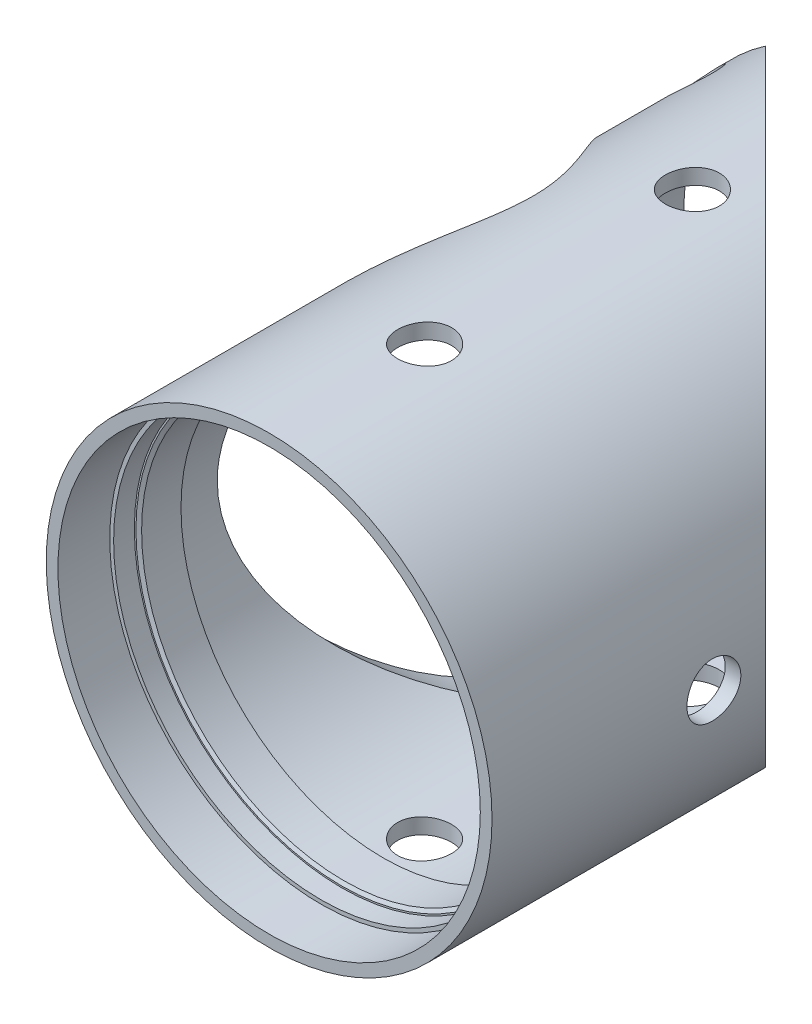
ISO-10303-21;
HEADER;
FILE_DESCRIPTION(('STEP AP214'),'2;1');
FILE_NAME('part.step','',(''),(''),'','','');
FILE_SCHEMA(('AUTOMOTIVE_DESIGN { 1 0 10303 214 1 1 1 1 }'));
ENDSEC;
DATA;
#1=APPLICATION_CONTEXT('core data for automotive mechanical design processes');
#2=APPLICATION_PROTOCOL_DEFINITION('international standard','automotive_design',2000,#1);
#3=PRODUCT_CONTEXT('',#1,'mechanical');
#4=PRODUCT('Part','Part','',(#3));
#5=PRODUCT_RELATED_PRODUCT_CATEGORY('part','',(#4));
#6=PRODUCT_DEFINITION_FORMATION('','',#4);
#7=PRODUCT_DEFINITION_CONTEXT('part definition',#1,'design');
#8=PRODUCT_DEFINITION('design','',#6,#7);
#9=PRODUCT_DEFINITION_SHAPE('','',#8);
#10=(LENGTH_UNIT() NAMED_UNIT(*) SI_UNIT(.MILLI.,.METRE.));
#11=(NAMED_UNIT(*) PLANE_ANGLE_UNIT() SI_UNIT($,.RADIAN.));
#12=(NAMED_UNIT(*) SI_UNIT($,.STERADIAN.) SOLID_ANGLE_UNIT());
#13=UNCERTAINTY_MEASURE_WITH_UNIT(LENGTH_MEASURE(1.E-05),#10,'distance_accuracy_value','');
#14=(GEOMETRIC_REPRESENTATION_CONTEXT(3) GLOBAL_UNCERTAINTY_ASSIGNED_CONTEXT((#13)) GLOBAL_UNIT_ASSIGNED_CONTEXT((#10,
#11,#12)) REPRESENTATION_CONTEXT('',''));
#15=CARTESIAN_POINT('',(0.,0.,0.));
#16=DIRECTION('',(0.,0.,1.));
#17=DIRECTION('',(1.,0.,0.));
#18=AXIS2_PLACEMENT_3D('',#15,#16,#17);
#19=CARTESIAN_POINT('',(0.,0.,76.2));
#20=DIRECTION('',(0.,0.,-1.));
#21=DIRECTION('',(-1.,0.,0.));
#22=AXIS2_PLACEMENT_3D('',#19,#20,#21);
#23=CYLINDRICAL_SURFACE('',#22,27.305);
#24=CARTESIAN_POINT('',(0.,-27.305,60.452));
#25=CARTESIAN_POINT('',(0.18475133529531,-27.3049974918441,60.4519921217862));
#26=CARTESIAN_POINT('',(0.369619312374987,-27.303105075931,60.4364421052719));
#27=CARTESIAN_POINT('',(0.734214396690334,-27.2957378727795,60.3746535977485));
#28=CARTESIAN_POINT('',(0.913935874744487,-27.2902593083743,60.3283827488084));
#29=CARTESIAN_POINT('',(1.26290665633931,-27.2763372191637,60.2065328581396));
#30=CARTESIAN_POINT('',(1.43216279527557,-27.267895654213,60.1309731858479));
#31=CARTESIAN_POINT('',(1.75555889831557,-27.2489873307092,59.9527320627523));
#32=CARTESIAN_POINT('',(1.90970152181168,-27.2385209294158,59.8500553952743));
#33=CARTESIAN_POINT('',(2.19932454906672,-27.2166717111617,59.6199273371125));
#34=CARTESIAN_POINT('',(2.33471563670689,-27.2052848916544,59.4923639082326));
#35=CARTESIAN_POINT('',(2.58222336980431,-27.1829106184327,59.2163237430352));
#36=CARTESIAN_POINT('',(2.69433884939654,-27.1719231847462,59.0678459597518));
#37=CARTESIAN_POINT('',(2.89244291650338,-27.15155212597,58.7536147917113));
#38=CARTESIAN_POINT('',(2.97834828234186,-27.142173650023,58.5878085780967));
#39=CARTESIAN_POINT('',(3.12106213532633,-27.1261347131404,58.2439908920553));
#40=CARTESIAN_POINT('',(3.17787165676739,-27.1194741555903,58.065979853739));
#41=CARTESIAN_POINT('',(3.26051084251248,-27.1096631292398,57.7037301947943));
#42=CARTESIAN_POINT('',(3.28649091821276,-27.1064956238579,57.5195263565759));
#43=CARTESIAN_POINT('',(3.30719907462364,-27.1039770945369,57.1493479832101));
#44=CARTESIAN_POINT('',(3.30192833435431,-27.1046259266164,56.9633735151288));
#45=CARTESIAN_POINT('',(3.26040803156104,-27.1096511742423,56.5959792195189));
#46=CARTESIAN_POINT('',(3.22432389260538,-27.114007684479,56.414540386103));
#47=CARTESIAN_POINT('',(3.12245906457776,-27.1259263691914,56.0603124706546));
#48=CARTESIAN_POINT('',(3.0566778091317,-27.1334886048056,55.8875235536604));
#49=CARTESIAN_POINT('',(2.89710738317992,-27.150989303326,55.5549848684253));
#50=CARTESIAN_POINT('',(2.8032460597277,-27.1609338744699,55.3952700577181));
#51=CARTESIAN_POINT('',(2.59023153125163,-27.1820739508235,55.0937962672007));
#52=CARTESIAN_POINT('',(2.47107724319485,-27.1932695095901,54.952038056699));
#53=CARTESIAN_POINT('',(2.20994108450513,-27.2157386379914,54.6895410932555));
#54=CARTESIAN_POINT('',(2.06781657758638,-27.2270122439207,54.5689441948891));
#55=CARTESIAN_POINT('',(1.76526622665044,-27.2482993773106,54.3532967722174));
#56=CARTESIAN_POINT('',(1.60484034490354,-27.2583129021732,54.2582463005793));
#57=CARTESIAN_POINT('',(1.27013372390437,-27.2759572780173,54.0963907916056));
#58=CARTESIAN_POINT('',(1.09584879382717,-27.2835874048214,54.0295943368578));
#59=CARTESIAN_POINT('',(0.738423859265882,-27.2955985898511,53.9262540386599));
#60=CARTESIAN_POINT('',(0.555284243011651,-27.2999797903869,53.8897088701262));
#61=CARTESIAN_POINT('',(0.186575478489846,-27.3049810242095,53.8480916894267));
#62=CARTESIAN_POINT('',(0.00102869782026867,-27.3056244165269,53.8428242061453));
#63=CARTESIAN_POINT('',(-0.368303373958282,-27.3031405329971,53.8633965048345));
#64=CARTESIAN_POINT('',(-0.55208870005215,-27.3000133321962,53.8892356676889));
#65=CARTESIAN_POINT('',(-0.912106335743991,-27.2903542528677,53.9711254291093));
#66=CARTESIAN_POINT('',(-1.08836008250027,-27.2838328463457,54.0270831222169));
#67=CARTESIAN_POINT('',(-1.42898126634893,-27.2681157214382,54.1675251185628));
#68=CARTESIAN_POINT('',(-1.59334832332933,-27.2589199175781,54.2520103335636));
#69=CARTESIAN_POINT('',(-1.90640526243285,-27.2388215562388,54.4475841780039));
#70=CARTESIAN_POINT('',(-2.05501540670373,-27.2279109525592,54.5587996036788));
#71=CARTESIAN_POINT('',(-2.33152949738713,-27.2056294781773,54.8044970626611));
#72=CARTESIAN_POINT('',(-2.45943267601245,-27.194258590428,54.9389799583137));
#73=CARTESIAN_POINT('',(-2.69159304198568,-27.1722663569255,55.228254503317));
#74=CARTESIAN_POINT('',(-2.79572087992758,-27.1616493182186,55.3831503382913));
#75=CARTESIAN_POINT('',(-2.97648194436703,-27.1424368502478,55.7083468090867));
#76=CARTESIAN_POINT('',(-3.05311569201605,-27.133841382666,55.8786471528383));
#77=CARTESIAN_POINT('',(-3.17650253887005,-27.1196742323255,56.2293964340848));
#78=CARTESIAN_POINT('',(-3.22332928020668,-27.1140951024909,56.4098191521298));
#79=CARTESIAN_POINT('',(-3.28601036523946,-27.1065706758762,56.7760384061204));
#80=CARTESIAN_POINT('',(-3.30186605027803,-27.1046252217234,56.9618347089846));
#81=CARTESIAN_POINT('',(-3.30213139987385,-27.1045927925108,57.3322404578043));
#82=CARTESIAN_POINT('',(-3.28674426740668,-27.1064808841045,57.5168497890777));
#83=CARTESIAN_POINT('',(-3.22539031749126,-27.113849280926,57.8808383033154));
#84=CARTESIAN_POINT('',(-3.17942349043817,-27.119329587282,58.060217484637));
#85=CARTESIAN_POINT('',(-3.05827723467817,-27.1332573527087,58.4086314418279));
#86=CARTESIAN_POINT('',(-2.98310693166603,-27.1417038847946,58.5776694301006));
#87=CARTESIAN_POINT('',(-2.80570760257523,-27.1606139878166,58.9007645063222));
#88=CARTESIAN_POINT('',(-2.70347832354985,-27.1710775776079,59.0548214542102));
#89=CARTESIAN_POINT('',(-2.4741071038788,-27.1929243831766,59.3446207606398));
#90=CARTESIAN_POINT('',(-2.34681365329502,-27.2043129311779,59.480242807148));
#91=CARTESIAN_POINT('',(-2.0712417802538,-27.2266790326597,59.7282806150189));
#92=CARTESIAN_POINT('',(-1.92295840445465,-27.2376564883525,59.8406908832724));
#93=CARTESIAN_POINT('',(-1.60901291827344,-27.2580064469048,60.0394520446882));
#94=CARTESIAN_POINT('',(-1.44329070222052,-27.2673730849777,60.125708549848));
#95=CARTESIAN_POINT('',(-1.09969530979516,-27.2833860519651,60.2690464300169));
#96=CARTESIAN_POINT('',(-0.921835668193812,-27.2900353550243,60.3261597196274));
#97=CARTESIAN_POINT('',(-0.619199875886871,-27.2982494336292,60.3958168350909));
#98=CARTESIAN_POINT('',(-0.496337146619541,-27.300768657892,60.4168555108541));
#99=CARTESIAN_POINT('',(-0.24900060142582,-27.304144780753,60.4449497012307));
#100=CARTESIAN_POINT('',(-0.124526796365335,-27.3050016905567,60.4520053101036));
#101=CARTESIAN_POINT('',(0.,-27.305,60.452));
#102=B_SPLINE_CURVE_WITH_KNOTS('',3,(#24,#25,#26,#27,#28,#29,#30,#31,#32,#33,#34,#35,#36,#37,
#38,#39,#40,#41,#42,#43,#44,#45,#46,#47,#48,#49,#50,#51,#52,#53,#54,#55,#56,#57,#58,#59,#60,#61,
#62,#63,#64,#65,#66,#67,#68,#69,#70,#71,#72,#73,#74,#75,#76,#77,#78,#79,#80,#81,#82,#83,#84,#85,
#86,#87,#88,#89,#90,#91,#92,#93,#94,#95,#96,#97,#98,#99,#100,#101),.UNSPECIFIED.,.T.,.F.,(4,2,2,
2,2,2,2,2,2,2,2,2,2,2,2,2,2,2,2,2,2,2,2,2,2,2,2,2,2,2,2,2,2,2,2,2,2,2,4),(0.,0.553799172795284,
1.10818258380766,1.66219999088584,2.21611973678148,2.77259325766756,3.32909464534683,
3.88734506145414,4.44557563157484,5.00107134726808,5.55654610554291,6.10905737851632,
6.66157918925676,7.21553310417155,7.76951074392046,8.32707079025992,8.88463198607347,
9.44236242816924,10.0000684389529,10.5542853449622,11.1084912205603,11.6609972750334,
12.2135209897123,12.7687192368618,13.3239380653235,13.8821091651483,14.4402696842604,
14.9970457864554,15.5537977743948,16.1069402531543,16.6600829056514,17.2130528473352,
17.7660279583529,18.3224544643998,18.8790124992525,19.4375558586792,19.9954862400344,
20.3687625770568,20.7420363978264),.UNSPECIFIED.);
#103=CARTESIAN_POINT('',(0.,-27.305,60.452));
#104=VERTEX_POINT('',#103);
#105=EDGE_CURVE('E161',#104,#104,#102,.T.);
#106=ORIENTED_EDGE('',*,*,#105,.T.);
#107=EDGE_LOOP('',(#106));
#108=FACE_BOUND('',#107,.T.);
#109=CARTESIAN_POINT('',(0.,27.305,60.452));
#110=CARTESIAN_POINT('',(-0.18475133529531,27.3049974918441,60.4519921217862));
#111=CARTESIAN_POINT('',(-0.369619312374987,27.303105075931,60.4364421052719));
#112=CARTESIAN_POINT('',(-0.734214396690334,27.2957378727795,60.3746535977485));
#113=CARTESIAN_POINT('',(-0.913935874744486,27.2902593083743,60.3283827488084));
#114=CARTESIAN_POINT('',(-1.26290665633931,27.2763372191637,60.2065328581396));
#115=CARTESIAN_POINT('',(-1.43216279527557,27.267895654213,60.1309731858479));
#116=CARTESIAN_POINT('',(-1.75555889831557,27.2489873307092,59.9527320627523));
#117=CARTESIAN_POINT('',(-1.90970152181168,27.2385209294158,59.8500553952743));
#118=CARTESIAN_POINT('',(-2.19932454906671,27.2166717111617,59.6199273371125));
#119=CARTESIAN_POINT('',(-2.33471563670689,27.2052848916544,59.4923639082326));
#120=CARTESIAN_POINT('',(-2.5822233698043,27.1829106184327,59.2163237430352));
#121=CARTESIAN_POINT('',(-2.69433884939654,27.1719231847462,59.0678459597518));
#122=CARTESIAN_POINT('',(-2.89244291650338,27.15155212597,58.7536147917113));
#123=CARTESIAN_POINT('',(-2.97834828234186,27.142173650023,58.5878085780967));
#124=CARTESIAN_POINT('',(-3.12106213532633,27.1261347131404,58.2439908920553));
#125=CARTESIAN_POINT('',(-3.17787165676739,27.1194741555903,58.065979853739));
#126=CARTESIAN_POINT('',(-3.26051084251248,27.1096631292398,57.7037301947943));
#127=CARTESIAN_POINT('',(-3.28649091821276,27.1064956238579,57.5195263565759));
#128=CARTESIAN_POINT('',(-3.30719907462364,27.1039770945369,57.1493479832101));
#129=CARTESIAN_POINT('',(-3.30192833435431,27.1046259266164,56.9633735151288));
#130=CARTESIAN_POINT('',(-3.26040803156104,27.1096511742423,56.5959792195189));
#131=CARTESIAN_POINT('',(-3.22432389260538,27.114007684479,56.414540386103));
#132=CARTESIAN_POINT('',(-3.12245906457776,27.1259263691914,56.0603124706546));
#133=CARTESIAN_POINT('',(-3.0566778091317,27.1334886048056,55.8875235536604));
#134=CARTESIAN_POINT('',(-2.89710738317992,27.150989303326,55.5549848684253));
#135=CARTESIAN_POINT('',(-2.80324605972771,27.1609338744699,55.3952700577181));
#136=CARTESIAN_POINT('',(-2.59023153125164,27.1820739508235,55.0937962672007));
#137=CARTESIAN_POINT('',(-2.47107724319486,27.1932695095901,54.952038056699));
#138=CARTESIAN_POINT('',(-2.20994108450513,27.2157386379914,54.6895410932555));
#139=CARTESIAN_POINT('',(-2.06781657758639,27.2270122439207,54.5689441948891));
#140=CARTESIAN_POINT('',(-1.76526622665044,27.2482993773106,54.3532967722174));
#141=CARTESIAN_POINT('',(-1.60484034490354,27.2583129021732,54.2582463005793));
#142=CARTESIAN_POINT('',(-1.27013372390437,27.2759572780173,54.0963907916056));
#143=CARTESIAN_POINT('',(-1.09584879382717,27.2835874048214,54.0295943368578));
#144=CARTESIAN_POINT('',(-0.73842385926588,27.2955985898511,53.9262540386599));
#145=CARTESIAN_POINT('',(-0.555284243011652,27.2999797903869,53.8897088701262));
#146=CARTESIAN_POINT('',(-0.186575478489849,27.3049810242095,53.8480916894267));
#147=CARTESIAN_POINT('',(-0.00102869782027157,27.3056244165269,53.8428242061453));
#148=CARTESIAN_POINT('',(0.36830337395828,27.3031405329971,53.8633965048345));
#149=CARTESIAN_POINT('',(0.552088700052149,27.3000133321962,53.8892356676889));
#150=CARTESIAN_POINT('',(0.91210633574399,27.2903542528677,53.9711254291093));
#151=CARTESIAN_POINT('',(1.08836008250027,27.2838328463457,54.0270831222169));
#152=CARTESIAN_POINT('',(1.42898126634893,27.2681157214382,54.1675251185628));
#153=CARTESIAN_POINT('',(1.59334832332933,27.2589199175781,54.2520103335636));
#154=CARTESIAN_POINT('',(1.90640526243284,27.2388215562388,54.4475841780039));
#155=CARTESIAN_POINT('',(2.05501540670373,27.2279109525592,54.5587996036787));
#156=CARTESIAN_POINT('',(2.33152949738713,27.2056294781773,54.8044970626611));
#157=CARTESIAN_POINT('',(2.45943267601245,27.194258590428,54.9389799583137));
#158=CARTESIAN_POINT('',(2.69159304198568,27.1722663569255,55.228254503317));
#159=CARTESIAN_POINT('',(2.79572087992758,27.1616493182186,55.3831503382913));
#160=CARTESIAN_POINT('',(2.97648194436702,27.1424368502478,55.7083468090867));
#161=CARTESIAN_POINT('',(3.05311569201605,27.133841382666,55.8786471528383));
#162=CARTESIAN_POINT('',(3.17650253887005,27.1196742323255,56.2293964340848));
#163=CARTESIAN_POINT('',(3.22332928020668,27.1140951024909,56.4098191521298));
#164=CARTESIAN_POINT('',(3.28601036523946,27.1065706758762,56.7760384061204));
#165=CARTESIAN_POINT('',(3.30186605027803,27.1046252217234,56.9618347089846));
#166=CARTESIAN_POINT('',(3.30213139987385,27.1045927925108,57.3322404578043));
#167=CARTESIAN_POINT('',(3.28674426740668,27.1064808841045,57.5168497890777));
#168=CARTESIAN_POINT('',(3.22539031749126,27.113849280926,57.8808383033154));
#169=CARTESIAN_POINT('',(3.17942349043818,27.119329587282,58.060217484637));
#170=CARTESIAN_POINT('',(3.05827723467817,27.1332573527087,58.4086314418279));
#171=CARTESIAN_POINT('',(2.98310693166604,27.1417038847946,58.5776694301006));
#172=CARTESIAN_POINT('',(2.80570760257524,27.1606139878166,58.9007645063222));
#173=CARTESIAN_POINT('',(2.70347832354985,27.1710775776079,59.0548214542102));
#174=CARTESIAN_POINT('',(2.4741071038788,27.1929243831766,59.3446207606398));
#175=CARTESIAN_POINT('',(2.34681365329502,27.2043129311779,59.480242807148));
#176=CARTESIAN_POINT('',(2.07124178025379,27.2266790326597,59.7282806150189));
#177=CARTESIAN_POINT('',(1.92295840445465,27.2376564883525,59.8406908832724));
#178=CARTESIAN_POINT('',(1.60901291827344,27.2580064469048,60.0394520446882));
#179=CARTESIAN_POINT('',(1.44329070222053,27.2673730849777,60.125708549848));
#180=CARTESIAN_POINT('',(1.09969530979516,27.2833860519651,60.2690464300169));
#181=CARTESIAN_POINT('',(0.921835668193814,27.2900353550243,60.3261597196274));
#182=CARTESIAN_POINT('',(0.619199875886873,27.2982494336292,60.3958168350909));
#183=CARTESIAN_POINT('',(0.496337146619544,27.300768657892,60.4168555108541));
#184=CARTESIAN_POINT('',(0.249000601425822,27.304144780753,60.4449497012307));
#185=CARTESIAN_POINT('',(0.124526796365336,27.3050016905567,60.4520053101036));
#186=CARTESIAN_POINT('',(0.,27.305,60.452));
#187=B_SPLINE_CURVE_WITH_KNOTS('',3,(#109,#110,#111,#112,#113,#114,#115,#116,#117,#118,#119,
#120,#121,#122,#123,#124,#125,#126,#127,#128,#129,#130,#131,#132,#133,#134,#135,#136,#137,#138,
#139,#140,#141,#142,#143,#144,#145,#146,#147,#148,#149,#150,#151,#152,#153,#154,#155,#156,#157,
#158,#159,#160,#161,#162,#163,#164,#165,#166,#167,#168,#169,#170,#171,#172,#173,#174,#175,#176,
#177,#178,#179,#180,#181,#182,#183,#184,#185,#186),.UNSPECIFIED.,.T.,.F.,(4,2,2,2,2,2,2,2,2,2,2,
2,2,2,2,2,2,2,2,2,2,2,2,2,2,2,2,2,2,2,2,2,2,2,2,2,2,2,4),(0.,0.553799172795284,1.10818258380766,
1.66219999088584,2.21611973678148,2.77259325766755,3.32909464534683,3.88734506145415,
4.44557563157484,5.00107134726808,5.55654610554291,6.10905737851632,6.66157918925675,
7.21553310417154,7.76951074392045,8.32707079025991,8.88463198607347,9.44236242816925,
10.0000684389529,10.5542853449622,11.1084912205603,11.6609972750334,12.2135209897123,
12.7687192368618,13.3239380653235,13.8821091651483,14.4402696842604,14.9970457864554,
15.5537977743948,16.1069402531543,16.6600829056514,17.2130528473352,17.7660279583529,
18.3224544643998,18.8790124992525,19.4375558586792,19.9954862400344,20.3687625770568,
20.7420363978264),.UNSPECIFIED.);
#188=CARTESIAN_POINT('',(0.,27.305,60.452));
#189=VERTEX_POINT('',#188);
#190=EDGE_CURVE('E156',#189,#189,#187,.T.);
#191=ORIENTED_EDGE('',*,*,#190,.T.);
#192=EDGE_LOOP('',(#191));
#193=FACE_BOUND('',#192,.T.);
#194=CARTESIAN_POINT('',(-21.5007193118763,16.8309861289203,5.08));
#195=CARTESIAN_POINT('',(-21.5007155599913,16.8309935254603,5.26474576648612));
#196=CARTESIAN_POINT('',(-21.4910688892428,16.8433366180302,5.44960819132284));
#197=CARTESIAN_POINT('',(-21.4526259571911,16.8922702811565,5.81419174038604));
#198=CARTESIAN_POINT('',(-21.4238094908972,16.9288864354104,5.99390723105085));
#199=CARTESIAN_POINT('',(-21.3475553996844,17.0249417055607,6.34286534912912));
#200=CARTESIAN_POINT('',(-21.3001301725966,17.0843656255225,6.51211486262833));
#201=CARTESIAN_POINT('',(-21.1875264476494,17.2238132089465,6.83549985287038));
#202=CARTESIAN_POINT('',(-21.1223510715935,17.3038332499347,6.989637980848));
#203=CARTESIAN_POINT('',(-20.9751069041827,17.4820278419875,7.27926603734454));
#204=CARTESIAN_POINT('',(-20.8929604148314,17.58028567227,7.41466523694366));
#205=CARTESIAN_POINT('',(-20.7135748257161,17.791289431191,7.66218863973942));
#206=CARTESIAN_POINT('',(-20.616334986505,17.9040360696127,7.77431170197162));
#207=CARTESIAN_POINT('',(-20.4084961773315,18.1405935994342,7.97242373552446));
#208=CARTESIAN_POINT('',(-20.2978568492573,18.2644376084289,8.05833086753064));
#209=CARTESIAN_POINT('',(-20.0660259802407,18.5188339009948,8.20104838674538));
#210=CARTESIAN_POINT('',(-19.9448348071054,18.649385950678,8.25785978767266));
#211=CARTESIAN_POINT('',(-19.6955813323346,18.9124232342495,8.34050284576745));
#212=CARTESIAN_POINT('',(-19.5675556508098,19.0448958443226,8.36648509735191));
#213=CARTESIAN_POINT('',(-19.307573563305,19.3084146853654,8.38719889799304));
#214=CARTESIAN_POINT('',(-19.1756173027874,19.4394609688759,8.38193160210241));
#215=CARTESIAN_POINT('',(-18.9122920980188,19.6957310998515,8.34041678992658));
#216=CARTESIAN_POINT('',(-18.7809236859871,19.8209817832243,8.30433122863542));
#217=CARTESIAN_POINT('',(-18.522045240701,20.0631078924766,8.20245723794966));
#218=CARTESIAN_POINT('',(-18.394535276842,20.1799831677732,8.13666827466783));
#219=CARTESIAN_POINT('',(-18.1470605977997,20.4028194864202,7.97708181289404));
#220=CARTESIAN_POINT('',(-18.0271157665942,20.5087521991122,7.88321394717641));
#221=CARTESIAN_POINT('',(-17.7990245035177,20.7070187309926,7.67018541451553));
#222=CARTESIAN_POINT('',(-17.6908785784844,20.799351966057,7.55102366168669));
#223=CARTESIAN_POINT('',(-17.4893836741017,20.9690721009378,7.28988216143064));
#224=CARTESIAN_POINT('',(-17.3961337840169,21.0463596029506,7.1477613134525));
#225=CARTESIAN_POINT('',(-17.2285717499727,21.1837465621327,6.84522141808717));
#226=CARTESIAN_POINT('',(-17.1542596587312,21.2438459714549,6.68480231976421));
#227=CARTESIAN_POINT('',(-17.027280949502,21.3457581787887,6.3500976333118));
#228=CARTESIAN_POINT('',(-16.9746225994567,21.3875639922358,6.17580677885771));
#229=CARTESIAN_POINT('',(-16.8930054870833,21.4520889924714,5.81836895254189));
#230=CARTESIAN_POINT('',(-16.8640456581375,21.474809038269,5.63522237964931));
#231=CARTESIAN_POINT('',(-16.8310619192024,21.5006703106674,5.26651022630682));
#232=CARTESIAN_POINT('',(-16.8268816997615,21.5039342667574,5.08096722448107));
#233=CARTESIAN_POINT('',(-16.8432025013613,21.4911530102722,4.71164358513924));
#234=CARTESIAN_POINT('',(-16.8637030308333,21.4751081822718,4.52786291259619));
#235=CARTESIAN_POINT('',(-16.9284829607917,21.4240790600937,4.16786920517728));
#236=CARTESIAN_POINT('',(-16.9726874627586,21.3891544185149,3.9916342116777));
#237=CARTESIAN_POINT('',(-17.0831541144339,21.3010289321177,3.65104835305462));
#238=CARTESIAN_POINT('',(-17.1494169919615,21.2478274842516,3.48669788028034));
#239=CARTESIAN_POINT('',(-17.3019534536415,21.1238042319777,3.17365248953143));
#240=CARTESIAN_POINT('',(-17.3883244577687,21.0528965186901,3.0250390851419));
#241=CARTESIAN_POINT('',(-17.5778256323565,20.894933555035,2.74851721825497));
#242=CARTESIAN_POINT('',(-17.680956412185,20.8078777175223,2.62060950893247));
#243=CARTESIAN_POINT('',(-17.9010323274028,20.6188549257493,2.38843899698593));
#244=CARTESIAN_POINT('',(-18.0180480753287,20.5168110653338,2.28430568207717));
#245=CARTESIAN_POINT('',(-18.261534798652,20.3003907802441,2.10353501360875));
#246=CARTESIAN_POINT('',(-18.3880055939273,20.1860145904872,2.02689713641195));
#247=CARTESIAN_POINT('',(-18.6459816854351,19.9479596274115,1.90350763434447));
#248=CARTESIAN_POINT('',(-18.7774733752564,19.8243052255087,1.85668057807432));
#249=CARTESIAN_POINT('',(-19.0417027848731,19.5706438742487,1.79399642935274));
#250=CARTESIAN_POINT('',(-19.1744404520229,19.4406371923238,1.77813803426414));
#251=CARTESIAN_POINT('',(-19.4363834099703,19.1787411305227,1.77786463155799));
#252=CARTESIAN_POINT('',(-19.5656058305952,19.0468690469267,1.79324972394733));
#253=CARTESIAN_POINT('',(-19.8178282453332,18.7842982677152,1.85460393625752));
#254=CARTESIAN_POINT('',(-19.940828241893,18.6535995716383,1.90057304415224));
#255=CARTESIAN_POINT('',(-20.1774202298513,18.3974225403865,2.02172888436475));
#256=CARTESIAN_POINT('',(-20.2910150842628,18.2719426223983,2.09690668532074));
#257=CARTESIAN_POINT('',(-20.5061744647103,18.0301430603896,2.27432517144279));
#258=CARTESIAN_POINT('',(-20.607738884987,17.9138234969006,2.37656609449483));
#259=CARTESIAN_POINT('',(-20.797235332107,17.693482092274,2.6059502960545));
#260=CARTESIAN_POINT('',(-20.885079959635,17.589540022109,2.73324240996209));
#261=CARTESIAN_POINT('',(-21.0446309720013,17.3983356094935,3.00880814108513));
#262=CARTESIAN_POINT('',(-21.1163335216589,17.3110772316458,3.15708673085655));
#263=CARTESIAN_POINT('',(-21.2424382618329,17.1561035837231,3.47102814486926));
#264=CARTESIAN_POINT('',(-21.2967769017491,17.0884601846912,3.63675194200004));
#265=CARTESIAN_POINT('',(-21.3867475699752,16.9757268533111,3.98035065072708));
#266=CARTESIAN_POINT('',(-21.4224000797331,16.93061223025,4.15821201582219));
#267=CARTESIAN_POINT('',(-21.4658042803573,16.8755153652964,4.46084167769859));
#268=CARTESIAN_POINT('',(-21.4788850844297,16.8588470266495,4.58369610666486));
#269=CARTESIAN_POINT('',(-21.4963438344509,16.8365799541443,4.83101603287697));
#270=CARTESIAN_POINT('',(-21.5007218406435,16.830981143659,4.95548151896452));
#271=CARTESIAN_POINT('',(-21.5007193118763,16.8309861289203,5.08));
#272=B_SPLINE_CURVE_WITH_KNOTS('',3,(#194,#195,#196,#197,#198,#199,#200,#201,#202,#203,#204,
#205,#206,#207,#208,#209,#210,#211,#212,#213,#214,#215,#216,#217,#218,#219,#220,#221,#222,#223,
#224,#225,#226,#227,#228,#229,#230,#231,#232,#233,#234,#235,#236,#237,#238,#239,#240,#241,#242,
#243,#244,#245,#246,#247,#248,#249,#250,#251,#252,#253,#254,#255,#256,#257,#258,#259,#260,#261,
#262,#263,#264,#265,#266,#267,#268,#269,#270,#271),.UNSPECIFIED.,.T.,.F.,(4,2,2,2,2,2,2,2,2,2,2,
2,2,2,2,2,2,2,2,2,2,2,2,2,2,2,2,2,2,2,2,2,2,2,2,2,2,2,4),(0.,0.553782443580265,1.10814950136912,
1.66214784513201,2.21604881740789,2.77254423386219,3.32906692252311,3.88730956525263,
4.4455327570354,5.00101776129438,5.55648223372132,6.10904548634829,6.66161867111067,
7.21558840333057,7.76958192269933,8.32711960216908,8.88465883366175,9.44241075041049,
10.0001375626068,10.5543424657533,11.1085363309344,11.6609893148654,12.2134605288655,
12.768666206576,13.3238920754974,13.8820734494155,14.4402441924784,14.9969969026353,
15.553726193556,16.1069046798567,16.6600829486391,17.2130922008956,17.7661063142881,
18.3225110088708,18.8790477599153,19.4375986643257,19.9955360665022,20.3687875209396,
20.7420363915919),.UNSPECIFIED.);
#273=CARTESIAN_POINT('',(-21.5007193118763,16.8309861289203,5.08));
#274=VERTEX_POINT('',#273);
#275=EDGE_CURVE('E312',#274,#274,#272,.T.);
#276=ORIENTED_EDGE('',*,*,#275,.F.);
#277=EDGE_LOOP('',(#276));
#278=FACE_BOUND('',#277,.T.);
#279=CARTESIAN_POINT('',(0.,-27.305,27.6492561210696));
#280=CARTESIAN_POINT('',(0.18475133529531,-27.3049974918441,27.6492482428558));
#281=CARTESIAN_POINT('',(0.369619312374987,-27.303105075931,27.6336982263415));
#282=CARTESIAN_POINT('',(0.734214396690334,-27.2957378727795,27.5719097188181));
#283=CARTESIAN_POINT('',(0.913935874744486,-27.2902593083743,27.525638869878));
#284=CARTESIAN_POINT('',(1.26290665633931,-27.2763372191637,27.4037889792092));
#285=CARTESIAN_POINT('',(1.43216279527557,-27.267895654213,27.3282293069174));
#286=CARTESIAN_POINT('',(1.75555889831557,-27.2489873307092,27.1499881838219));
#287=CARTESIAN_POINT('',(1.90970152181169,-27.2385209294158,27.0473115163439));
#288=CARTESIAN_POINT('',(2.19932454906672,-27.2166717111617,26.817183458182));
#289=CARTESIAN_POINT('',(2.33471563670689,-27.2052848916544,26.6896200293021));
#290=CARTESIAN_POINT('',(2.58222336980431,-27.1829106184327,26.4135798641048));
#291=CARTESIAN_POINT('',(2.69433884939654,-27.1719231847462,26.2651020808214));
#292=CARTESIAN_POINT('',(2.89244291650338,-27.15155212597,25.9508709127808));
#293=CARTESIAN_POINT('',(2.97834828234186,-27.142173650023,25.7850646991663));
#294=CARTESIAN_POINT('',(3.12106213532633,-27.1261347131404,25.4412470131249));
#295=CARTESIAN_POINT('',(3.17787165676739,-27.1194741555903,25.2632359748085));
#296=CARTESIAN_POINT('',(3.26051084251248,-27.1096631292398,24.9009863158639));
#297=CARTESIAN_POINT('',(3.28649091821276,-27.1064956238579,24.7167824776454));
#298=CARTESIAN_POINT('',(3.30719907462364,-27.1039770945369,24.3466041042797));
#299=CARTESIAN_POINT('',(3.30192833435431,-27.1046259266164,24.1606296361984));
#300=CARTESIAN_POINT('',(3.26040803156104,-27.1096511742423,23.7932353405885));
#301=CARTESIAN_POINT('',(3.22432389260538,-27.114007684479,23.6117965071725));
#302=CARTESIAN_POINT('',(3.12245906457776,-27.1259263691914,23.2575685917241));
#303=CARTESIAN_POINT('',(3.0566778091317,-27.1334886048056,23.0847796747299));
#304=CARTESIAN_POINT('',(2.89710738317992,-27.150989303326,22.7522409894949));
#305=CARTESIAN_POINT('',(2.80324605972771,-27.1609338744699,22.5925261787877));
#306=CARTESIAN_POINT('',(2.59023153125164,-27.1820739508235,22.2910523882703));
#307=CARTESIAN_POINT('',(2.47107724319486,-27.1932695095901,22.1492941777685));
#308=CARTESIAN_POINT('',(2.20994108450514,-27.2157386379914,21.886797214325));
#309=CARTESIAN_POINT('',(2.06781657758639,-27.2270122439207,21.7662003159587));
#310=CARTESIAN_POINT('',(1.76526622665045,-27.2482993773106,21.550552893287));
#311=CARTESIAN_POINT('',(1.60484034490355,-27.2583129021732,21.4555024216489));
#312=CARTESIAN_POINT('',(1.27013372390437,-27.2759572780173,21.2936469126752));
#313=CARTESIAN_POINT('',(1.09584879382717,-27.2835874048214,21.2268504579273));
#314=CARTESIAN_POINT('',(0.738423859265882,-27.2955985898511,21.1235101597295));
#315=CARTESIAN_POINT('',(0.555284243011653,-27.2999797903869,21.0869649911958));
#316=CARTESIAN_POINT('',(0.186575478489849,-27.3049810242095,21.0453478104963));
#317=CARTESIAN_POINT('',(0.00102869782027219,-27.3056244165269,21.0400803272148));
#318=CARTESIAN_POINT('',(-0.368303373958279,-27.3031405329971,21.0606526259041));
#319=CARTESIAN_POINT('',(-0.552088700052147,-27.3000133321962,21.0864917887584));
#320=CARTESIAN_POINT('',(-0.912106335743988,-27.2903542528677,21.1683815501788));
#321=CARTESIAN_POINT('',(-1.08836008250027,-27.2838328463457,21.2243392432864));
#322=CARTESIAN_POINT('',(-1.42898126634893,-27.2681157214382,21.3647812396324));
#323=CARTESIAN_POINT('',(-1.59334832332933,-27.2589199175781,21.4492664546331));
#324=CARTESIAN_POINT('',(-1.90640526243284,-27.2388215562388,21.6448402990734));
#325=CARTESIAN_POINT('',(-2.05501540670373,-27.2279109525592,21.7560557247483));
#326=CARTESIAN_POINT('',(-2.33152949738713,-27.2056294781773,22.0017531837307));
#327=CARTESIAN_POINT('',(-2.45943267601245,-27.194258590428,22.1362360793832));
#328=CARTESIAN_POINT('',(-2.69159304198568,-27.1722663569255,22.4255106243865));
#329=CARTESIAN_POINT('',(-2.79572087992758,-27.1616493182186,22.5804064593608));
#330=CARTESIAN_POINT('',(-2.97648194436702,-27.1424368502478,22.9056029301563));
#331=CARTESIAN_POINT('',(-3.05311569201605,-27.133841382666,23.0759032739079));
#332=CARTESIAN_POINT('',(-3.17650253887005,-27.1196742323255,23.4266525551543));
#333=CARTESIAN_POINT('',(-3.22332928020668,-27.1140951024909,23.6070752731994));
#334=CARTESIAN_POINT('',(-3.28601036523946,-27.1065706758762,23.9732945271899));
#335=CARTESIAN_POINT('',(-3.30186605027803,-27.1046252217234,24.1590908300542));
#336=CARTESIAN_POINT('',(-3.30213139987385,-27.1045927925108,24.5294965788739));
#337=CARTESIAN_POINT('',(-3.28674426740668,-27.1064808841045,24.7141059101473));
#338=CARTESIAN_POINT('',(-3.22539031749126,-27.113849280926,25.078094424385));
#339=CARTESIAN_POINT('',(-3.17942349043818,-27.119329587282,25.2574736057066));
#340=CARTESIAN_POINT('',(-3.05827723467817,-27.1332573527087,25.6058875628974));
#341=CARTESIAN_POINT('',(-2.98310693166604,-27.1417038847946,25.7749255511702));
#342=CARTESIAN_POINT('',(-2.80570760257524,-27.1606139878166,26.0980206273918));
#343=CARTESIAN_POINT('',(-2.70347832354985,-27.1710775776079,26.2520775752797));
#344=CARTESIAN_POINT('',(-2.4741071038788,-27.1929243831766,26.5418768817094));
#345=CARTESIAN_POINT('',(-2.34681365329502,-27.2043129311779,26.6774989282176));
#346=CARTESIAN_POINT('',(-2.07124178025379,-27.2266790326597,26.9255367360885));
#347=CARTESIAN_POINT('',(-1.92295840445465,-27.2376564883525,27.037947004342));
#348=CARTESIAN_POINT('',(-1.60901291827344,-27.2580064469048,27.2367081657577));
#349=CARTESIAN_POINT('',(-1.44329070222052,-27.2673730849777,27.3229646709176));
#350=CARTESIAN_POINT('',(-1.09969530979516,-27.2833860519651,27.4663025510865));
#351=CARTESIAN_POINT('',(-0.921835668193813,-27.2900353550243,27.523415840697));
#352=CARTESIAN_POINT('',(-0.619199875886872,-27.2982494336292,27.5930729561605));
#353=CARTESIAN_POINT('',(-0.496337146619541,-27.300768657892,27.6141116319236));
#354=CARTESIAN_POINT('',(-0.24900060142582,-27.304144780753,27.6422058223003));
#355=CARTESIAN_POINT('',(-0.124526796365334,-27.3050016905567,27.6492614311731));
#356=CARTESIAN_POINT('',(0.,-27.305,27.6492561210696));
#357=B_SPLINE_CURVE_WITH_KNOTS('',3,(#279,#280,#281,#282,#283,#284,#285,#286,#287,#288,#289,
#290,#291,#292,#293,#294,#295,#296,#297,#298,#299,#300,#301,#302,#303,#304,#305,#306,#307,#308,
#309,#310,#311,#312,#313,#314,#315,#316,#317,#318,#319,#320,#321,#322,#323,#324,#325,#326,#327,
#328,#329,#330,#331,#332,#333,#334,#335,#336,#337,#338,#339,#340,#341,#342,#343,#344,#345,#346,
#347,#348,#349,#350,#351,#352,#353,#354,#355,#356),.UNSPECIFIED.,.T.,.F.,(4,2,2,2,2,2,2,2,2,2,2,
2,2,2,2,2,2,2,2,2,2,2,2,2,2,2,2,2,2,2,2,2,2,2,2,2,2,2,4),(0.,0.553799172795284,1.10818258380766,
1.66219999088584,2.21611973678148,2.77259325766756,3.32909464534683,3.88734506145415,
4.44557563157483,5.00107134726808,5.5565461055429,6.10905737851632,6.66157918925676,
7.21553310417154,7.76951074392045,8.32707079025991,8.88463198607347,9.44236242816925,
10.0000684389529,10.5542853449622,11.1084912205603,11.6609972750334,12.2135209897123,
12.7687192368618,13.3239380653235,13.8821091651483,14.4402696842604,14.9970457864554,
15.5537977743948,16.1069402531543,16.6600829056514,17.2130528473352,17.7660279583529,
18.3224544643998,18.8790124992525,19.4375558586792,19.9954862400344,20.3687625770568,
20.7420363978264),.UNSPECIFIED.);
#358=CARTESIAN_POINT('',(0.,-27.305,27.6492561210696));
#359=VERTEX_POINT('',#358);
#360=EDGE_CURVE('E186',#359,#359,#357,.T.);
#361=ORIENTED_EDGE('',*,*,#360,.T.);
#362=EDGE_LOOP('',(#361));
#363=FACE_BOUND('',#362,.T.);
#364=CARTESIAN_POINT('',(0.,27.305,27.6492561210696));
#365=CARTESIAN_POINT('',(-0.18475133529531,27.3049974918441,27.6492482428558));
#366=CARTESIAN_POINT('',(-0.369619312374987,27.303105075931,27.6336982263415));
#367=CARTESIAN_POINT('',(-0.734214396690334,27.2957378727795,27.5719097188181));
#368=CARTESIAN_POINT('',(-0.913935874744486,27.2902593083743,27.525638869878));
#369=CARTESIAN_POINT('',(-1.26290665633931,27.2763372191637,27.4037889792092));
#370=CARTESIAN_POINT('',(-1.43216279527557,27.267895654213,27.3282293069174));
#371=CARTESIAN_POINT('',(-1.75555889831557,27.2489873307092,27.1499881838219));
#372=CARTESIAN_POINT('',(-1.90970152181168,27.2385209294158,27.0473115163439));
#373=CARTESIAN_POINT('',(-2.19932454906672,27.2166717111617,26.817183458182));
#374=CARTESIAN_POINT('',(-2.33471563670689,27.2052848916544,26.6896200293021));
#375=CARTESIAN_POINT('',(-2.58222336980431,27.1829106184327,26.4135798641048));
#376=CARTESIAN_POINT('',(-2.69433884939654,27.1719231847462,26.2651020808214));
#377=CARTESIAN_POINT('',(-2.89244291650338,27.15155212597,25.9508709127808));
#378=CARTESIAN_POINT('',(-2.97834828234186,27.142173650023,25.7850646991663));
#379=CARTESIAN_POINT('',(-3.12106213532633,27.1261347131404,25.4412470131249));
#380=CARTESIAN_POINT('',(-3.17787165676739,27.1194741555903,25.2632359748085));
#381=CARTESIAN_POINT('',(-3.26051084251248,27.1096631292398,24.9009863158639));
#382=CARTESIAN_POINT('',(-3.28649091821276,27.1064956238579,24.7167824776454));
#383=CARTESIAN_POINT('',(-3.30719907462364,27.1039770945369,24.3466041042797));
#384=CARTESIAN_POINT('',(-3.30192833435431,27.1046259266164,24.1606296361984));
#385=CARTESIAN_POINT('',(-3.26040803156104,27.1096511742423,23.7932353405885));
#386=CARTESIAN_POINT('',(-3.22432389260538,27.114007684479,23.6117965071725));
#387=CARTESIAN_POINT('',(-3.12245906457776,27.1259263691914,23.2575685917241));
#388=CARTESIAN_POINT('',(-3.0566778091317,27.1334886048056,23.0847796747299));
#389=CARTESIAN_POINT('',(-2.89710738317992,27.150989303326,22.7522409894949));
#390=CARTESIAN_POINT('',(-2.80324605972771,27.1609338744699,22.5925261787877));
#391=CARTESIAN_POINT('',(-2.59023153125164,27.1820739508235,22.2910523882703));
#392=CARTESIAN_POINT('',(-2.47107724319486,27.1932695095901,22.1492941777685));
#393=CARTESIAN_POINT('',(-2.20994108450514,27.2157386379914,21.886797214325));
#394=CARTESIAN_POINT('',(-2.06781657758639,27.2270122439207,21.7662003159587));
#395=CARTESIAN_POINT('',(-1.76526622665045,27.2482993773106,21.550552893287));
#396=CARTESIAN_POINT('',(-1.60484034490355,27.2583129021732,21.4555024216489));
#397=CARTESIAN_POINT('',(-1.27013372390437,27.2759572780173,21.2936469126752));
#398=CARTESIAN_POINT('',(-1.09584879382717,27.2835874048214,21.2268504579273));
#399=CARTESIAN_POINT('',(-0.738423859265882,27.2955985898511,21.1235101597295));
#400=CARTESIAN_POINT('',(-0.555284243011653,27.2999797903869,21.0869649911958));
#401=CARTESIAN_POINT('',(-0.186575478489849,27.3049810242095,21.0453478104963));
#402=CARTESIAN_POINT('',(-0.00102869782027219,27.3056244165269,21.0400803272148));
#403=CARTESIAN_POINT('',(0.368303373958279,27.3031405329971,21.0606526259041));
#404=CARTESIAN_POINT('',(0.552088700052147,27.3000133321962,21.0864917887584));
#405=CARTESIAN_POINT('',(0.912106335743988,27.2903542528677,21.1683815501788));
#406=CARTESIAN_POINT('',(1.08836008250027,27.2838328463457,21.2243392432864));
#407=CARTESIAN_POINT('',(1.42898126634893,27.2681157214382,21.3647812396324));
#408=CARTESIAN_POINT('',(1.59334832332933,27.2589199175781,21.4492664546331));
#409=CARTESIAN_POINT('',(1.90640526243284,27.2388215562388,21.6448402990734));
#410=CARTESIAN_POINT('',(2.05501540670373,27.2279109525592,21.7560557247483));
#411=CARTESIAN_POINT('',(2.33152949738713,27.2056294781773,22.0017531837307));
#412=CARTESIAN_POINT('',(2.45943267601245,27.194258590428,22.1362360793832));
#413=CARTESIAN_POINT('',(2.69159304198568,27.1722663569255,22.4255106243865));
#414=CARTESIAN_POINT('',(2.79572087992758,27.1616493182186,22.5804064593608));
#415=CARTESIAN_POINT('',(2.97648194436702,27.1424368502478,22.9056029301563));
#416=CARTESIAN_POINT('',(3.05311569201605,27.133841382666,23.0759032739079));
#417=CARTESIAN_POINT('',(3.17650253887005,27.1196742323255,23.4266525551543));
#418=CARTESIAN_POINT('',(3.22332928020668,27.1140951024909,23.6070752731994));
#419=CARTESIAN_POINT('',(3.28601036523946,27.1065706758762,23.9732945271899));
#420=CARTESIAN_POINT('',(3.30186605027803,27.1046252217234,24.1590908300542));
#421=CARTESIAN_POINT('',(3.30213139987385,27.1045927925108,24.5294965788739));
#422=CARTESIAN_POINT('',(3.28674426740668,27.1064808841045,24.7141059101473));
#423=CARTESIAN_POINT('',(3.22539031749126,27.113849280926,25.078094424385));
#424=CARTESIAN_POINT('',(3.17942349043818,27.119329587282,25.2574736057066));
#425=CARTESIAN_POINT('',(3.05827723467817,27.1332573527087,25.6058875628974));
#426=CARTESIAN_POINT('',(2.98310693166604,27.1417038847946,25.7749255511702));
#427=CARTESIAN_POINT('',(2.80570760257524,27.1606139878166,26.0980206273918));
#428=CARTESIAN_POINT('',(2.70347832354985,27.1710775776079,26.2520775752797));
#429=CARTESIAN_POINT('',(2.4741071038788,27.1929243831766,26.5418768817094));
#430=CARTESIAN_POINT('',(2.34681365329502,27.2043129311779,26.6774989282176));
#431=CARTESIAN_POINT('',(2.07124178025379,27.2266790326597,26.9255367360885));
#432=CARTESIAN_POINT('',(1.92295840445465,27.2376564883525,27.037947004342));
#433=CARTESIAN_POINT('',(1.60901291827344,27.2580064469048,27.2367081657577));
#434=CARTESIAN_POINT('',(1.44329070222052,27.2673730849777,27.3229646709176));
#435=CARTESIAN_POINT('',(1.09969530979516,27.2833860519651,27.4663025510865));
#436=CARTESIAN_POINT('',(0.921835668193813,27.2900353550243,27.523415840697));
#437=CARTESIAN_POINT('',(0.619199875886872,27.2982494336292,27.5930729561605));
#438=CARTESIAN_POINT('',(0.496337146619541,27.300768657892,27.6141116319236));
#439=CARTESIAN_POINT('',(0.24900060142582,27.304144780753,27.6422058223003));
#440=CARTESIAN_POINT('',(0.124526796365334,27.3050016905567,27.6492614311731));
#441=CARTESIAN_POINT('',(0.,27.305,27.6492561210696));
#442=B_SPLINE_CURVE_WITH_KNOTS('',3,(#364,#365,#366,#367,#368,#369,#370,#371,#372,#373,#374,
#375,#376,#377,#378,#379,#380,#381,#382,#383,#384,#385,#386,#387,#388,#389,#390,#391,#392,#393,
#394,#395,#396,#397,#398,#399,#400,#401,#402,#403,#404,#405,#406,#407,#408,#409,#410,#411,#412,
#413,#414,#415,#416,#417,#418,#419,#420,#421,#422,#423,#424,#425,#426,#427,#428,#429,#430,#431,
#432,#433,#434,#435,#436,#437,#438,#439,#440,#441),.UNSPECIFIED.,.T.,.F.,(4,2,2,2,2,2,2,2,2,2,2,
2,2,2,2,2,2,2,2,2,2,2,2,2,2,2,2,2,2,2,2,2,2,2,2,2,2,2,4),(0.,0.553799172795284,1.10818258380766,
1.66219999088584,2.21611973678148,2.77259325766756,3.32909464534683,3.88734506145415,
4.44557563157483,5.00107134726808,5.5565461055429,6.10905737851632,6.66157918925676,
7.21553310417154,7.76951074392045,8.32707079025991,8.88463198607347,9.44236242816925,
10.0000684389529,10.5542853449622,11.1084912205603,11.6609972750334,12.2135209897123,
12.7687192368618,13.3239380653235,13.8821091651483,14.4402696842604,14.9970457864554,
15.5537977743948,16.1069402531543,16.6600829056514,17.2130528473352,17.7660279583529,
18.3224544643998,18.8790124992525,19.4375558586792,19.9954862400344,20.3687625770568,
20.7420363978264),.UNSPECIFIED.);
#443=CARTESIAN_POINT('',(0.,27.305,27.6492561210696));
#444=VERTEX_POINT('',#443);
#445=EDGE_CURVE('E179',#444,#444,#442,.T.);
#446=ORIENTED_EDGE('',*,*,#445,.T.);
#447=EDGE_LOOP('',(#446));
#448=FACE_BOUND('',#447,.T.);
#449=CARTESIAN_POINT('',(0.,0.,76.2));
#450=DIRECTION('',(0.,0.,1.));
#451=DIRECTION('',(1.,0.,0.));
#452=AXIS2_PLACEMENT_3D('',#449,#450,#451);
#453=CIRCLE('',#452,27.305);
#454=CARTESIAN_POINT('',(27.305,0.,76.2));
#455=VERTEX_POINT('',#454);
#456=EDGE_CURVE('E83',#455,#455,#453,.T.);
#457=ORIENTED_EDGE('',*,*,#456,.F.);
#458=EDGE_LOOP('',(#457));
#459=FACE_BOUND('',#458,.T.);
#460=CARTESIAN_POINT('',(-27.305,0.,57.15));
#461=CARTESIAN_POINT('',(-27.3049946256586,-0.572432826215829,57.1499945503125));
#462=CARTESIAN_POINT('',(-27.2869589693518,-1.14496033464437,57.1301129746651));
#463=CARTESIAN_POINT('',(-27.2152137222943,-2.28509388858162,57.0509751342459));
#464=CARTESIAN_POINT('',(-27.1614961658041,-2.85269880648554,56.9917100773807));
#465=CARTESIAN_POINT('',(-27.0195314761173,-3.97872446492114,56.8349159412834));
#466=CARTESIAN_POINT('',(-26.9312532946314,-4.53713647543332,56.7373524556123));
#467=CARTESIAN_POINT('',(-26.7220517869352,-5.64004161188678,56.5057941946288));
#468=CARTESIAN_POINT('',(-26.6011294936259,-6.18453517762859,56.371800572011));
#469=CARTESIAN_POINT('',(-26.3299097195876,-7.25262226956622,56.0706622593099));
#470=CARTESIAN_POINT('',(-26.1798103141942,-7.77632954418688,55.9037409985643));
#471=CARTESIAN_POINT('',(-25.8523713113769,-8.80390493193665,55.5386997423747));
#472=CARTESIAN_POINT('',(-25.67503208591,-9.30777331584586,55.3405801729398));
#473=CARTESIAN_POINT('',(-25.2958708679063,-10.2937356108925,54.9157007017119));
#474=CARTESIAN_POINT('',(-25.0940465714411,-10.7758274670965,54.6889381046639));
#475=CARTESIAN_POINT('',(-24.668657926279,-11.716956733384,54.2092338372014));
#476=CARTESIAN_POINT('',(-24.4450886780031,-12.1759889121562,53.9562862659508));
#477=CARTESIAN_POINT('',(-24.0490490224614,-12.9356342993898,53.5062379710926));
#478=CARTESIAN_POINT('',(-23.8814108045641,-13.2424030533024,53.315195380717));
#479=CARTESIAN_POINT('',(-23.5377963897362,-13.8439567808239,52.9222618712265));
#480=CARTESIAN_POINT('',(-23.3618219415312,-14.1387442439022,52.7203732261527));
#481=CARTESIAN_POINT('',(-22.8224997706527,-15.0053155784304,52.0992342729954));
#482=CARTESIAN_POINT('',(-22.4478234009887,-15.5591751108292,51.6645904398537));
#483=CARTESIAN_POINT('',(-21.6743661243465,-16.619769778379,50.7582502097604));
#484=CARTESIAN_POINT('',(-21.2755364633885,-17.126403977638,50.2864782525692));
#485=CARTESIAN_POINT('',(-20.460841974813,-18.091869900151,49.3101507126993));
#486=CARTESIAN_POINT('',(-20.0449793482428,-18.5507077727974,48.8055993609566));
#487=CARTESIAN_POINT('',(-19.1925684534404,-19.4317506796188,47.7536128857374));
#488=CARTESIAN_POINT('',(-18.7557634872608,-19.8528277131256,47.2054441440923));
#489=CARTESIAN_POINT('',(-17.8781091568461,-20.6466966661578,46.0778759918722));
#490=CARTESIAN_POINT('',(-17.4372587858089,-21.0194761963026,45.498468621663));
#491=CARTESIAN_POINT('',(-16.7801603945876,-21.542227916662,44.6061311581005));
#492=CARTESIAN_POINT('',(-16.5619973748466,-21.7102884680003,44.3050654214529));
#493=CARTESIAN_POINT('',(-16.1282778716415,-22.0344026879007,43.6947192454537));
#494=CARTESIAN_POINT('',(-15.9127211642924,-22.1904573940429,43.3854395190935));
#495=CARTESIAN_POINT('',(-15.4858769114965,-22.4904125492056,42.7583940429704));
#496=CARTESIAN_POINT('',(-15.2745874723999,-22.6343184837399,42.4406322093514));
#497=CARTESIAN_POINT('',(-14.858112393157,-22.9098633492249,41.795964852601));
#498=CARTESIAN_POINT('',(-14.6529259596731,-23.0415038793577,41.4690605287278));
#499=CARTESIAN_POINT('',(-14.2533095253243,-23.290792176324,40.8092020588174));
#500=CARTESIAN_POINT('',(-14.0587827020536,-23.4085839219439,40.4763613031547));
#501=CARTESIAN_POINT('',(-13.680831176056,-23.6314620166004,39.8002494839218));
#502=CARTESIAN_POINT('',(-13.4974060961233,-23.7365487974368,39.4569787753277));
#503=CARTESIAN_POINT('',(-13.1452910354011,-23.9333451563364,38.7592887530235));
#504=CARTESIAN_POINT('',(-12.9765969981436,-24.0250584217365,38.4048725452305));
#505=CARTESIAN_POINT('',(-12.6583754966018,-24.1942352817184,37.6841651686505));
#506=CARTESIAN_POINT('',(-12.5088453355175,-24.2717008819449,37.3178756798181));
#507=CARTESIAN_POINT('',(-12.2576403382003,-24.3993783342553,36.6364089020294));
#508=CARTESIAN_POINT('',(-12.1521502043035,-24.4519841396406,36.3230953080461));
#509=CARTESIAN_POINT('',(-11.9616272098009,-24.5457488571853,35.6886628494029));
#510=CARTESIAN_POINT('',(-11.8765875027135,-24.5869116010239,35.3675466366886));
#511=CARTESIAN_POINT('',(-11.7306251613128,-24.6568860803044,34.7193406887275));
#512=CARTESIAN_POINT('',(-11.6696421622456,-24.6857287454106,34.3922680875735));
#513=CARTESIAN_POINT('',(-11.5745233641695,-24.7304717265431,33.7333288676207));
#514=CARTESIAN_POINT('',(-11.540385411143,-24.74637308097,33.4014626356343));
#515=CARTESIAN_POINT('',(-11.50073452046,-24.7648265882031,32.7330934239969));
#516=CARTESIAN_POINT('',(-11.4954405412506,-24.7672766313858,32.3965743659));
#517=CARTESIAN_POINT('',(-11.5143882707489,-24.7584730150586,31.7245635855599));
#518=CARTESIAN_POINT('',(-11.5386302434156,-24.7472192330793,31.3890718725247));
#519=CARTESIAN_POINT('',(-11.6152894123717,-24.711330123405,30.7214552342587));
#520=CARTESIAN_POINT('',(-11.6677598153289,-24.6866695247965,30.389337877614));
#521=CARTESIAN_POINT('',(-11.7981111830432,-24.6246374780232,29.7313716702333));
#522=CARTESIAN_POINT('',(-11.8759969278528,-24.5872636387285,29.4055240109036));
#523=CARTESIAN_POINT('',(-12.0864649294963,-24.484661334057,28.6427634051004));
#524=CARTESIAN_POINT('',(-12.2286259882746,-24.4142434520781,28.2091981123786));
#525=CARTESIAN_POINT('',(-12.5448773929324,-24.2532573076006,27.3577985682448));
#526=CARTESIAN_POINT('',(-12.7189842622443,-24.1626786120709,26.939972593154));
#527=CARTESIAN_POINT('',(-13.0917210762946,-23.9627781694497,26.1184386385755));
#528=CARTESIAN_POINT('',(-13.2904304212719,-23.8533952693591,25.7147820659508));
#529=CARTESIAN_POINT('',(-13.7054812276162,-23.6173626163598,24.9219930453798));
#530=CARTESIAN_POINT('',(-13.9218215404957,-23.4907139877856,24.5328596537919));
#531=CARTESIAN_POINT('',(-14.3576928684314,-23.2267483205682,23.784179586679));
#532=CARTESIAN_POINT('',(-14.5766935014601,-23.090117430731,23.4240790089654));
#533=CARTESIAN_POINT('',(-15.0230185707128,-22.8022473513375,22.7149855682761));
#534=CARTESIAN_POINT('',(-15.2503444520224,-22.6510056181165,22.3659946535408));
#535=CARTESIAN_POINT('',(-15.7107841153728,-22.3341098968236,21.6781692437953));
#536=CARTESIAN_POINT('',(-15.9439016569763,-22.1684463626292,21.3393416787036));
#537=CARTESIAN_POINT('',(-16.4136251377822,-21.8229455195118,20.6715208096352));
#538=CARTESIAN_POINT('',(-16.6502308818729,-21.643109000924,20.3425269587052));
#539=CARTESIAN_POINT('',(-17.1255096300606,-21.2690274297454,19.6934994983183));
#540=CARTESIAN_POINT('',(-17.3641850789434,-21.0747624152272,19.3734791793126));
#541=CARTESIAN_POINT('',(-17.8417623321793,-20.6720143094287,18.7426743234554));
#542=CARTESIAN_POINT('',(-18.0806641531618,-20.4635300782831,18.4318905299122));
#543=CARTESIAN_POINT('',(-18.7954874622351,-19.8167924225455,17.5135214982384));
#544=CARTESIAN_POINT('',(-19.2697773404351,-19.357059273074,16.9195806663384));
#545=CARTESIAN_POINT('',(-20.2292962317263,-18.353371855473,15.7389589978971));
#546=CARTESIAN_POINT('',(-20.7137586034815,-17.8062326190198,15.154356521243));
#547=CARTESIAN_POINT('',(-21.6571393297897,-16.6460402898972,14.0310710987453));
#548=CARTESIAN_POINT('',(-22.1160504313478,-16.0329686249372,13.4924011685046));
#549=CARTESIAN_POINT('',(-22.996372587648,-14.7423689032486,12.4691008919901));
#550=CARTESIAN_POINT('',(-23.4179081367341,-14.0650716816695,11.9842896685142));
#551=CARTESIAN_POINT('',(-24.0147428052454,-13.0007935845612,11.3027326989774));
#552=CARTESIAN_POINT('',(-24.2077342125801,-12.6380716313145,11.0832042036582));
#553=CARTESIAN_POINT('',(-24.580608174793,-11.8965925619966,10.6603951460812));
#554=CARTESIAN_POINT('',(-24.7604880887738,-11.5178322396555,10.4571178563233));
#555=CARTESIAN_POINT('',(-25.145851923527,-10.6546519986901,10.0227928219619));
#556=CARTESIAN_POINT('',(-25.3475192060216,-10.1661964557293,9.79632968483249));
#557=CARTESIAN_POINT('',(-25.7256107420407,-9.16738824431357,9.37286546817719));
#558=CARTESIAN_POINT('',(-25.9020428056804,-8.65704241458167,9.17585527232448));
#559=CARTESIAN_POINT('',(-26.2268310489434,-7.6166360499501,8.81393214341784));
#560=CARTESIAN_POINT('',(-26.3752001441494,-7.08658471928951,8.64900444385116));
#561=CARTESIAN_POINT('',(-26.6412907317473,-6.00936103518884,8.35367299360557));
#562=CARTESIAN_POINT('',(-26.7590111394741,-5.46218807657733,8.22327046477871));
#563=CARTESIAN_POINT('',(-26.9621147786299,-4.3506984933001,7.99852493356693));
#564=CARTESIAN_POINT('',(-27.0472819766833,-3.78629329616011,7.90442279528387));
#565=CARTESIAN_POINT('',(-27.1823244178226,-2.648136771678,7.75530323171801));
#566=CARTESIAN_POINT('',(-27.2321998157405,-2.07438548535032,7.70028563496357));
#567=CARTESIAN_POINT('',(-27.2955021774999,-0.922582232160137,7.63046796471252));
#568=CARTESIAN_POINT('',(-27.3089389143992,-0.344531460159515,7.6156571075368));
#569=CARTESIAN_POINT('',(-27.2990700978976,0.810848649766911,7.62653809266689));
#570=CARTESIAN_POINT('',(-27.2757671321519,1.38817803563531,7.65222708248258));
#571=CARTESIAN_POINT('',(-27.1969636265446,2.48180036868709,7.73916214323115));
#572=CARTESIAN_POINT('',(-27.1447700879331,2.99863041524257,7.7967565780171));
#573=CARTESIAN_POINT('',(-27.0118071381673,4.02399325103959,7.94362322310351));
#574=CARTESIAN_POINT('',(-26.931039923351,4.53252667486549,8.03289299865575));
#575=CARTESIAN_POINT('',(-26.7423449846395,5.53821572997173,8.24173559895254));
#576=CARTESIAN_POINT('',(-26.6344146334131,6.03537025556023,8.3613113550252));
#577=CARTESIAN_POINT('',(-26.3931651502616,7.01560220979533,8.62905890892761));
#578=CARTESIAN_POINT('',(-26.2598446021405,7.49867885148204,8.77723230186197));
#579=CARTESIAN_POINT('',(-25.9636825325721,8.4686551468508,9.10710255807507));
#580=CARTESIAN_POINT('',(-25.7998314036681,8.95485332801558,9.28995167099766));
#581=CARTESIAN_POINT('',(-25.449131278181,9.90770015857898,9.68239581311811));
#582=CARTESIAN_POINT('',(-25.2622822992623,10.374348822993,9.89199082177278));
#583=CARTESIAN_POINT('',(-24.867989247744,11.2868601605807,10.3357491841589));
#584=CARTESIAN_POINT('',(-24.6605417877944,11.7327193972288,10.5699165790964));
#585=CARTESIAN_POINT('',(-24.2274589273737,12.6027585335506,11.0607114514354));
#586=CARTESIAN_POINT('',(-24.0018196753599,13.0269338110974,11.3173436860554));
#587=CARTESIAN_POINT('',(-23.4136004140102,14.0671685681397,11.9894747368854));
#588=CARTESIAN_POINT('',(-23.0406443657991,14.6687696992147,12.4183894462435));
#589=CARTESIAN_POINT('',(-22.2658089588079,15.8202018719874,13.317734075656));
#590=CARTESIAN_POINT('',(-21.8639167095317,16.37000958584,13.7881825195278));
#591=CARTESIAN_POINT('',(-21.037301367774,17.4195981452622,14.7674099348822));
#592=CARTESIAN_POINT('',(-20.6125142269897,17.9192261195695,15.2762982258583));
#593=CARTESIAN_POINT('',(-19.74841841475,18.8672824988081,16.3278506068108));
#594=CARTESIAN_POINT('',(-19.3091124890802,19.3157205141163,16.870508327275));
#595=CARTESIAN_POINT('',(-18.4125157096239,20.1726456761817,18.0014962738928));
#596=CARTESIAN_POINT('',(-17.9550463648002,20.5799135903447,18.5906107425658));
#597=CARTESIAN_POINT('',(-17.2699298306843,21.1518627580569,19.4996584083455));
#598=CARTESIAN_POINT('',(-17.0416621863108,21.336075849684,19.8070114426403));
#599=CARTESIAN_POINT('',(-16.5868860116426,21.6915065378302,20.4303968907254));
#600=CARTESIAN_POINT('',(-16.3603773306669,21.8627252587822,20.7464285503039));
#601=CARTESIAN_POINT('',(-15.9113015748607,22.1916824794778,21.3866533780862));
#602=CARTESIAN_POINT('',(-15.6887254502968,22.3494563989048,21.7108219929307));
#603=CARTESIAN_POINT('',(-15.248748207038,22.65193050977,22.3686952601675));
#604=CARTESIAN_POINT('',(-15.0313474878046,22.7966296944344,22.7024006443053));
#605=CARTESIAN_POINT('',(-14.6042535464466,23.0725675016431,23.3796982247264));
#606=CARTESIAN_POINT('',(-14.3945534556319,23.2038183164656,23.7232810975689));
#607=CARTESIAN_POINT('',(-13.985591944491,23.4525793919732,24.4213932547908));
#608=CARTESIAN_POINT('',(-13.7863280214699,23.5700929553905,24.7759198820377));
#609=CARTESIAN_POINT('',(-13.4258918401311,23.7770077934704,25.4518941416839));
#610=CARTESIAN_POINT('',(-13.2630701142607,23.8680871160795,25.7719443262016));
#611=CARTESIAN_POINT('',(-12.9513061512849,24.0386825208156,26.4217953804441));
#612=CARTESIAN_POINT('',(-12.8023635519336,24.1181989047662,26.7515959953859));
#613=CARTESIAN_POINT('',(-12.5223242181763,24.2647762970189,27.4208282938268));
#614=CARTESIAN_POINT('',(-12.3911998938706,24.3318566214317,27.7602440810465));
#615=CARTESIAN_POINT('',(-12.1509181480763,24.4527366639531,28.449127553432));
#616=CARTESIAN_POINT('',(-12.041756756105,24.5065387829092,28.7985934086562));
#617=CARTESIAN_POINT('',(-11.865535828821,24.592277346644,29.4498698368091));
#618=CARTESIAN_POINT('',(-11.7945310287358,24.6263372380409,29.7503272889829));
#619=CARTESIAN_POINT('',(-11.6740796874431,24.6836659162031,30.3565740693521));
#620=CARTESIAN_POINT('',(-11.6246304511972,24.7069360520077,30.6623627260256));
#621=CARTESIAN_POINT('',(-11.5495623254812,24.7421174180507,31.2770876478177));
#622=CARTESIAN_POINT('',(-11.5239089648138,24.7540450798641,31.5860187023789));
#623=CARTESIAN_POINT('',(-11.4975861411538,24.7662826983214,32.205187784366));
#624=CARTESIAN_POINT('',(-11.4969164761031,24.7665927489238,32.5154258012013));
#625=CARTESIAN_POINT('',(-11.5205960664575,24.7555862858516,33.1347353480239));
#626=CARTESIAN_POINT('',(-11.5449462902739,24.7442693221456,33.443806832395));
#627=CARTESIAN_POINT('',(-11.6174502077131,24.7103107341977,34.0584836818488));
#628=CARTESIAN_POINT('',(-11.6656047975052,24.6876686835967,34.3640889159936));
#629=CARTESIAN_POINT('',(-11.7836400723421,24.6315467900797,34.9705452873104));
#630=CARTESIAN_POINT('',(-11.853556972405,24.5980488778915,35.2713876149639));
#631=CARTESIAN_POINT('',(-12.0124019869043,24.5208690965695,35.8667201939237));
#632=CARTESIAN_POINT('',(-12.1013372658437,24.4771833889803,36.1612080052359));
#633=CARTESIAN_POINT('',(-12.3605669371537,24.347733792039,36.9387166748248));
#634=CARTESIAN_POINT('',(-12.545380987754,24.2534176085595,37.4154896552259));
#635=CARTESIAN_POINT('',(-12.9480894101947,24.0408374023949,38.3493197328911));
#636=CARTESIAN_POINT('',(-13.1660092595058,23.9225549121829,38.8063612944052));
#637=CARTESIAN_POINT('',(-13.6261324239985,23.6635065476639,39.7036407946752));
#638=CARTESIAN_POINT('',(-13.8684250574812,23.5226567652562,40.1438081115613));
#639=CARTESIAN_POINT('',(-14.3692756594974,23.2200898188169,41.0071729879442));
#640=CARTESIAN_POINT('',(-14.6278310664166,23.0583759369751,41.4303732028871));
#641=CARTESIAN_POINT('',(-15.1313316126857,22.7307622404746,42.2228860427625));
#642=CARTESIAN_POINT('',(-15.3753129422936,22.566643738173,42.5935547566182));
#643=CARTESIAN_POINT('',(-15.8691912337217,22.2221166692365,43.3232615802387));
#644=CARTESIAN_POINT('',(-16.1190890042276,22.0417058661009,43.6822980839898));
#645=CARTESIAN_POINT('',(-16.6224430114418,21.6646344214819,44.3895627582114));
#646=CARTESIAN_POINT('',(-16.87590140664,21.4679635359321,44.7377839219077));
#647=CARTESIAN_POINT('',(-17.3841608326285,21.058501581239,45.4235662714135));
#648=CARTESIAN_POINT('',(-17.6389617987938,20.8457112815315,45.7611279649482));
#649=CARTESIAN_POINT('',(-18.1479486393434,20.4041267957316,46.4255049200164));
#650=CARTESIAN_POINT('',(-18.4021348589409,20.175346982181,46.7523294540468));
#651=CARTESIAN_POINT('',(-18.9085738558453,19.7015023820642,47.3955156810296));
#652=CARTESIAN_POINT('',(-19.1608264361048,19.4564359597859,47.7118763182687));
#653=CARTESIAN_POINT('',(-19.912264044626,18.6968333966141,48.6446663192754));
#654=CARTESIAN_POINT('',(-20.4065203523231,18.1575587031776,49.2453092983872));
#655=CARTESIAN_POINT('',(-21.2635622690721,17.1395209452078,50.2719191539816));
#656=CARTESIAN_POINT('',(-21.6311498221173,16.6739539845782,50.7070352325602));
#657=CARTESIAN_POINT('',(-22.3468031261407,15.7018356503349,51.5466831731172));
#658=CARTESIAN_POINT('',(-22.694868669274,15.1952838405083,51.9512147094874));
#659=CARTESIAN_POINT('',(-23.3658358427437,14.1417848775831,52.725643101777));
#660=CARTESIAN_POINT('',(-23.688770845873,13.594893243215,53.0955860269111));
#661=CARTESIAN_POINT('',(-24.150402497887,12.7446118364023,53.6215525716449));
#662=CARTESIAN_POINT('',(-24.3004756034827,12.4562136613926,53.7920400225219));
#663=CARTESIAN_POINT('',(-24.5923996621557,11.8694692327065,54.1228559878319));
#664=CARTESIAN_POINT('',(-24.7342485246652,11.571120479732,54.2831819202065));
#665=CARTESIAN_POINT('',(-25.0893316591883,10.7873413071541,54.6836472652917));
#666=CARTESIAN_POINT('',(-25.2957768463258,10.29457963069,54.9156039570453));
#667=CARTESIAN_POINT('',(-25.6830166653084,9.28639869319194,55.3495187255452));
#668=CARTESIAN_POINT('',(-25.8638167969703,8.77098432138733,55.5514832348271));
#669=CARTESIAN_POINT('',(-26.1966758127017,7.72014085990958,55.9225175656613));
#670=CARTESIAN_POINT('',(-26.3487690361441,7.18473661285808,56.0916266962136));
#671=CARTESIAN_POINT('',(-26.6216618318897,6.09628570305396,56.3945691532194));
#672=CARTESIAN_POINT('',(-26.7424686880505,5.54324318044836,56.5284106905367));
#673=CARTESIAN_POINT('',(-26.9216238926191,4.5781173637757,56.7266780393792));
#674=CARTESIAN_POINT('',(-26.988006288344,4.16933161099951,56.8000650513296));
#675=CARTESIAN_POINT('',(-27.1024009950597,3.34598208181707,56.9264560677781));
#676=CARTESIAN_POINT('',(-27.1504106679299,2.93141748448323,56.9794571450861));
#677=CARTESIAN_POINT('',(-27.2274687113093,2.09832746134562,57.0644970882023));
#678=CARTESIAN_POINT('',(-27.2565145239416,1.67980150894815,57.0965331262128));
#679=CARTESIAN_POINT('',(-27.2952804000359,0.840867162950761,57.1392846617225));
#680=CARTESIAN_POINT('',(-27.3050039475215,0.420459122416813,57.1500040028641));
#681=CARTESIAN_POINT('',(-27.305,0.,57.15));
#682=B_SPLINE_CURVE_WITH_KNOTS('',3,(#460,#461,#462,#463,#464,#465,#466,#467,#468,#469,#470,
#471,#472,#473,#474,#475,#476,#477,#478,#479,#480,#481,#482,#483,#484,#485,#486,#487,#488,#489,
#490,#491,#492,#493,#494,#495,#496,#497,#498,#499,#500,#501,#502,#503,#504,#505,#506,#507,#508,
#509,#510,#511,#512,#513,#514,#515,#516,#517,#518,#519,#520,#521,#522,#523,#524,#525,#526,#527,
#528,#529,#530,#531,#532,#533,#534,#535,#536,#537,#538,#539,#540,#541,#542,#543,#544,#545,#546,
#547,#548,#549,#550,#551,#552,#553,#554,#555,#556,#557,#558,#559,#560,#561,#562,#563,#564,#565,
#566,#567,#568,#569,#570,#571,#572,#573,#574,#575,#576,#577,#578,#579,#580,#581,#582,#583,#584,
#585,#586,#587,#588,#589,#590,#591,#592,#593,#594,#595,#596,#597,#598,#599,#600,#601,#602,#603,
#604,#605,#606,#607,#608,#609,#610,#611,#612,#613,#614,#615,#616,#617,#618,#619,#620,#621,#622,
#623,#624,#625,#626,#627,#628,#629,#630,#631,#632,#633,#634,#635,#636,#637,#638,#639,#640,#641,
#642,#643,#644,#645,#646,#647,#648,#649,#650,#651,#652,#653,#654,#655,#656,#657,#658,#659,#660,
#661,#662,#663,#664,#665,#666,#667,#668,#669,#670,#671,#672,#673,#674,#675,#676,#677,#678,#679,
#680,#681),.UNSPECIFIED.,.T.,.F.,(4,2,2,2,2,2,2,2,2,2,2,2,2,2,2,2,2,2,2,2,2,2,2,2,2,2,2,2,2,2,2,
2,2,2,2,2,2,2,2,2,2,2,2,2,2,2,2,2,2,2,2,2,2,2,2,2,2,2,2,2,2,2,2,2,2,2,2,2,2,2,2,2,2,2,2,2,2,2,2,
2,2,2,2,2,2,2,2,2,2,2,2,2,2,2,2,2,2,2,2,2,2,2,2,2,2,2,2,2,2,2,4),(0.,1.71684024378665,
3.43406388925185,5.15283379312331,6.8715493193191,8.57898061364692,10.2863885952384,
11.9939573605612,13.7019117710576,14.8966457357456,16.0911301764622,18.48060818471,
20.875081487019,23.2692463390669,25.7202380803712,28.1718573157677,29.3957022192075,
30.6194412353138,31.8426247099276,33.065648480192,34.2745548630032,35.4834201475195,
36.6919514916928,37.9003125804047,38.9037965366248,39.9069440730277,40.9075581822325,
41.908091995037,42.9162105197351,43.9243380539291,44.9343724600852,45.9445969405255,
47.3273052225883,48.7107307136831,50.0987434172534,51.4866657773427,52.8153438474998,
54.1442536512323,55.4740498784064,56.803772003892,58.1353693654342,59.4670735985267,
62.1290949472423,64.9331559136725,67.7380088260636,70.5331374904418,71.9300318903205,
73.3272068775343,75.0503281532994,76.7729149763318,78.4947070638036,80.2165600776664,
81.9496492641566,83.6827308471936,85.4153475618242,87.1478422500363,88.7139572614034,
90.2799519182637,91.8460981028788,93.412331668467,95.0447670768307,96.6772012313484,
98.309904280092,99.9429539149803,102.422173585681,104.902504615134,107.390176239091,
109.877380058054,112.424362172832,113.69871210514,114.972951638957,116.243723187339,
117.514592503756,118.784299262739,120.053700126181,121.164589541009,122.275449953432,
123.384570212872,124.493489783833,125.424436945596,126.355267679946,127.28474787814,
128.214220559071,129.143729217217,130.073272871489,131.004371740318,131.935821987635,
133.49300945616,135.051401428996,136.615728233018,138.17980924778,139.598734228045,
141.017854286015,142.437875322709,143.857828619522,145.276521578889,146.695357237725,
149.530869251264,151.736073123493,153.941300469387,156.143547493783,157.244528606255,
158.345788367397,160.091347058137,161.836530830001,163.579613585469,165.322290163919,
166.583207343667,167.844305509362,169.105573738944,170.366614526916),.UNSPECIFIED.);
#683=CARTESIAN_POINT('',(-27.305,0.,57.15));
#684=VERTEX_POINT('',#683);
#685=EDGE_CURVE('E84',#684,#684,#682,.T.);
#686=ORIENTED_EDGE('',*,*,#685,.T.);
#687=EDGE_LOOP('',(#686));
#688=FACE_BOUND('',#687,.T.);
#689=CARTESIAN_POINT('',(0.,0.,15.3670000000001));
#690=DIRECTION('',(0.707106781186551,0.,-0.707106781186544));
#691=DIRECTION('',(-0.707106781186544,0.,-0.707106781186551));
#692=AXIS2_PLACEMENT_3D('',#689,#690,#691);
#693=ELLIPSE('',#692,38.6151013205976,27.305);
#694=CARTESIAN_POINT('',(-15.367,22.5702976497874,0.));
#695=VERTEX_POINT('',#694);
#696=CARTESIAN_POINT('',(-15.367,-22.5702976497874,0.));
#697=VERTEX_POINT('',#696);
#698=EDGE_CURVE('E64',#695,#697,#693,.T.);
#699=ORIENTED_EDGE('',*,*,#698,.F.);
#700=CARTESIAN_POINT('',(0.,0.,0.));
#701=DIRECTION('',(0.,0.,1.));
#702=DIRECTION('',(1.,0.,0.));
#703=AXIS2_PLACEMENT_3D('',#700,#701,#702);
#704=CIRCLE('',#703,27.305);
#705=EDGE_CURVE('E79',#695,#697,#704,.T.);
#706=ORIENTED_EDGE('',*,*,#705,.T.);
#707=EDGE_LOOP('',(#699,#706));
#708=FACE_BOUND('',#707,.T.);
#709=CARTESIAN_POINT('',(-16.8309861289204,-21.5007193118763,5.08));
#710=CARTESIAN_POINT('',(-16.8309935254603,-21.5007155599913,4.89525423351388));
#711=CARTESIAN_POINT('',(-16.8433366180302,-21.4910688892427,4.71039180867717));
#712=CARTESIAN_POINT('',(-16.8922702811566,-21.4526259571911,4.34580825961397));
#713=CARTESIAN_POINT('',(-16.9288864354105,-21.4238094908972,4.16609276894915));
#714=CARTESIAN_POINT('',(-17.0249417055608,-21.3475553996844,3.81713465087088));
#715=CARTESIAN_POINT('',(-17.0843656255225,-21.3001301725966,3.64788513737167));
#716=CARTESIAN_POINT('',(-17.2238132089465,-21.1875264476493,3.32450014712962));
#717=CARTESIAN_POINT('',(-17.3038332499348,-21.1223510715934,3.170362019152));
#718=CARTESIAN_POINT('',(-17.4820278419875,-20.9751069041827,2.88073396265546));
#719=CARTESIAN_POINT('',(-17.58028567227,-20.8929604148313,2.74533476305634));
#720=CARTESIAN_POINT('',(-17.7912894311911,-20.7135748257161,2.49781136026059));
#721=CARTESIAN_POINT('',(-17.9040360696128,-20.6163349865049,2.38568829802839));
#722=CARTESIAN_POINT('',(-18.1405935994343,-20.4084961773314,2.18757626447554));
#723=CARTESIAN_POINT('',(-18.264437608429,-20.2978568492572,2.10166913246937));
#724=CARTESIAN_POINT('',(-18.5188339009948,-20.0660259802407,1.95895161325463));
#725=CARTESIAN_POINT('',(-18.649385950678,-19.9448348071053,1.90214021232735));
#726=CARTESIAN_POINT('',(-18.9124232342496,-19.6955813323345,1.81949715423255));
#727=CARTESIAN_POINT('',(-19.0448958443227,-19.5675556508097,1.79351490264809));
#728=CARTESIAN_POINT('',(-19.3084146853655,-19.3075735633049,1.77280110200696));
#729=CARTESIAN_POINT('',(-19.439460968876,-19.1756173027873,1.7780683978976));
#730=CARTESIAN_POINT('',(-19.6957310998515,-18.9122920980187,1.81958321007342));
#731=CARTESIAN_POINT('',(-19.8209817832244,-18.780923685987,1.85566877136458));
#732=CARTESIAN_POINT('',(-20.0631078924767,-18.5220452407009,1.95754276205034));
#733=CARTESIAN_POINT('',(-20.1799831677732,-18.3945352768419,2.02333172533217));
#734=CARTESIAN_POINT('',(-20.4028194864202,-18.1470605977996,2.18291818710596));
#735=CARTESIAN_POINT('',(-20.5087521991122,-18.0271157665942,2.2767860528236));
#736=CARTESIAN_POINT('',(-20.7070187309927,-17.7990245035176,2.48981458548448));
#737=CARTESIAN_POINT('',(-20.799351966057,-17.6908785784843,2.60897633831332));
#738=CARTESIAN_POINT('',(-20.9690721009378,-17.4893836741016,2.87011783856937));
#739=CARTESIAN_POINT('',(-21.0463596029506,-17.3961337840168,3.01223868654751));
#740=CARTESIAN_POINT('',(-21.1837465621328,-17.2285717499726,3.31477858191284));
#741=CARTESIAN_POINT('',(-21.243845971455,-17.1542596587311,3.47519768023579));
#742=CARTESIAN_POINT('',(-21.3457581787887,-17.027280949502,3.8099023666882));
#743=CARTESIAN_POINT('',(-21.3875639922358,-16.9746225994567,3.98419322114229));
#744=CARTESIAN_POINT('',(-21.4520889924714,-16.8930054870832,4.34163104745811));
#745=CARTESIAN_POINT('',(-21.4748090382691,-16.8640456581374,4.52477762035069));
#746=CARTESIAN_POINT('',(-21.5006703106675,-16.8310619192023,4.89348977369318));
#747=CARTESIAN_POINT('',(-21.5039342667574,-16.8268816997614,5.07903277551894));
#748=CARTESIAN_POINT('',(-21.4911530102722,-16.8432025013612,5.44835641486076));
#749=CARTESIAN_POINT('',(-21.4751081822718,-16.8637030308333,5.63213708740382));
#750=CARTESIAN_POINT('',(-21.4240790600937,-16.9284829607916,5.99213079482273));
#751=CARTESIAN_POINT('',(-21.389154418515,-16.9726874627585,6.1683657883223));
#752=CARTESIAN_POINT('',(-21.3010289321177,-17.0831541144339,6.50895164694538));
#753=CARTESIAN_POINT('',(-21.2478274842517,-17.1494169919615,6.67330211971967));
#754=CARTESIAN_POINT('',(-21.1238042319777,-17.3019534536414,6.98634751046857));
#755=CARTESIAN_POINT('',(-21.0528965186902,-17.3883244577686,7.1349609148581));
#756=CARTESIAN_POINT('',(-20.894933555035,-17.5778256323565,7.41148278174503));
#757=CARTESIAN_POINT('',(-20.8078777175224,-17.6809564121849,7.53939049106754));
#758=CARTESIAN_POINT('',(-20.6188549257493,-17.9010323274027,7.77156100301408));
#759=CARTESIAN_POINT('',(-20.5168110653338,-18.0180480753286,7.87569431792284));
#760=CARTESIAN_POINT('',(-20.3003907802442,-18.261534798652,8.05646498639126));
#761=CARTESIAN_POINT('',(-20.1860145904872,-18.3880055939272,8.13310286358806));
#762=CARTESIAN_POINT('',(-19.9479596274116,-18.6459816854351,8.25649236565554));
#763=CARTESIAN_POINT('',(-19.8243052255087,-18.7774733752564,8.30331942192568));
#764=CARTESIAN_POINT('',(-19.5706438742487,-19.0417027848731,8.36600357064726));
#765=CARTESIAN_POINT('',(-19.4406371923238,-19.1744404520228,8.38186196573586));
#766=CARTESIAN_POINT('',(-19.1787411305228,-19.4363834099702,8.38213536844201));
#767=CARTESIAN_POINT('',(-19.0468690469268,-19.5656058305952,8.36675027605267));
#768=CARTESIAN_POINT('',(-18.7842982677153,-19.8178282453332,8.30539606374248));
#769=CARTESIAN_POINT('',(-18.6535995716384,-19.940828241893,8.25942695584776));
#770=CARTESIAN_POINT('',(-18.3974225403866,-20.1774202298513,8.13827111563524));
#771=CARTESIAN_POINT('',(-18.2719426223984,-20.2910150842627,8.06309331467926));
#772=CARTESIAN_POINT('',(-18.0301430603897,-20.5061744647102,7.88567482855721));
#773=CARTESIAN_POINT('',(-17.9138234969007,-20.6077388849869,7.78343390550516));
#774=CARTESIAN_POINT('',(-17.6934820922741,-20.7972353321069,7.5540497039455));
#775=CARTESIAN_POINT('',(-17.5895400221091,-20.885079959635,7.42675759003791));
#776=CARTESIAN_POINT('',(-17.3983356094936,-21.0446309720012,7.15119185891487));
#777=CARTESIAN_POINT('',(-17.3110772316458,-21.1163335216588,7.00291326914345));
#778=CARTESIAN_POINT('',(-17.1561035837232,-21.2424382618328,6.68897185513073));
#779=CARTESIAN_POINT('',(-17.0884601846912,-21.2967769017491,6.52324805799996));
#780=CARTESIAN_POINT('',(-16.9757268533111,-21.3867475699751,6.17964934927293));
#781=CARTESIAN_POINT('',(-16.9306122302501,-21.4224000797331,6.00178798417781));
#782=CARTESIAN_POINT('',(-16.8755153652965,-21.4658042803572,5.69915832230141));
#783=CARTESIAN_POINT('',(-16.8588470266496,-21.4788850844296,5.57630389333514));
#784=CARTESIAN_POINT('',(-16.8365799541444,-21.4963438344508,5.32898396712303));
#785=CARTESIAN_POINT('',(-16.8309811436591,-21.5007218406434,5.20451848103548));
#786=CARTESIAN_POINT('',(-16.8309861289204,-21.5007193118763,5.08));
#787=B_SPLINE_CURVE_WITH_KNOTS('',3,(#709,#710,#711,#712,#713,#714,#715,#716,#717,#718,#719,
#720,#721,#722,#723,#724,#725,#726,#727,#728,#729,#730,#731,#732,#733,#734,#735,#736,#737,#738,
#739,#740,#741,#742,#743,#744,#745,#746,#747,#748,#749,#750,#751,#752,#753,#754,#755,#756,#757,
#758,#759,#760,#761,#762,#763,#764,#765,#766,#767,#768,#769,#770,#771,#772,#773,#774,#775,#776,
#777,#778,#779,#780,#781,#782,#783,#784,#785,#786),.UNSPECIFIED.,.T.,.F.,(4,2,2,2,2,2,2,2,2,2,2,
2,2,2,2,2,2,2,2,2,2,2,2,2,2,2,2,2,2,2,2,2,2,2,2,2,2,2,4),(0.,0.553782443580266,1.10814950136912,
1.66214784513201,2.21604881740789,2.77254423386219,3.32906692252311,3.88730956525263,
4.44553275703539,5.00101776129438,5.55648223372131,6.10904548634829,6.66161867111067,
7.21558840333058,7.76958192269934,8.32711960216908,8.88465883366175,9.44241075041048,
10.0001375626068,10.5543424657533,11.1085363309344,11.6609893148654,12.2134605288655,
12.768666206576,13.3238920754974,13.8820734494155,14.4402441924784,14.9969969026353,
15.553726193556,16.1069046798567,16.6600829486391,17.2130922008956,17.7661063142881,
18.3225110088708,18.8790477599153,19.4375986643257,19.9955360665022,20.3687875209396,
20.7420363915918),.UNSPECIFIED.);
#788=CARTESIAN_POINT('',(-16.8309861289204,-21.5007193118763,5.08));
#789=VERTEX_POINT('',#788);
#790=EDGE_CURVE('E228',#789,#789,#787,.T.);
#791=ORIENTED_EDGE('',*,*,#790,.T.);
#792=EDGE_LOOP('',(#791));
#793=FACE_BOUND('',#792,.T.);
#794=CARTESIAN_POINT('',(27.305,0.,52.3240000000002));
#795=CARTESIAN_POINT('',(27.3049974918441,-0.184751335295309,52.3239921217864));
#796=CARTESIAN_POINT('',(27.303105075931,-0.369619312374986,52.3084421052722));
#797=CARTESIAN_POINT('',(27.2957378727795,-0.734214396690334,52.2466535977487));
#798=CARTESIAN_POINT('',(27.2902593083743,-0.913935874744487,52.2003827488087));
#799=CARTESIAN_POINT('',(27.2763372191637,-1.26290665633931,52.0785328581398));
#800=CARTESIAN_POINT('',(27.267895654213,-1.43216279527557,52.0029731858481));
#801=CARTESIAN_POINT('',(27.2489873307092,-1.75555889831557,51.8247320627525));
#802=CARTESIAN_POINT('',(27.2385209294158,-1.90970152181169,51.7220553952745));
#803=CARTESIAN_POINT('',(27.2166717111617,-2.19932454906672,51.4919273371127));
#804=CARTESIAN_POINT('',(27.2052848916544,-2.33471563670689,51.3643639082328));
#805=CARTESIAN_POINT('',(27.1829106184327,-2.5822233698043,51.0883237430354));
#806=CARTESIAN_POINT('',(27.1719231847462,-2.69433884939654,50.939845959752));
#807=CARTESIAN_POINT('',(27.15155212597,-2.89244291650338,50.6256147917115));
#808=CARTESIAN_POINT('',(27.142173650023,-2.97834828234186,50.4598085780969));
#809=CARTESIAN_POINT('',(27.1261347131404,-3.12106213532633,50.1159908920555));
#810=CARTESIAN_POINT('',(27.1194741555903,-3.17787165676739,49.9379798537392));
#811=CARTESIAN_POINT('',(27.1096631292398,-3.26051084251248,49.5757301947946));
#812=CARTESIAN_POINT('',(27.1064956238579,-3.28649091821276,49.3915263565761));
#813=CARTESIAN_POINT('',(27.1039770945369,-3.30719907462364,49.0213479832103));
#814=CARTESIAN_POINT('',(27.1046259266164,-3.30192833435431,48.835373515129));
#815=CARTESIAN_POINT('',(27.1096511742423,-3.26040803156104,48.4679792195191));
#816=CARTESIAN_POINT('',(27.114007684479,-3.22432389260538,48.2865403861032));
#817=CARTESIAN_POINT('',(27.1259263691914,-3.12245906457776,47.9323124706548));
#818=CARTESIAN_POINT('',(27.1334886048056,-3.05667780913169,47.7595235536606));
#819=CARTESIAN_POINT('',(27.150989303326,-2.89710738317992,47.4269848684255));
#820=CARTESIAN_POINT('',(27.1609338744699,-2.80324605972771,47.2672700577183));
#821=CARTESIAN_POINT('',(27.1820739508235,-2.59023153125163,46.9657962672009));
#822=CARTESIAN_POINT('',(27.1932695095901,-2.47107724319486,46.8240380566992));
#823=CARTESIAN_POINT('',(27.2157386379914,-2.20994108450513,46.5615410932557));
#824=CARTESIAN_POINT('',(27.2270122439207,-2.06781657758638,46.4409441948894));
#825=CARTESIAN_POINT('',(27.2482993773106,-1.76526622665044,46.2252967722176));
#826=CARTESIAN_POINT('',(27.2583129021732,-1.60484034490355,46.1302463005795));
#827=CARTESIAN_POINT('',(27.2759572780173,-1.27013372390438,45.9683907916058));
#828=CARTESIAN_POINT('',(27.2835874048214,-1.09584879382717,45.901594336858));
#829=CARTESIAN_POINT('',(27.2955985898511,-0.738423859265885,45.7982540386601));
#830=CARTESIAN_POINT('',(27.2999797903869,-0.555284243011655,45.7617088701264));
#831=CARTESIAN_POINT('',(27.3049810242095,-0.18657547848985,45.7200916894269));
#832=CARTESIAN_POINT('',(27.3056244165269,-0.00102869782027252,45.7148242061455));
#833=CARTESIAN_POINT('',(27.3031405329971,0.368303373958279,45.7353965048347));
#834=CARTESIAN_POINT('',(27.3000133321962,0.552088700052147,45.7612356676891));
#835=CARTESIAN_POINT('',(27.2903542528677,0.91210633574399,45.8431254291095));
#836=CARTESIAN_POINT('',(27.2838328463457,1.08836008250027,45.8990831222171));
#837=CARTESIAN_POINT('',(27.2681157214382,1.42898126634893,46.0395251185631));
#838=CARTESIAN_POINT('',(27.2589199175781,1.59334832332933,46.1240103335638));
#839=CARTESIAN_POINT('',(27.2388215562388,1.90640526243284,46.3195841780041));
#840=CARTESIAN_POINT('',(27.2279109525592,2.05501540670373,46.430799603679));
#841=CARTESIAN_POINT('',(27.2056294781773,2.33152949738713,46.6764970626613));
#842=CARTESIAN_POINT('',(27.194258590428,2.45943267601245,46.8109799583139));
#843=CARTESIAN_POINT('',(27.1722663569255,2.69159304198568,47.1002545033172));
#844=CARTESIAN_POINT('',(27.1616493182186,2.79572087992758,47.2551503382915));
#845=CARTESIAN_POINT('',(27.1424368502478,2.97648194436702,47.5803468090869));
#846=CARTESIAN_POINT('',(27.133841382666,3.05311569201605,47.7506471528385));
#847=CARTESIAN_POINT('',(27.1196742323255,3.17650253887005,48.101396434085));
#848=CARTESIAN_POINT('',(27.1140951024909,3.22332928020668,48.28181915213));
#849=CARTESIAN_POINT('',(27.1065706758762,3.28601036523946,48.6480384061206));
#850=CARTESIAN_POINT('',(27.1046252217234,3.30186605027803,48.8338347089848));
#851=CARTESIAN_POINT('',(27.1045927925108,3.30213139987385,49.2042404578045));
#852=CARTESIAN_POINT('',(27.1064808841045,3.28674426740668,49.3888497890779));
#853=CARTESIAN_POINT('',(27.113849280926,3.22539031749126,49.7528383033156));
#854=CARTESIAN_POINT('',(27.119329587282,3.17942349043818,49.9322174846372));
#855=CARTESIAN_POINT('',(27.1332573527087,3.05827723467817,50.2806314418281));
#856=CARTESIAN_POINT('',(27.1417038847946,2.98310693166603,50.4496694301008));
#857=CARTESIAN_POINT('',(27.1606139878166,2.80570760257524,50.7727645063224));
#858=CARTESIAN_POINT('',(27.1710775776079,2.70347832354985,50.9268214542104));
#859=CARTESIAN_POINT('',(27.1929243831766,2.4741071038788,51.21662076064));
#860=CARTESIAN_POINT('',(27.2043129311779,2.34681365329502,51.3522428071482));
#861=CARTESIAN_POINT('',(27.2266790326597,2.07124178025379,51.6002806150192));
#862=CARTESIAN_POINT('',(27.2376564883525,1.92295840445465,51.7126908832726));
#863=CARTESIAN_POINT('',(27.2580064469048,1.60901291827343,51.9114520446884));
#864=CARTESIAN_POINT('',(27.2673730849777,1.44329070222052,51.9977085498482));
#865=CARTESIAN_POINT('',(27.2833860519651,1.09969530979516,52.1410464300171));
#866=CARTESIAN_POINT('',(27.2900353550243,0.921835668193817,52.1981597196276));
#867=CARTESIAN_POINT('',(27.2982494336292,0.619199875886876,52.2678168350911));
#868=CARTESIAN_POINT('',(27.300768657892,0.496337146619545,52.2888555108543));
#869=CARTESIAN_POINT('',(27.304144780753,0.249000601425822,52.3169497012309));
#870=CARTESIAN_POINT('',(27.3050016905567,0.124526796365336,52.3240053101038));
#871=CARTESIAN_POINT('',(27.305,0.,52.3240000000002));
#872=B_SPLINE_CURVE_WITH_KNOTS('',3,(#794,#795,#796,#797,#798,#799,#800,#801,#802,#803,#804,
#805,#806,#807,#808,#809,#810,#811,#812,#813,#814,#815,#816,#817,#818,#819,#820,#821,#822,#823,
#824,#825,#826,#827,#828,#829,#830,#831,#832,#833,#834,#835,#836,#837,#838,#839,#840,#841,#842,
#843,#844,#845,#846,#847,#848,#849,#850,#851,#852,#853,#854,#855,#856,#857,#858,#859,#860,#861,
#862,#863,#864,#865,#866,#867,#868,#869,#870,#871),.UNSPECIFIED.,.T.,.F.,(4,2,2,2,2,2,2,2,2,2,2,
2,2,2,2,2,2,2,2,2,2,2,2,2,2,2,2,2,2,2,2,2,2,2,2,2,2,2,4),(0.,0.553799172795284,1.10818258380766,
1.66219999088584,2.21611973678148,2.77259325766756,3.32909464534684,3.88734506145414,
4.44557563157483,5.00107134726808,5.55654610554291,6.10905737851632,6.66157918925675,
7.21553310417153,7.76951074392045,8.32707079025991,8.88463198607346,9.44236242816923,
10.0000684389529,10.5542853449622,11.1084912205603,11.6609972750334,12.2135209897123,
12.7687192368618,13.3239380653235,13.8821091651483,14.4402696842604,14.9970457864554,
15.5537977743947,16.1069402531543,16.6600829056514,17.2130528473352,17.7660279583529,
18.3224544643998,18.8790124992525,19.4375558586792,19.9954862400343,20.3687625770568,
20.7420363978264),.UNSPECIFIED.);
#873=CARTESIAN_POINT('',(27.305,0.,52.3240000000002));
#874=VERTEX_POINT('',#873);
#875=EDGE_CURVE('E191',#874,#874,#872,.T.);
#876=ORIENTED_EDGE('',*,*,#875,.F.);
#877=EDGE_LOOP('',(#876));
#878=FACE_BOUND('',#877,.T.);
#879=ADVANCED_FACE('F38',(#108,#193,#278,#363,#448,#459,#688,#708,#793,#878),#23,.T.);
#880=CARTESIAN_POINT('',(0.,0.,62.23));
#881=DIRECTION('',(0.,0.,-1.));
#882=DIRECTION('',(-1.,0.,0.));
#883=AXIS2_PLACEMENT_3D('',#880,#881,#882);
#884=CYLINDRICAL_SURFACE('',#883,25.4);
#885=CARTESIAN_POINT('',(0.,-25.4,60.452));
#886=CARTESIAN_POINT('',(-0.184639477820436,-25.39999734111,60.4519921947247));
#887=CARTESIAN_POINT('',(-0.369392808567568,-25.3979654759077,60.4364609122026));
#888=CARTESIAN_POINT('',(-0.733754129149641,-25.3900554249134,60.3747511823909));
#889=CARTESIAN_POINT('',(-0.913356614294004,-25.3841732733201,60.3285411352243));
#890=CARTESIAN_POINT('',(-1.26208895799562,-25.3692250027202,60.206862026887));
#891=CARTESIAN_POINT('',(-1.43122593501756,-25.3601610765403,60.1314131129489));
#892=CARTESIAN_POINT('',(-1.75440666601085,-25.339856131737,59.9534430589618));
#893=CARTESIAN_POINT('',(-1.90845291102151,-25.3286154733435,59.8509263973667));
#894=CARTESIAN_POINT('',(-2.19802461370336,-25.3051365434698,59.6210808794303));
#895=CARTESIAN_POINT('',(-2.333447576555,-25.2928933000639,59.4936233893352));
#896=CARTESIAN_POINT('',(-2.58104552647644,-25.268828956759,59.2177906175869));
#897=CARTESIAN_POINT('',(-2.69321930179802,-25.2570078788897,59.069414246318));
#898=CARTESIAN_POINT('',(-2.89151984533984,-25.2350775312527,58.7552850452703));
#899=CARTESIAN_POINT('',(-2.97754997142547,-25.2249746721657,58.5894707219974));
#900=CARTESIAN_POINT('',(-3.12050388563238,-25.2076907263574,58.2455943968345));
#901=CARTESIAN_POINT('',(-3.17742886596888,-25.2005095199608,58.0675328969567));
#902=CARTESIAN_POINT('',(-3.26024378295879,-25.1899297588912,57.7052834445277));
#903=CARTESIAN_POINT('',(-3.28630728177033,-25.1865100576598,57.5211357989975));
#904=CARTESIAN_POINT('',(-3.30719656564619,-25.1837758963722,57.1510510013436));
#905=CARTESIAN_POINT('',(-3.30202370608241,-25.1844612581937,56.9651139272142));
#906=CARTESIAN_POINT('',(-3.26072946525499,-25.1898404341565,56.597940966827));
#907=CARTESIAN_POINT('',(-3.22479966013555,-25.1945094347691,56.4166831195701));
#908=CARTESIAN_POINT('',(-3.12331053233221,-25.2072910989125,56.0627914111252));
#909=CARTESIAN_POINT('',(-3.05775056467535,-25.2154038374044,55.8901577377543));
#910=CARTESIAN_POINT('',(-2.89865744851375,-25.2341868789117,55.5578219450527));
#911=CARTESIAN_POINT('',(-2.80504144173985,-25.2448647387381,55.3981599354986));
#912=CARTESIAN_POINT('',(-2.59255288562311,-25.2675691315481,55.0967393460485));
#913=CARTESIAN_POINT('',(-2.47367908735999,-25.2795957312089,54.9549816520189));
#914=CARTESIAN_POINT('',(-2.21298949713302,-25.303752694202,54.692282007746));
#915=CARTESIAN_POINT('',(-2.07100865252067,-25.3158831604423,54.571503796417));
#916=CARTESIAN_POINT('',(-1.76870250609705,-25.3387969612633,54.3554678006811));
#917=CARTESIAN_POINT('',(-1.60837715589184,-25.34958029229,54.2602100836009));
#918=CARTESIAN_POINT('',(-1.27380386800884,-25.3685923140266,54.0979174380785));
#919=CARTESIAN_POINT('',(-1.09955068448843,-25.3768200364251,54.0308932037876));
#920=CARTESIAN_POINT('',(-0.742132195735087,-25.389785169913,53.9271023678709));
#921=CARTESIAN_POINT('',(-0.558967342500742,-25.3945227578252,53.890334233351));
#922=CARTESIAN_POINT('',(-0.190340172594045,-25.3999507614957,53.8483125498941));
#923=CARTESIAN_POINT('',(-0.00490396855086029,-25.4006701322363,53.8428335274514));
#924=CARTESIAN_POINT('',(0.364242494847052,-25.3980589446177,53.862949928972));
#925=CARTESIAN_POINT('',(0.547952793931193,-25.3947284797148,53.8885446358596));
#926=CARTESIAN_POINT('',(0.90776400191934,-25.3844098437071,53.969894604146));
#927=CARTESIAN_POINT('',(1.08388972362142,-25.3774347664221,54.0255419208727));
#928=CARTESIAN_POINT('',(1.4243096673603,-25.3606075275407,54.1653049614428));
#929=CARTESIAN_POINT('',(1.58860345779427,-25.3507552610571,54.2494217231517));
#930=CARTESIAN_POINT('',(1.90169995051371,-25.3291991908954,54.444278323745));
#931=CARTESIAN_POINT('',(2.05041150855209,-25.3174854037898,54.5551634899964));
#932=CARTESIAN_POINT('',(2.32719379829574,-25.293546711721,54.8002042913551));
#933=CARTESIAN_POINT('',(2.4552636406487,-25.2813217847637,54.9343609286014));
#934=CARTESIAN_POINT('',(2.68793086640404,-25.2576488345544,55.2231316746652));
#935=CARTESIAN_POINT('',(2.79237846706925,-25.2462060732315,55.3778669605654));
#936=CARTESIAN_POINT('',(2.97380038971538,-25.2254808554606,55.7028167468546));
#937=CARTESIAN_POINT('',(3.05077529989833,-25.2161983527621,55.873030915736));
#938=CARTESIAN_POINT('',(3.1748262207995,-25.2008809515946,56.2236302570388));
#939=CARTESIAN_POINT('',(3.22198563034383,-25.1948370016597,56.4039855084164));
#940=CARTESIAN_POINT('',(3.28533490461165,-25.1866554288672,56.7701390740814));
#941=CARTESIAN_POINT('',(3.30152633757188,-25.1845176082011,56.9559371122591));
#942=CARTESIAN_POINT('',(3.30244968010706,-25.1843964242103,57.3262115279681));
#943=CARTESIAN_POINT('',(3.28741693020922,-25.1863819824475,57.5106873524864));
#944=CARTESIAN_POINT('',(3.22681809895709,-25.1942168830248,57.8744660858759));
#945=CARTESIAN_POINT('',(3.18125202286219,-25.2000662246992,58.0537689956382));
#946=CARTESIAN_POINT('',(3.06095541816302,-25.2149597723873,58.4020747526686));
#947=CARTESIAN_POINT('',(2.98623719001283,-25.2240026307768,58.5710819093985));
#948=CARTESIAN_POINT('',(2.80978038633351,-25.2442664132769,58.8941978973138));
#949=CARTESIAN_POINT('',(2.70804136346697,-25.255487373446,59.0483064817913));
#950=CARTESIAN_POINT('',(2.47956100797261,-25.2789442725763,59.3384525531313));
#951=CARTESIAN_POINT('',(2.35264443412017,-25.29118695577,59.4743515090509));
#952=CARTESIAN_POINT('',(2.07777882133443,-25.3152488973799,59.7230116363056));
#953=CARTESIAN_POINT('',(1.92982484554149,-25.3270680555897,59.8357673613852));
#954=CARTESIAN_POINT('',(1.61638295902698,-25.3490052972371,60.03533907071));
#955=CARTESIAN_POINT('',(1.45082552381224,-25.3591161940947,60.1220466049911));
#956=CARTESIAN_POINT('',(1.10745757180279,-25.37642546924,60.2663032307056));
#957=CARTESIAN_POINT('',(0.929660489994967,-25.3836269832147,60.3238837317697));
#958=CARTESIAN_POINT('',(0.625804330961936,-25.3925870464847,60.3946014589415));
#959=CARTESIAN_POINT('',(0.501654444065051,-25.3953532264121,60.4160946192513));
#960=CARTESIAN_POINT('',(0.251687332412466,-25.3990606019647,60.4447964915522));
#961=CARTESIAN_POINT('',(0.125870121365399,-25.4000018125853,60.4520053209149));
#962=CARTESIAN_POINT('',(0.,-25.4,60.452));
#963=B_SPLINE_CURVE_WITH_KNOTS('',3,(#885,#886,#887,#888,#889,#890,#891,#892,#893,#894,#895,
#896,#897,#898,#899,#900,#901,#902,#903,#904,#905,#906,#907,#908,#909,#910,#911,#912,#913,#914,
#915,#916,#917,#918,#919,#920,#921,#922,#923,#924,#925,#926,#927,#928,#929,#930,#931,#932,#933,
#934,#935,#936,#937,#938,#939,#940,#941,#942,#943,#944,#945,#946,#947,#948,#949,#950,#951,#952,
#953,#954,#955,#956,#957,#958,#959,#960,#961,#962),.UNSPECIFIED.,.T.,.F.,(4,2,2,2,2,2,2,2,2,2,2,
2,2,2,2,2,2,2,2,2,2,2,2,2,2,2,2,2,2,2,2,2,2,2,2,2,2,2,4),(0.,0.553458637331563,1.10748823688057,
1.66113675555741,2.21469372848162,2.77118475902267,3.32770478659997,3.8862576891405,
4.44478771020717,5.00016146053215,5.55551111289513,6.1074266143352,6.65935413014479,
7.21292799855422,7.76652924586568,8.32427398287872,8.88202019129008,9.4399774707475,
9.99790648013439,10.5518098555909,11.10570044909,11.6576146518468,12.2095489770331,
12.7645499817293,13.3195748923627,13.8780261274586,14.4364654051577,14.9933356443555,
15.550177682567,16.1028379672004,16.6554981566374,17.2079254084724,17.7603618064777,
18.3167874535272,18.8733438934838,19.4321863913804,19.9904249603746,20.3677249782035,
20.7450218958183),.UNSPECIFIED.);
#964=CARTESIAN_POINT('',(0.,-25.4,60.452));
#965=VERTEX_POINT('',#964);
#966=EDGE_CURVE('E42',#965,#965,#963,.T.);
#967=ORIENTED_EDGE('',*,*,#966,.T.);
#968=EDGE_LOOP('',(#967));
#969=FACE_BOUND('',#968,.T.);
#970=CARTESIAN_POINT('',(0.,25.4,60.452));
#971=CARTESIAN_POINT('',(0.184639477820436,25.39999734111,60.4519921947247));
#972=CARTESIAN_POINT('',(0.369392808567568,25.3979654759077,60.4364609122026));
#973=CARTESIAN_POINT('',(0.733754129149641,25.3900554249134,60.3747511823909));
#974=CARTESIAN_POINT('',(0.913356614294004,25.3841732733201,60.3285411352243));
#975=CARTESIAN_POINT('',(1.26208895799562,25.3692250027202,60.206862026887));
#976=CARTESIAN_POINT('',(1.43122593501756,25.3601610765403,60.1314131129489));
#977=CARTESIAN_POINT('',(1.75440666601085,25.339856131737,59.9534430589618));
#978=CARTESIAN_POINT('',(1.90845291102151,25.3286154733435,59.8509263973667));
#979=CARTESIAN_POINT('',(2.19802461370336,25.3051365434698,59.6210808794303));
#980=CARTESIAN_POINT('',(2.333447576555,25.2928933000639,59.4936233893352));
#981=CARTESIAN_POINT('',(2.58104552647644,25.268828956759,59.2177906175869));
#982=CARTESIAN_POINT('',(2.69321930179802,25.2570078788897,59.069414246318));
#983=CARTESIAN_POINT('',(2.89151984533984,25.2350775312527,58.7552850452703));
#984=CARTESIAN_POINT('',(2.97754997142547,25.2249746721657,58.5894707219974));
#985=CARTESIAN_POINT('',(3.12050388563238,25.2076907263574,58.2455943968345));
#986=CARTESIAN_POINT('',(3.17742886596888,25.2005095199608,58.0675328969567));
#987=CARTESIAN_POINT('',(3.26024378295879,25.1899297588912,57.7052834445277));
#988=CARTESIAN_POINT('',(3.28630728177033,25.1865100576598,57.5211357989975));
#989=CARTESIAN_POINT('',(3.30719656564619,25.1837758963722,57.1510510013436));
#990=CARTESIAN_POINT('',(3.30202370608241,25.1844612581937,56.9651139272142));
#991=CARTESIAN_POINT('',(3.26072946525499,25.1898404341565,56.597940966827));
#992=CARTESIAN_POINT('',(3.22479966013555,25.1945094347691,56.4166831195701));
#993=CARTESIAN_POINT('',(3.12331053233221,25.2072910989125,56.0627914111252));
#994=CARTESIAN_POINT('',(3.05775056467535,25.2154038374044,55.8901577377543));
#995=CARTESIAN_POINT('',(2.89865744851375,25.2341868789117,55.5578219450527));
#996=CARTESIAN_POINT('',(2.80504144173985,25.2448647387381,55.3981599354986));
#997=CARTESIAN_POINT('',(2.59255288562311,25.2675691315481,55.0967393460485));
#998=CARTESIAN_POINT('',(2.47367908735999,25.2795957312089,54.9549816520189));
#999=CARTESIAN_POINT('',(2.21298949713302,25.303752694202,54.692282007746));
#1000=CARTESIAN_POINT('',(2.07100865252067,25.3158831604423,54.571503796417));
#1001=CARTESIAN_POINT('',(1.76870250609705,25.3387969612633,54.3554678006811));
#1002=CARTESIAN_POINT('',(1.60837715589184,25.34958029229,54.2602100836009));
#1003=CARTESIAN_POINT('',(1.27380386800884,25.3685923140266,54.0979174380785));
#1004=CARTESIAN_POINT('',(1.09955068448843,25.3768200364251,54.0308932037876));
#1005=CARTESIAN_POINT('',(0.742132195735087,25.389785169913,53.9271023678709));
#1006=CARTESIAN_POINT('',(0.558967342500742,25.3945227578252,53.890334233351));
#1007=CARTESIAN_POINT('',(0.190340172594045,25.3999507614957,53.8483125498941));
#1008=CARTESIAN_POINT('',(0.00490396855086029,25.4006701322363,53.8428335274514));
#1009=CARTESIAN_POINT('',(-0.364242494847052,25.3980589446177,53.862949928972));
#1010=CARTESIAN_POINT('',(-0.547952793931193,25.3947284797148,53.8885446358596));
#1011=CARTESIAN_POINT('',(-0.90776400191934,25.3844098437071,53.969894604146));
#1012=CARTESIAN_POINT('',(-1.08388972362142,25.3774347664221,54.0255419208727));
#1013=CARTESIAN_POINT('',(-1.4243096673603,25.3606075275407,54.1653049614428));
#1014=CARTESIAN_POINT('',(-1.58860345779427,25.3507552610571,54.2494217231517));
#1015=CARTESIAN_POINT('',(-1.90169995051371,25.3291991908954,54.444278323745));
#1016=CARTESIAN_POINT('',(-2.05041150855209,25.3174854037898,54.5551634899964));
#1017=CARTESIAN_POINT('',(-2.32719379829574,25.293546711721,54.8002042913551));
#1018=CARTESIAN_POINT('',(-2.4552636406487,25.2813217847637,54.9343609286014));
#1019=CARTESIAN_POINT('',(-2.68793086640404,25.2576488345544,55.2231316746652));
#1020=CARTESIAN_POINT('',(-2.79237846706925,25.2462060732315,55.3778669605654));
#1021=CARTESIAN_POINT('',(-2.97380038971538,25.2254808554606,55.7028167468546));
#1022=CARTESIAN_POINT('',(-3.05077529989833,25.2161983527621,55.873030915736));
#1023=CARTESIAN_POINT('',(-3.1748262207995,25.2008809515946,56.2236302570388));
#1024=CARTESIAN_POINT('',(-3.22198563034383,25.1948370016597,56.4039855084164));
#1025=CARTESIAN_POINT('',(-3.28533490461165,25.1866554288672,56.7701390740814));
#1026=CARTESIAN_POINT('',(-3.30152633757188,25.1845176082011,56.9559371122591));
#1027=CARTESIAN_POINT('',(-3.30244968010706,25.1843964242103,57.3262115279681));
#1028=CARTESIAN_POINT('',(-3.28741693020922,25.1863819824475,57.5106873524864));
#1029=CARTESIAN_POINT('',(-3.22681809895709,25.1942168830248,57.8744660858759));
#1030=CARTESIAN_POINT('',(-3.18125202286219,25.2000662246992,58.0537689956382));
#1031=CARTESIAN_POINT('',(-3.06095541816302,25.2149597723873,58.4020747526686));
#1032=CARTESIAN_POINT('',(-2.98623719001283,25.2240026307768,58.5710819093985));
#1033=CARTESIAN_POINT('',(-2.80978038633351,25.2442664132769,58.8941978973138));
#1034=CARTESIAN_POINT('',(-2.70804136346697,25.255487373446,59.0483064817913));
#1035=CARTESIAN_POINT('',(-2.47956100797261,25.2789442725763,59.3384525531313));
#1036=CARTESIAN_POINT('',(-2.35264443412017,25.29118695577,59.4743515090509));
#1037=CARTESIAN_POINT('',(-2.07777882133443,25.3152488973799,59.7230116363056));
#1038=CARTESIAN_POINT('',(-1.92982484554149,25.3270680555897,59.8357673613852));
#1039=CARTESIAN_POINT('',(-1.61638295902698,25.3490052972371,60.03533907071));
#1040=CARTESIAN_POINT('',(-1.45082552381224,25.3591161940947,60.1220466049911));
#1041=CARTESIAN_POINT('',(-1.10745757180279,25.37642546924,60.2663032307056));
#1042=CARTESIAN_POINT('',(-0.929660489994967,25.3836269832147,60.3238837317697));
#1043=CARTESIAN_POINT('',(-0.625804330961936,25.3925870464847,60.3946014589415));
#1044=CARTESIAN_POINT('',(-0.501654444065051,25.3953532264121,60.4160946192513));
#1045=CARTESIAN_POINT('',(-0.251687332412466,25.3990606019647,60.4447964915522));
#1046=CARTESIAN_POINT('',(-0.125870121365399,25.4000018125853,60.4520053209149));
#1047=CARTESIAN_POINT('',(0.,25.4,60.452));
#1048=B_SPLINE_CURVE_WITH_KNOTS('',3,(#970,#971,#972,#973,#974,#975,#976,#977,#978,#979,#980,
#981,#982,#983,#984,#985,#986,#987,#988,#989,#990,#991,#992,#993,#994,#995,#996,#997,#998,#999,
#1000,#1001,#1002,#1003,#1004,#1005,#1006,#1007,#1008,#1009,#1010,#1011,#1012,#1013,#1014,#1015,
#1016,#1017,#1018,#1019,#1020,#1021,#1022,#1023,#1024,#1025,#1026,#1027,#1028,#1029,#1030,#1031,
#1032,#1033,#1034,#1035,#1036,#1037,#1038,#1039,#1040,#1041,#1042,#1043,#1044,#1045,#1046,
#1047),.UNSPECIFIED.,.T.,.F.,(4,2,2,2,2,2,2,2,2,2,2,2,2,2,2,2,2,2,2,2,2,2,2,2,2,2,2,2,2,2,2,2,2,
2,2,2,2,2,4),(0.,0.553458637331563,1.10748823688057,1.66113675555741,2.21469372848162,
2.77118475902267,3.32770478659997,3.8862576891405,4.44478771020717,5.00016146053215,
5.55551111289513,6.1074266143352,6.65935413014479,7.21292799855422,7.76652924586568,
8.32427398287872,8.88202019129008,9.4399774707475,9.99790648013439,10.5518098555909,
11.10570044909,11.6576146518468,12.2095489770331,12.7645499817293,13.3195748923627,
13.8780261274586,14.4364654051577,14.9933356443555,15.550177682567,16.1028379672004,
16.6554981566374,17.2079254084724,17.7603618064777,18.3167874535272,18.8733438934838,
19.4321863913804,19.9904249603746,20.3677249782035,20.7450218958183),.UNSPECIFIED.);
#1049=CARTESIAN_POINT('',(0.,25.4,60.452));
#1050=VERTEX_POINT('',#1049);
#1051=EDGE_CURVE('E138',#1050,#1050,#1048,.T.);
#1052=ORIENTED_EDGE('',*,*,#1051,.T.);
#1053=EDGE_LOOP('',(#1052));
#1054=FACE_BOUND('',#1053,.T.);
#1055=CARTESIAN_POINT('',(-20.142965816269,15.4732326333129,5.08));
#1056=CARTESIAN_POINT('',(-20.1429622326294,15.4732400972,4.89536795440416));
#1057=CARTESIAN_POINT('',(-20.1334300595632,15.4856707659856,4.71062203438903));
#1058=CARTESIAN_POINT('',(-20.0954362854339,15.5349403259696,4.34627610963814));
#1059=CARTESIAN_POINT('',(-20.066955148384,15.5718044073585,4.16668161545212));
#1060=CARTESIAN_POINT('',(-19.9915630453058,15.6684760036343,3.81796617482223));
#1061=CARTESIAN_POINT('',(-19.9446648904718,15.7282675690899,3.64883804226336));
#1062=CARTESIAN_POINT('',(-19.8332561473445,15.8685202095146,3.3256721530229));
#1063=CARTESIAN_POINT('',(-19.7687484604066,15.9489778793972,3.17163191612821));
#1064=CARTESIAN_POINT('',(-19.6228646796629,16.1281294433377,2.88205352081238));
#1065=CARTESIAN_POINT('',(-19.5413993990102,16.2269194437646,2.74661973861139));
#1066=CARTESIAN_POINT('',(-19.3633513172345,16.4389705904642,2.49900088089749));
#1067=CARTESIAN_POINT('',(-19.2667677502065,16.5522324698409,2.38681698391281));
#1068=CARTESIAN_POINT('',(-19.0600917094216,16.7898107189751,2.18850578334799));
#1069=CARTESIAN_POINT('',(-18.9499520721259,16.9141652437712,2.10247328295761));
#1070=CARTESIAN_POINT('',(-18.7189465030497,17.1694683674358,1.95951445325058));
#1071=CARTESIAN_POINT('',(-18.5980810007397,17.3004167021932,1.90258695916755));
#1072=CARTESIAN_POINT('',(-18.3493613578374,17.5639849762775,1.81976689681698));
#1073=CARTESIAN_POINT('',(-18.2215506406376,17.6965912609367,1.79370051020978));
#1074=CARTESIAN_POINT('',(-17.9617858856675,17.9601915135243,1.77280371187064));
#1075=CARTESIAN_POINT('',(-17.8298320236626,18.0911855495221,1.77797197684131));
#1076=CARTESIAN_POINT('',(-17.5664157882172,18.3470586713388,1.81925886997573));
#1077=CARTESIAN_POINT('',(-17.4349552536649,18.4719698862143,1.85519054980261));
#1078=CARTESIAN_POINT('',(-17.1757081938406,18.7132687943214,1.95669184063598));
#1079=CARTESIAN_POINT('',(-17.0479217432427,18.829656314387,2.02226205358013));
#1080=CARTESIAN_POINT('',(-16.7996920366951,19.051460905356,2.18137653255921));
#1081=CARTESIAN_POINT('',(-16.6792711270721,19.1568452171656,2.27500129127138));
#1082=CARTESIAN_POINT('',(-16.4501184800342,19.3539785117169,2.48750860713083));
#1083=CARTESIAN_POINT('',(-16.341387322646,19.4457268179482,2.60639241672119));
#1084=CARTESIAN_POINT('',(-16.1385580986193,19.6143953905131,2.86708920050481));
#1085=CARTESIAN_POINT('',(-16.0445741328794,19.6912010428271,3.00906516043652));
#1086=CARTESIAN_POINT('',(-15.8755827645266,19.8277005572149,3.31135732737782));
#1087=CARTESIAN_POINT('',(-15.8005754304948,19.887394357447,3.47167360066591));
#1088=CARTESIAN_POINT('',(-15.6723080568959,19.98863359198,3.80624423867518));
#1089=CARTESIAN_POINT('',(-15.6190585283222,20.030170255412,3.98050529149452));
#1090=CARTESIAN_POINT('',(-15.5364357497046,20.0943257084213,4.3379409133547));
#1091=CARTESIAN_POINT('',(-15.5070612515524,20.116945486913,4.5211150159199));
#1092=CARTESIAN_POINT('',(-15.4734852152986,20.1427830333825,4.88974678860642));
#1093=CARTESIAN_POINT('',(-15.4691016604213,20.1461410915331,5.07517806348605));
#1094=CARTESIAN_POINT('',(-15.4851945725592,20.1337738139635,5.44431350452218));
#1095=CARTESIAN_POINT('',(-15.5056704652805,20.1180489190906,5.62801771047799));
#1096=CARTESIAN_POINT('',(-15.5705458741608,20.0678786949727,5.98779707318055));
#1097=CARTESIAN_POINT('',(-15.6148573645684,20.0335022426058,6.16389774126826));
#1098=CARTESIAN_POINT('',(-15.7256387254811,19.9466591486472,6.50427046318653));
#1099=CARTESIAN_POINT('',(-15.7921094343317,19.8941918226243,6.66854206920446));
#1100=CARTESIAN_POINT('',(-15.9451765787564,19.7717214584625,6.9816229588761));
#1101=CARTESIAN_POINT('',(-16.0318855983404,19.7016201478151,7.13033874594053));
#1102=CARTESIAN_POINT('',(-16.2220972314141,19.5452980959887,7.40713120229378));
#1103=CARTESIAN_POINT('',(-16.3256005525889,19.4590766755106,7.5352070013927));
#1104=CARTESIAN_POINT('',(-16.5465037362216,19.2715928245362,7.76788779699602));
#1105=CARTESIAN_POINT('',(-16.663985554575,19.1702407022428,7.87234279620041));
#1106=CARTESIAN_POINT('',(-16.9083569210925,18.955050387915,8.05377768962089));
#1107=CARTESIAN_POINT('',(-17.0352462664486,18.8412124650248,8.13075817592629));
#1108=CARTESIAN_POINT('',(-17.2939151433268,18.6040633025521,8.25481263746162));
#1109=CARTESIAN_POINT('',(-17.4256794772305,18.4807804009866,8.30197242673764));
#1110=CARTESIAN_POINT('',(-17.6903141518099,18.2276245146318,8.36532571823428));
#1111=CARTESIAN_POINT('',(-17.8231844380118,18.0977518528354,8.38152073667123));
#1112=CARTESIAN_POINT('',(-18.0850979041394,17.8360102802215,8.38245482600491));
#1113=CARTESIAN_POINT('',(-18.2141620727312,17.7041631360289,8.3674248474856));
#1114=CARTESIAN_POINT('',(-18.4659203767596,17.44141342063,8.30682582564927));
#1115=CARTESIAN_POINT('',(-18.5886145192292,17.310510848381,8.26125681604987));
#1116=CARTESIAN_POINT('',(-18.8244666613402,17.0537344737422,8.14094759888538));
#1117=CARTESIAN_POINT('',(-18.9376285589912,16.9278586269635,8.0662193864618));
#1118=CARTESIAN_POINT('',(-19.1518638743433,16.6850937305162,7.8897370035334));
#1119=CARTESIAN_POINT('',(-19.2529371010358,16.5682048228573,7.78798240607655));
#1120=CARTESIAN_POINT('',(-19.4415471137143,16.3464863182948,7.55948457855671));
#1121=CARTESIAN_POINT('',(-19.528983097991,16.2417478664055,7.43256969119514));
#1122=CARTESIAN_POINT('',(-19.6877692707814,16.0489061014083,7.15771206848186));
#1123=CARTESIAN_POINT('',(-19.7591156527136,15.9608067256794,7.00976437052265));
#1124=CARTESIAN_POINT('',(-19.8846586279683,15.8041293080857,6.69632793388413));
#1125=CARTESIAN_POINT('',(-19.9387823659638,15.7356343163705,6.53076852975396));
#1126=CARTESIAN_POINT('',(-20.0284706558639,15.6213216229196,6.18739647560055));
#1127=CARTESIAN_POINT('',(-20.0640552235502,15.5754794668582,6.00959727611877));
#1128=CARTESIAN_POINT('',(-20.1076705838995,15.5190968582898,5.7057493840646));
#1129=CARTESIAN_POINT('',(-20.1208941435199,15.5019298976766,5.58161047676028));
#1130=CARTESIAN_POINT('',(-20.1385429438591,15.4789952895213,5.33166534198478));
#1131=CARTESIAN_POINT('',(-20.142968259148,15.4732275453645,5.20585912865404));
#1132=CARTESIAN_POINT('',(-20.142965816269,15.4732326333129,5.08));
#1133=B_SPLINE_CURVE_WITH_KNOTS('',3,(#1055,#1056,#1057,#1058,#1059,#1060,#1061,#1062,#1063,
#1064,#1065,#1066,#1067,#1068,#1069,#1070,#1071,#1072,#1073,#1074,#1075,#1076,#1077,#1078,#1079,
#1080,#1081,#1082,#1083,#1084,#1085,#1086,#1087,#1088,#1089,#1090,#1091,#1092,#1093,#1094,#1095,
#1096,#1097,#1098,#1099,#1100,#1101,#1102,#1103,#1104,#1105,#1106,#1107,#1108,#1109,#1110,#1111,
#1112,#1113,#1114,#1115,#1116,#1117,#1118,#1119,#1120,#1121,#1122,#1123,#1124,#1125,#1126,#1127,
#1128,#1129,#1130,#1131,#1132),.UNSPECIFIED.,.T.,.F.,(4,2,2,2,2,2,2,2,2,2,2,2,2,2,2,2,2,2,2,2,2,
2,2,2,2,2,2,2,2,2,2,2,2,2,2,2,2,2,4),(0.,0.55343630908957,1.10744408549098,1.66106716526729,
2.21459908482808,2.77111934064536,3.32766779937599,3.88621041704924,4.4447306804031,
5.00009000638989,5.55542580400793,6.10741060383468,6.65940661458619,7.21300180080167,
7.76662444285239,8.32433918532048,8.88205594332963,9.44004181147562,9.9979985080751,
10.5518861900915,11.105761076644,11.657604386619,12.2094685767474,12.7644791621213,
13.3195131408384,13.8779784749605,14.4364317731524,14.9932706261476,15.5500822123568,
16.1027900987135,16.6554973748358,17.2079775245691,17.7604664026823,18.316863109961,
18.8733913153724,19.4322433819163,19.990490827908,20.367757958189,20.7450218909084),.UNSPECIFIED.);
#1134=CARTESIAN_POINT('',(-20.142965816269,15.4732326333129,5.08));
#1135=VERTEX_POINT('',#1134);
#1136=EDGE_CURVE('E197',#1135,#1135,#1133,.T.);
#1137=ORIENTED_EDGE('',*,*,#1136,.F.);
#1138=EDGE_LOOP('',(#1137));
#1139=FACE_BOUND('',#1138,.T.);
#1140=CARTESIAN_POINT('',(0.,-25.4,27.6492561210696));
#1141=CARTESIAN_POINT('',(-0.184639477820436,-25.39999734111,27.6492483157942));
#1142=CARTESIAN_POINT('',(-0.369392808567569,-25.3979654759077,27.6337170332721));
#1143=CARTESIAN_POINT('',(-0.733754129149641,-25.3900554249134,27.5720073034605));
#1144=CARTESIAN_POINT('',(-0.913356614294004,-25.3841732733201,27.5257972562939));
#1145=CARTESIAN_POINT('',(-1.26208895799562,-25.3692250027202,27.4041181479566));
#1146=CARTESIAN_POINT('',(-1.43122593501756,-25.3601610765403,27.3286692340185));
#1147=CARTESIAN_POINT('',(-1.75440666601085,-25.339856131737,27.1506991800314));
#1148=CARTESIAN_POINT('',(-1.90845291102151,-25.3286154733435,27.0481825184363));
#1149=CARTESIAN_POINT('',(-2.19802461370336,-25.3051365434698,26.8183370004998));
#1150=CARTESIAN_POINT('',(-2.333447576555,-25.2928933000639,26.6908795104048));
#1151=CARTESIAN_POINT('',(-2.58104552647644,-25.268828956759,26.4150467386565));
#1152=CARTESIAN_POINT('',(-2.69321930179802,-25.2570078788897,26.2666703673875));
#1153=CARTESIAN_POINT('',(-2.89151984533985,-25.2350775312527,25.9525411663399));
#1154=CARTESIAN_POINT('',(-2.97754997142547,-25.2249746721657,25.786726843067));
#1155=CARTESIAN_POINT('',(-3.12050388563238,-25.2076907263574,25.4428505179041));
#1156=CARTESIAN_POINT('',(-3.17742886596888,-25.2005095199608,25.2647890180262));
#1157=CARTESIAN_POINT('',(-3.26024378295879,-25.1899297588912,24.9025395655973));
#1158=CARTESIAN_POINT('',(-3.28630728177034,-25.1865100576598,24.718391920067));
#1159=CARTESIAN_POINT('',(-3.30719656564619,-25.1837758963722,24.3483071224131));
#1160=CARTESIAN_POINT('',(-3.30202370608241,-25.1844612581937,24.1623700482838));
#1161=CARTESIAN_POINT('',(-3.26072946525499,-25.1898404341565,23.7951970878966));
#1162=CARTESIAN_POINT('',(-3.22479966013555,-25.1945094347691,23.6139392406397));
#1163=CARTESIAN_POINT('',(-3.12331053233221,-25.2072910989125,23.2600475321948));
#1164=CARTESIAN_POINT('',(-3.05775056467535,-25.2154038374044,23.0874138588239));
#1165=CARTESIAN_POINT('',(-2.89865744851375,-25.2341868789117,22.7550780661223));
#1166=CARTESIAN_POINT('',(-2.80504144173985,-25.2448647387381,22.5954160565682));
#1167=CARTESIAN_POINT('',(-2.59255288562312,-25.2675691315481,22.2939954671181));
#1168=CARTESIAN_POINT('',(-2.47367908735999,-25.2795957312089,22.1522377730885));
#1169=CARTESIAN_POINT('',(-2.21298949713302,-25.303752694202,21.8895381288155));
#1170=CARTESIAN_POINT('',(-2.07100865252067,-25.3158831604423,21.7687599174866));
#1171=CARTESIAN_POINT('',(-1.76870250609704,-25.3387969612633,21.5527239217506));
#1172=CARTESIAN_POINT('',(-1.60837715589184,-25.34958029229,21.4574662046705));
#1173=CARTESIAN_POINT('',(-1.27380386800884,-25.3685923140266,21.2951735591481));
#1174=CARTESIAN_POINT('',(-1.09955068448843,-25.3768200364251,21.2281493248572));
#1175=CARTESIAN_POINT('',(-0.742132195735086,-25.389785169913,21.1243584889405));
#1176=CARTESIAN_POINT('',(-0.558967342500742,-25.3945227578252,21.0875903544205));
#1177=CARTESIAN_POINT('',(-0.190340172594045,-25.3999507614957,21.0455686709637));
#1178=CARTESIAN_POINT('',(-0.00490396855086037,-25.4006701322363,21.040089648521));
#1179=CARTESIAN_POINT('',(0.364242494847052,-25.3980589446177,21.0602060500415));
#1180=CARTESIAN_POINT('',(0.547952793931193,-25.3947284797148,21.0858007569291));
#1181=CARTESIAN_POINT('',(0.907764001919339,-25.3844098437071,21.1671507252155));
#1182=CARTESIAN_POINT('',(1.08388972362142,-25.3774347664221,21.2227980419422));
#1183=CARTESIAN_POINT('',(1.4243096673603,-25.3606075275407,21.3625610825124));
#1184=CARTESIAN_POINT('',(1.58860345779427,-25.3507552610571,21.4466778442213));
#1185=CARTESIAN_POINT('',(1.90169995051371,-25.3291991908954,21.6415344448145));
#1186=CARTESIAN_POINT('',(2.05041150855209,-25.3174854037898,21.752419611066));
#1187=CARTESIAN_POINT('',(2.32719379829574,-25.293546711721,21.9974604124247));
#1188=CARTESIAN_POINT('',(2.45526364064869,-25.2813217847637,22.1316170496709));
#1189=CARTESIAN_POINT('',(2.68793086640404,-25.2576488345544,22.4203877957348));
#1190=CARTESIAN_POINT('',(2.79237846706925,-25.2462060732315,22.575123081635));
#1191=CARTESIAN_POINT('',(2.97380038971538,-25.2254808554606,22.9000728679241));
#1192=CARTESIAN_POINT('',(3.05077529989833,-25.2161983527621,23.0702870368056));
#1193=CARTESIAN_POINT('',(3.17482622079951,-25.2008809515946,23.4208863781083));
#1194=CARTESIAN_POINT('',(3.22198563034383,-25.1948370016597,23.601241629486));
#1195=CARTESIAN_POINT('',(3.28533490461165,-25.1866554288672,23.967395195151));
#1196=CARTESIAN_POINT('',(3.30152633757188,-25.1845176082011,24.1531932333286));
#1197=CARTESIAN_POINT('',(3.30244968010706,-25.1843964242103,24.5234676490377));
#1198=CARTESIAN_POINT('',(3.28741693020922,-25.1863819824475,24.7079434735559));
#1199=CARTESIAN_POINT('',(3.22681809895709,-25.1942168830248,25.0717222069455));
#1200=CARTESIAN_POINT('',(3.18125202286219,-25.2000662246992,25.2510251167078));
#1201=CARTESIAN_POINT('',(3.06095541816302,-25.2149597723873,25.5993308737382));
#1202=CARTESIAN_POINT('',(2.98623719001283,-25.2240026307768,25.7683380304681));
#1203=CARTESIAN_POINT('',(2.80978038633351,-25.2442664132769,26.0914540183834));
#1204=CARTESIAN_POINT('',(2.70804136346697,-25.255487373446,26.2455626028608));
#1205=CARTESIAN_POINT('',(2.47956100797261,-25.2789442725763,26.5357086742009));
#1206=CARTESIAN_POINT('',(2.35264443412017,-25.29118695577,26.6716076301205));
#1207=CARTESIAN_POINT('',(2.07777882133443,-25.3152488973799,26.9202677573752));
#1208=CARTESIAN_POINT('',(1.92982484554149,-25.3270680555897,27.0330234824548));
#1209=CARTESIAN_POINT('',(1.61638295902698,-25.3490052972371,27.2325951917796));
#1210=CARTESIAN_POINT('',(1.45082552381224,-25.3591161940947,27.3193027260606));
#1211=CARTESIAN_POINT('',(1.10745757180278,-25.37642546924,27.4635593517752));
#1212=CARTESIAN_POINT('',(0.929660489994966,-25.3836269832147,27.5211398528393));
#1213=CARTESIAN_POINT('',(0.625804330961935,-25.3925870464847,27.591857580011));
#1214=CARTESIAN_POINT('',(0.50165444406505,-25.3953532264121,27.6133507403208));
#1215=CARTESIAN_POINT('',(0.251687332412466,-25.3990606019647,27.6420526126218));
#1216=CARTESIAN_POINT('',(0.125870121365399,-25.4000018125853,27.6492614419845));
#1217=CARTESIAN_POINT('',(0.,-25.4,27.6492561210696));
#1218=B_SPLINE_CURVE_WITH_KNOTS('',3,(#1140,#1141,#1142,#1143,#1144,#1145,#1146,#1147,#1148,
#1149,#1150,#1151,#1152,#1153,#1154,#1155,#1156,#1157,#1158,#1159,#1160,#1161,#1162,#1163,#1164,
#1165,#1166,#1167,#1168,#1169,#1170,#1171,#1172,#1173,#1174,#1175,#1176,#1177,#1178,#1179,#1180,
#1181,#1182,#1183,#1184,#1185,#1186,#1187,#1188,#1189,#1190,#1191,#1192,#1193,#1194,#1195,#1196,
#1197,#1198,#1199,#1200,#1201,#1202,#1203,#1204,#1205,#1206,#1207,#1208,#1209,#1210,#1211,#1212,
#1213,#1214,#1215,#1216,#1217),.UNSPECIFIED.,.T.,.F.,(4,2,2,2,2,2,2,2,2,2,2,2,2,2,2,2,2,2,2,2,2,
2,2,2,2,2,2,2,2,2,2,2,2,2,2,2,2,2,4),(0.,0.553458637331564,1.10748823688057,1.66113675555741,
2.21469372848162,2.77118475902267,3.32770478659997,3.8862576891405,4.44478771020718,
5.00016146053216,5.55551111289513,6.1074266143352,6.65935413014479,7.21292799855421,
7.76652924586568,8.32427398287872,8.88202019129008,9.4399774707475,9.99790648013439,
10.5518098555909,11.10570044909,11.6576146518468,12.2095489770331,12.7645499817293,
13.3195748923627,13.8780261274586,14.4364654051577,14.9933356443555,15.550177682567,
16.1028379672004,16.6554981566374,17.2079254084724,17.7603618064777,18.3167874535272,
18.8733438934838,19.4321863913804,19.9904249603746,20.3677249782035,20.7450218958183),.UNSPECIFIED.);
#1219=CARTESIAN_POINT('',(0.,-25.4,27.6492561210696));
#1220=VERTEX_POINT('',#1219);
#1221=EDGE_CURVE('E128',#1220,#1220,#1218,.T.);
#1222=ORIENTED_EDGE('',*,*,#1221,.T.);
#1223=EDGE_LOOP('',(#1222));
#1224=FACE_BOUND('',#1223,.T.);
#1225=CARTESIAN_POINT('',(0.,25.4,27.6492561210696));
#1226=CARTESIAN_POINT('',(0.184639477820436,25.39999734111,27.6492483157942));
#1227=CARTESIAN_POINT('',(0.369392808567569,25.3979654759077,27.6337170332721));
#1228=CARTESIAN_POINT('',(0.733754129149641,25.3900554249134,27.5720073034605));
#1229=CARTESIAN_POINT('',(0.913356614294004,25.3841732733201,27.5257972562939));
#1230=CARTESIAN_POINT('',(1.26208895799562,25.3692250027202,27.4041181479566));
#1231=CARTESIAN_POINT('',(1.43122593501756,25.3601610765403,27.3286692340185));
#1232=CARTESIAN_POINT('',(1.75440666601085,25.339856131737,27.1506991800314));
#1233=CARTESIAN_POINT('',(1.90845291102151,25.3286154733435,27.0481825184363));
#1234=CARTESIAN_POINT('',(2.19802461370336,25.3051365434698,26.8183370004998));
#1235=CARTESIAN_POINT('',(2.333447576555,25.2928933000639,26.6908795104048));
#1236=CARTESIAN_POINT('',(2.58104552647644,25.268828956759,26.4150467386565));
#1237=CARTESIAN_POINT('',(2.69321930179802,25.2570078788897,26.2666703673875));
#1238=CARTESIAN_POINT('',(2.89151984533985,25.2350775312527,25.9525411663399));
#1239=CARTESIAN_POINT('',(2.97754997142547,25.2249746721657,25.786726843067));
#1240=CARTESIAN_POINT('',(3.12050388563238,25.2076907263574,25.4428505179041));
#1241=CARTESIAN_POINT('',(3.17742886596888,25.2005095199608,25.2647890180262));
#1242=CARTESIAN_POINT('',(3.26024378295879,25.1899297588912,24.9025395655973));
#1243=CARTESIAN_POINT('',(3.28630728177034,25.1865100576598,24.718391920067));
#1244=CARTESIAN_POINT('',(3.30719656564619,25.1837758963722,24.3483071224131));
#1245=CARTESIAN_POINT('',(3.30202370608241,25.1844612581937,24.1623700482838));
#1246=CARTESIAN_POINT('',(3.26072946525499,25.1898404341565,23.7951970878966));
#1247=CARTESIAN_POINT('',(3.22479966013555,25.1945094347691,23.6139392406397));
#1248=CARTESIAN_POINT('',(3.12331053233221,25.2072910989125,23.2600475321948));
#1249=CARTESIAN_POINT('',(3.05775056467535,25.2154038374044,23.0874138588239));
#1250=CARTESIAN_POINT('',(2.89865744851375,25.2341868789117,22.7550780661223));
#1251=CARTESIAN_POINT('',(2.80504144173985,25.2448647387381,22.5954160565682));
#1252=CARTESIAN_POINT('',(2.59255288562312,25.2675691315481,22.2939954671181));
#1253=CARTESIAN_POINT('',(2.47367908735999,25.2795957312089,22.1522377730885));
#1254=CARTESIAN_POINT('',(2.21298949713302,25.303752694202,21.8895381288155));
#1255=CARTESIAN_POINT('',(2.07100865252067,25.3158831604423,21.7687599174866));
#1256=CARTESIAN_POINT('',(1.76870250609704,25.3387969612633,21.5527239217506));
#1257=CARTESIAN_POINT('',(1.60837715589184,25.34958029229,21.4574662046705));
#1258=CARTESIAN_POINT('',(1.27380386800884,25.3685923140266,21.2951735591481));
#1259=CARTESIAN_POINT('',(1.09955068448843,25.3768200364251,21.2281493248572));
#1260=CARTESIAN_POINT('',(0.742132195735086,25.389785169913,21.1243584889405));
#1261=CARTESIAN_POINT('',(0.558967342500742,25.3945227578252,21.0875903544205));
#1262=CARTESIAN_POINT('',(0.190340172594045,25.3999507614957,21.0455686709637));
#1263=CARTESIAN_POINT('',(0.00490396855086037,25.4006701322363,21.040089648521));
#1264=CARTESIAN_POINT('',(-0.364242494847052,25.3980589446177,21.0602060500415));
#1265=CARTESIAN_POINT('',(-0.547952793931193,25.3947284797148,21.0858007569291));
#1266=CARTESIAN_POINT('',(-0.907764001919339,25.3844098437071,21.1671507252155));
#1267=CARTESIAN_POINT('',(-1.08388972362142,25.3774347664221,21.2227980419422));
#1268=CARTESIAN_POINT('',(-1.4243096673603,25.3606075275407,21.3625610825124));
#1269=CARTESIAN_POINT('',(-1.58860345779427,25.3507552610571,21.4466778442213));
#1270=CARTESIAN_POINT('',(-1.90169995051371,25.3291991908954,21.6415344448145));
#1271=CARTESIAN_POINT('',(-2.05041150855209,25.3174854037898,21.752419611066));
#1272=CARTESIAN_POINT('',(-2.32719379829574,25.293546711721,21.9974604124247));
#1273=CARTESIAN_POINT('',(-2.45526364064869,25.2813217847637,22.1316170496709));
#1274=CARTESIAN_POINT('',(-2.68793086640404,25.2576488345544,22.4203877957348));
#1275=CARTESIAN_POINT('',(-2.79237846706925,25.2462060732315,22.575123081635));
#1276=CARTESIAN_POINT('',(-2.97380038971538,25.2254808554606,22.9000728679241));
#1277=CARTESIAN_POINT('',(-3.05077529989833,25.2161983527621,23.0702870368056));
#1278=CARTESIAN_POINT('',(-3.17482622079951,25.2008809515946,23.4208863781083));
#1279=CARTESIAN_POINT('',(-3.22198563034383,25.1948370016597,23.601241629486));
#1280=CARTESIAN_POINT('',(-3.28533490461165,25.1866554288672,23.967395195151));
#1281=CARTESIAN_POINT('',(-3.30152633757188,25.1845176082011,24.1531932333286));
#1282=CARTESIAN_POINT('',(-3.30244968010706,25.1843964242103,24.5234676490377));
#1283=CARTESIAN_POINT('',(-3.28741693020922,25.1863819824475,24.7079434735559));
#1284=CARTESIAN_POINT('',(-3.22681809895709,25.1942168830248,25.0717222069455));
#1285=CARTESIAN_POINT('',(-3.18125202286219,25.2000662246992,25.2510251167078));
#1286=CARTESIAN_POINT('',(-3.06095541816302,25.2149597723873,25.5993308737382));
#1287=CARTESIAN_POINT('',(-2.98623719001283,25.2240026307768,25.7683380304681));
#1288=CARTESIAN_POINT('',(-2.80978038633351,25.2442664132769,26.0914540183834));
#1289=CARTESIAN_POINT('',(-2.70804136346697,25.255487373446,26.2455626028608));
#1290=CARTESIAN_POINT('',(-2.47956100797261,25.2789442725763,26.5357086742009));
#1291=CARTESIAN_POINT('',(-2.35264443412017,25.29118695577,26.6716076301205));
#1292=CARTESIAN_POINT('',(-2.07777882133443,25.3152488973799,26.9202677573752));
#1293=CARTESIAN_POINT('',(-1.92982484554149,25.3270680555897,27.0330234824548));
#1294=CARTESIAN_POINT('',(-1.61638295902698,25.3490052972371,27.2325951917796));
#1295=CARTESIAN_POINT('',(-1.45082552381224,25.3591161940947,27.3193027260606));
#1296=CARTESIAN_POINT('',(-1.10745757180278,25.37642546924,27.4635593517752));
#1297=CARTESIAN_POINT('',(-0.929660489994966,25.3836269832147,27.5211398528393));
#1298=CARTESIAN_POINT('',(-0.625804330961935,25.3925870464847,27.591857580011));
#1299=CARTESIAN_POINT('',(-0.50165444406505,25.3953532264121,27.6133507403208));
#1300=CARTESIAN_POINT('',(-0.251687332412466,25.3990606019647,27.6420526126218));
#1301=CARTESIAN_POINT('',(-0.125870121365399,25.4000018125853,27.6492614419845));
#1302=CARTESIAN_POINT('',(0.,25.4,27.6492561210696));
#1303=B_SPLINE_CURVE_WITH_KNOTS('',3,(#1225,#1226,#1227,#1228,#1229,#1230,#1231,#1232,#1233,
#1234,#1235,#1236,#1237,#1238,#1239,#1240,#1241,#1242,#1243,#1244,#1245,#1246,#1247,#1248,#1249,
#1250,#1251,#1252,#1253,#1254,#1255,#1256,#1257,#1258,#1259,#1260,#1261,#1262,#1263,#1264,#1265,
#1266,#1267,#1268,#1269,#1270,#1271,#1272,#1273,#1274,#1275,#1276,#1277,#1278,#1279,#1280,#1281,
#1282,#1283,#1284,#1285,#1286,#1287,#1288,#1289,#1290,#1291,#1292,#1293,#1294,#1295,#1296,#1297,
#1298,#1299,#1300,#1301,#1302),.UNSPECIFIED.,.T.,.F.,(4,2,2,2,2,2,2,2,2,2,2,2,2,2,2,2,2,2,2,2,2,
2,2,2,2,2,2,2,2,2,2,2,2,2,2,2,2,2,4),(0.,0.553458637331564,1.10748823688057,1.66113675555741,
2.21469372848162,2.77118475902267,3.32770478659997,3.8862576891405,4.44478771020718,
5.00016146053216,5.55551111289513,6.1074266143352,6.65935413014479,7.21292799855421,
7.76652924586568,8.32427398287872,8.88202019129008,9.4399774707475,9.99790648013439,
10.5518098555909,11.10570044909,11.6576146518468,12.2095489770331,12.7645499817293,
13.3195748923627,13.8780261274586,14.4364654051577,14.9933356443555,15.550177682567,
16.1028379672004,16.6554981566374,17.2079254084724,17.7603618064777,18.3167874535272,
18.8733438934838,19.4321863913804,19.9904249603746,20.3677249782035,20.7450218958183),.UNSPECIFIED.);
#1304=CARTESIAN_POINT('',(0.,25.4,27.6492561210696));
#1305=VERTEX_POINT('',#1304);
#1306=EDGE_CURVE('E121',#1305,#1305,#1303,.T.);
#1307=ORIENTED_EDGE('',*,*,#1306,.T.);
#1308=EDGE_LOOP('',(#1307));
#1309=FACE_BOUND('',#1308,.T.);
#1310=CARTESIAN_POINT('',(-25.4,0.,7.62));
#1311=CARTESIAN_POINT('',(-25.3999946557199,0.557707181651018,7.62000536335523));
#1312=CARTESIAN_POINT('',(-25.3815918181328,1.11550634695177,7.63887909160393));
#1313=CARTESIAN_POINT('',(-25.3083754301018,2.2262327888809,7.71398137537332));
#1314=CARTESIAN_POINT('',(-25.2535537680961,2.77915895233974,7.77021825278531));
#1315=CARTESIAN_POINT('',(-25.1086319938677,3.87593274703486,7.91892341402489));
#1316=CARTESIAN_POINT('',(-25.0184993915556,4.41977153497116,8.01142506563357));
#1317=CARTESIAN_POINT('',(-24.8048192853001,5.49369990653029,8.23080985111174));
#1318=CARTESIAN_POINT('',(-24.6812727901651,6.0237899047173,8.35769194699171));
#1319=CARTESIAN_POINT('',(-24.4040421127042,7.06329813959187,8.64255780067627));
#1320=CARTESIAN_POINT('',(-24.2505672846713,7.57283188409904,8.80032553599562));
#1321=CARTESIAN_POINT('',(-23.9155250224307,8.57237024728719,9.1449657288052));
#1322=CARTESIAN_POINT('',(-23.7339580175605,9.06237516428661,9.33183774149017));
#1323=CARTESIAN_POINT('',(-23.345405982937,10.0209548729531,9.73206403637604));
#1324=CARTESIAN_POINT('',(-23.1384205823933,10.4895293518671,9.94541870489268));
#1325=CARTESIAN_POINT('',(-22.7016247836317,11.4040825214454,10.3960920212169));
#1326=CARTESIAN_POINT('',(-22.4718090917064,11.8500559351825,10.6334162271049));
#1327=CARTESIAN_POINT('',(-22.0627916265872,12.5902947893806,11.0562877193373));
#1328=CARTESIAN_POINT('',(-21.8886683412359,12.8904902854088,11.2364457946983));
#1329=CARTESIAN_POINT('',(-21.5312559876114,13.4790029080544,11.6065852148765));
#1330=CARTESIAN_POINT('',(-21.3479688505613,13.7673225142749,11.7965644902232));
#1331=CARTESIAN_POINT('',(-20.7853631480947,14.6146662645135,12.3803167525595));
#1332=CARTESIAN_POINT('',(-20.3933674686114,15.155954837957,12.7878347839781));
#1333=CARTESIAN_POINT('',(-19.5807318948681,16.1922729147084,13.6349421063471));
#1334=CARTESIAN_POINT('',(-19.1600265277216,16.6871901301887,14.074604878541));
#1335=CARTESIAN_POINT('',(-18.2960027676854,17.6302379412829,14.9807618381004));
#1336=CARTESIAN_POINT('',(-17.852685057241,18.0783699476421,15.4472552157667));
#1337=CARTESIAN_POINT('',(-16.7828411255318,19.0844006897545,16.5782170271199));
#1338=CARTESIAN_POINT('',(-16.1484810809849,19.6226986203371,17.2528218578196));
#1339=CARTESIAN_POINT('',(-15.1800738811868,20.3688902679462,18.2926058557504));
#1340=CARTESIAN_POINT('',(-14.8543234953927,20.6074967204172,18.6439961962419));
#1341=CARTESIAN_POINT('',(-14.1985208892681,21.0647030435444,19.3557093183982));
#1342=CARTESIAN_POINT('',(-13.8684688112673,21.2833035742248,19.7160318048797));
#1343=CARTESIAN_POINT('',(-13.2060585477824,21.7005302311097,20.4448046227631));
#1344=CARTESIAN_POINT('',(-12.8737045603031,21.899185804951,20.8132419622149));
#1345=CARTESIAN_POINT('',(-12.2078536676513,22.2772268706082,21.5588683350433));
#1346=CARTESIAN_POINT('',(-11.8743567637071,22.4566123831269,21.9360573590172));
#1347=CARTESIAN_POINT('',(-11.2084934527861,22.796255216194,22.6994231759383));
#1348=CARTESIAN_POINT('',(-10.8761264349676,22.9565253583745,23.0855937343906));
#1349=CARTESIAN_POINT('',(-10.2150245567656,23.2582271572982,23.8681903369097));
#1350=CARTESIAN_POINT('',(-9.88628910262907,23.399661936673,24.2646146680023));
#1351=CARTESIAN_POINT('',(-9.34862756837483,23.6181279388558,24.9307321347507));
#1352=CARTESIAN_POINT('',(-9.13752830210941,23.7005337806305,25.1969174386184));
#1353=CARTESIAN_POINT('',(-8.72021432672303,23.8572313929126,25.7354573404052));
#1354=CARTESIAN_POINT('',(-8.51399956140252,23.9315232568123,26.0078118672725));
#1355=CARTESIAN_POINT('',(-8.10860898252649,24.0719025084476,26.5600565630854));
#1356=CARTESIAN_POINT('',(-7.90943729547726,24.1379851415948,26.8399509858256));
#1357=CARTESIAN_POINT('',(-7.52158806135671,24.2616373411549,27.4087637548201));
#1358=CARTESIAN_POINT('',(-7.33290846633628,24.3192085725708,27.6976803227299));
#1359=CARTESIAN_POINT('',(-7.02497772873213,24.4095734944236,28.1990630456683));
#1360=CARTESIAN_POINT('',(-6.90177909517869,24.4446412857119,28.4086841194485));
#1361=CARTESIAN_POINT('',(-6.66557618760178,24.510101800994,28.834428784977));
#1362=CARTESIAN_POINT('',(-6.55257444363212,24.5404933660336,29.0505539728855));
#1363=CARTESIAN_POINT('',(-6.34045400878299,24.5961509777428,29.4895918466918));
#1364=CARTESIAN_POINT('',(-6.24130174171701,24.6214294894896,29.7124864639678));
#1365=CARTESIAN_POINT('',(-6.06099623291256,24.6664337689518,30.1659457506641));
#1366=CARTESIAN_POINT('',(-5.97983556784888,24.6861618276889,30.3965072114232));
#1367=CARTESIAN_POINT('',(-5.81594848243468,24.7253772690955,30.9489402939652));
#1368=CARTESIAN_POINT('',(-5.74297515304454,24.7422724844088,31.2740660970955));
#1369=CARTESIAN_POINT('',(-5.65286679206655,24.7630280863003,31.9319267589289));
#1370=CARTESIAN_POINT('',(-5.63558250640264,24.7669233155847,32.2646388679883));
#1371=CARTESIAN_POINT('',(-5.66032659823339,24.7612750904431,32.927809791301));
#1372=CARTESIAN_POINT('',(-5.70239289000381,24.7517230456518,33.2582670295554));
#1373=CARTESIAN_POINT('',(-5.83723283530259,24.7202592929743,33.9083695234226));
#1374=CARTESIAN_POINT('',(-5.93014564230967,24.6983136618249,34.2279825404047));
#1375=CARTESIAN_POINT('',(-6.16616465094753,24.6405090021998,34.8897666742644));
#1376=CARTESIAN_POINT('',(-6.31392870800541,24.6033048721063,35.2300950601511));
#1377=CARTESIAN_POINT('',(-6.63987812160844,24.5173515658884,35.8945891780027));
#1378=CARTESIAN_POINT('',(-6.81811939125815,24.4685811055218,36.2187237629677));
#1379=CARTESIAN_POINT('',(-7.19557374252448,24.3602670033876,36.8557628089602));
#1380=CARTESIAN_POINT('',(-7.39493188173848,24.3006465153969,37.1685667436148));
#1381=CARTESIAN_POINT('',(-7.80652033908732,24.1715707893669,37.7830367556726));
#1382=CARTESIAN_POINT('',(-8.01874139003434,24.102122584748,38.0847106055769));
#1383=CARTESIAN_POINT('',(-8.54405725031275,23.9220702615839,38.8061382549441));
#1384=CARTESIAN_POINT('',(-8.86159302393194,23.8065410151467,39.2214158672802));
#1385=CARTESIAN_POINT('',(-9.50633579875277,23.5565162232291,40.0386396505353));
#1386=CARTESIAN_POINT('',(-9.83354594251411,23.422014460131,40.4405813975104));
#1387=CARTESIAN_POINT('',(-10.4933374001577,23.1339498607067,41.233947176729));
#1388=CARTESIAN_POINT('',(-10.8259248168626,22.9803638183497,41.6253576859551));
#1389=CARTESIAN_POINT('',(-11.4929486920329,22.6541394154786,42.398551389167));
#1390=CARTESIAN_POINT('',(-11.82738519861,22.4815005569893,42.7803343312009));
#1391=CARTESIAN_POINT('',(-12.4950182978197,22.1173860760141,43.5340434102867));
#1392=CARTESIAN_POINT('',(-12.8282159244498,21.9259574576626,43.9059913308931));
#1393=CARTESIAN_POINT('',(-13.492417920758,21.5236021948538,44.6412386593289));
#1394=CARTESIAN_POINT('',(-13.8234221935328,21.3126746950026,45.004537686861));
#1395=CARTESIAN_POINT('',(-14.4814326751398,20.8711514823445,45.7220743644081));
#1396=CARTESIAN_POINT('',(-14.808441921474,20.6405719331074,46.0763191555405));
#1397=CARTESIAN_POINT('',(-15.4573319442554,20.1592189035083,46.7756673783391));
#1398=CARTESIAN_POINT('',(-15.7792126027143,19.9084449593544,47.1207705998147));
#1399=CARTESIAN_POINT('',(-16.5853386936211,19.2479520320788,47.9815414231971));
#1400=CARTESIAN_POINT('',(-17.0652821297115,18.8243981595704,48.4907351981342));
#1401=CARTESIAN_POINT('',(-18.0051356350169,17.9275514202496,49.4834076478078));
#1402=CARTESIAN_POINT('',(-18.4650435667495,17.4542532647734,49.9668835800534));
#1403=CARTESIAN_POINT('',(-19.3588732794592,16.4572685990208,50.9033876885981));
#1404=CARTESIAN_POINT('',(-19.7928276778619,15.9336475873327,51.3564541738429));
#1405=CARTESIAN_POINT('',(-20.6292866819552,14.8347236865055,52.2275668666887));
#1406=CARTESIAN_POINT('',(-21.031801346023,14.2594374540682,52.6456242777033));
#1407=CARTESIAN_POINT('',(-21.7039053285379,13.2056370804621,53.3423597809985));
#1408=CARTESIAN_POINT('',(-21.9817804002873,12.7382888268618,53.6299696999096));
#1409=CARTESIAN_POINT('',(-22.5126217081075,11.7747318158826,54.1787653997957));
#1410=CARTESIAN_POINT('',(-22.7655897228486,11.2785251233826,54.439953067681));
#1411=CARTESIAN_POINT('',(-23.2429233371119,10.2588081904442,54.9323358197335));
#1412=CARTESIAN_POINT('',(-23.4673139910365,9.73532244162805,55.1635571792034));
#1413=CARTESIAN_POINT('',(-23.8841129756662,8.66256777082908,55.592729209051));
#1414=CARTESIAN_POINT('',(-24.0765259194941,8.11330258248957,55.7906846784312));
#1415=CARTESIAN_POINT('',(-24.3996831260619,7.07566790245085,56.1229658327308));
#1416=CARTESIAN_POINT('',(-24.5353457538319,6.59045521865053,56.2623791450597));
#1417=CARTESIAN_POINT('',(-24.7788527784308,5.6058484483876,56.5125276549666));
#1418=CARTESIAN_POINT('',(-24.8866998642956,5.10645573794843,56.6232656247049));
#1419=CARTESIAN_POINT('',(-25.0727170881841,4.09662298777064,56.8142208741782));
#1420=CARTESIAN_POINT('',(-25.1508996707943,3.58618767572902,56.8944509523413));
#1421=CARTESIAN_POINT('',(-25.2762252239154,2.55751437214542,57.0230395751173));
#1422=CARTESIAN_POINT('',(-25.3233678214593,2.03927628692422,57.071397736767));
#1423=CARTESIAN_POINT('',(-25.3857862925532,0.997447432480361,57.1354226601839));
#1424=CARTESIAN_POINT('',(-25.4009755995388,0.473845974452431,57.1510006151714));
#1425=CARTESIAN_POINT('',(-25.3989271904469,-0.573226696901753,57.148899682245));
#1426=CARTESIAN_POINT('',(-25.3816894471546,-1.09669791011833,57.1312207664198));
#1427=CARTESIAN_POINT('',(-25.3151263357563,-2.13948341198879,57.0629436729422));
#1428=CARTESIAN_POINT('',(-25.2657970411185,-2.65879718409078,57.0123414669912));
#1429=CARTESIAN_POINT('',(-25.1359997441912,-3.68934276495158,56.8791611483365));
#1430=CARTESIAN_POINT('',(-25.0555318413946,-4.20057459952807,56.7965831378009));
#1431=CARTESIAN_POINT('',(-24.8685987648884,-5.19205916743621,56.6046796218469));
#1432=CARTESIAN_POINT('',(-24.763251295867,-5.6727474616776,56.4965037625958));
#1433=CARTESIAN_POINT('',(-24.5267897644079,-6.62082208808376,56.253586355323));
#1434=CARTESIAN_POINT('',(-24.3956771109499,-7.08820914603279,56.1188462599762));
#1435=CARTESIAN_POINT('',(-24.1095233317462,-8.00766876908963,55.8246141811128));
#1436=CARTESIAN_POINT('',(-23.9544781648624,-8.45973873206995,55.6651180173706));
#1437=CARTESIAN_POINT('',(-23.6224401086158,-9.3469130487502,55.3233204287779));
#1438=CARTESIAN_POINT('',(-23.4454427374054,-9.78201391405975,55.1410143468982));
#1439=CARTESIAN_POINT('',(-22.995993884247,-10.8060443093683,54.6777181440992));
#1440=CARTESIAN_POINT('',(-22.7138504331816,-11.3861772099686,54.3865972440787));
#1441=CARTESIAN_POINT('',(-22.1156131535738,-12.5085752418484,53.7684428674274));
#1442=CARTESIAN_POINT('',(-21.7995082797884,-13.0508279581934,53.4413977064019));
#1443=CARTESIAN_POINT('',(-21.1377666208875,-14.0974763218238,52.7555316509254));
#1444=CARTESIAN_POINT('',(-20.7920765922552,-14.6018005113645,52.396653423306));
#1445=CARTESIAN_POINT('',(-20.0762300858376,-15.57139138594,51.6518316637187));
#1446=CARTESIAN_POINT('',(-19.7060732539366,-16.036657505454,51.2658877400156));
#1447=CARTESIAN_POINT('',(-18.8041821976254,-17.0941052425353,50.3228930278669));
#1448=CARTESIAN_POINT('',(-18.2634269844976,-17.6693801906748,49.7554582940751));
#1449=CARTESIAN_POINT('',(-17.1525824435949,-18.749657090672,48.5834949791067));
#1450=CARTESIAN_POINT('',(-16.5824801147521,-19.2546275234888,47.9789499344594));
#1451=CARTESIAN_POINT('',(-15.4209955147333,-20.1968305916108,46.7377252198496));
#1452=CARTESIAN_POINT('',(-14.8296039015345,-20.6340330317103,46.1010313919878));
#1453=CARTESIAN_POINT('',(-13.9331974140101,-21.2404378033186,45.1245309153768));
#1454=CARTESIAN_POINT('',(-13.6328666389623,-21.4343259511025,44.7954815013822));
#1455=CARTESIAN_POINT('',(-13.0301639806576,-21.805965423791,44.1302238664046));
#1456=CARTESIAN_POINT('',(-12.7277922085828,-21.9837176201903,43.7940160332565));
#1457=CARTESIAN_POINT('',(-12.0571723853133,-22.3598398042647,43.0412624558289));
#1458=CARTESIAN_POINT('',(-11.6887397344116,-22.5544245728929,42.6229869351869));
#1459=CARTESIAN_POINT('',(-10.9535762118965,-22.9204644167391,41.7749363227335));
#1460=CARTESIAN_POINT('',(-10.5868454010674,-23.0919186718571,41.3451608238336));
#1461=CARTESIAN_POINT('',(-9.85965390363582,-23.4116367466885,40.4730130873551));
#1462=CARTESIAN_POINT('',(-9.49918497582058,-23.5599334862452,40.0306598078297));
#1463=CARTESIAN_POINT('',(-8.79016148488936,-23.8335239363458,39.1296526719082));
#1464=CARTESIAN_POINT('',(-8.44160245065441,-23.9588263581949,38.6710050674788));
#1465=CARTESIAN_POINT('',(-7.94326441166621,-24.1266188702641,37.9764882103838));
#1466=CARTESIAN_POINT('',(-7.78461696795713,-24.1782179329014,37.7491755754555));
#1467=CARTESIAN_POINT('',(-7.47461254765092,-24.2758419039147,37.2884914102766));
#1468=CARTESIAN_POINT('',(-7.3232542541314,-24.3218678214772,37.055120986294));
#1469=CARTESIAN_POINT('',(-7.03039435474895,-24.4081308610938,36.5810015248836));
#1470=CARTESIAN_POINT('',(-6.88889723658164,-24.448365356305,36.3402491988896));
#1471=CARTESIAN_POINT('',(-6.61975685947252,-24.5226083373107,35.8503057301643));
#1472=CARTESIAN_POINT('',(-6.49210857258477,-24.5566190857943,35.6011176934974));
#1473=CARTESIAN_POINT('',(-6.21601102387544,-24.6281886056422,35.0069418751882));
#1474=CARTESIAN_POINT('',(-6.07503074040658,-24.6630858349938,34.6579497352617));
#1475=CARTESIAN_POINT('',(-5.90271495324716,-24.7046863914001,34.1215853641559));
#1476=CARTESIAN_POINT('',(-5.85184288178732,-24.7167536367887,33.9408940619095));
#1477=CARTESIAN_POINT('',(-5.76550954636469,-24.737034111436,33.5756997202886));
#1478=CARTESIAN_POINT('',(-5.73003839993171,-24.7452498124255,33.3911992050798));
#1479=CARTESIAN_POINT('',(-5.67615510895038,-24.757666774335,33.016530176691));
#1480=CARTESIAN_POINT('',(-5.65802432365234,-24.7618018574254,32.8263181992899));
#1481=CARTESIAN_POINT('',(-5.64110896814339,-24.7656610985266,32.4449932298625));
#1482=CARTESIAN_POINT('',(-5.64232229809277,-24.7653857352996,32.2538803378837));
#1483=CARTESIAN_POINT('',(-5.6640100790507,-24.7604342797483,31.8726510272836));
#1484=CARTESIAN_POINT('',(-5.68450250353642,-24.7557540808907,31.6825357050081));
#1485=CARTESIAN_POINT('',(-5.74333128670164,-24.7421712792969,31.3052507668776));
#1486=CARTESIAN_POINT('',(-5.78167256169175,-24.7332675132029,31.118081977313));
#1487=CARTESIAN_POINT('',(-5.88550146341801,-24.7087913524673,30.7013435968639));
#1488=CARTESIAN_POINT('',(-5.95539074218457,-24.6921051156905,30.4729458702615));
#1489=CARTESIAN_POINT('',(-6.11449420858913,-24.6531872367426,30.023528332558));
#1490=CARTESIAN_POINT('',(-6.20371729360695,-24.6309530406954,29.8025119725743));
#1491=CARTESIAN_POINT('',(-6.39741964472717,-24.5813558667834,29.3666351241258));
#1492=CARTESIAN_POINT('',(-6.50197202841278,-24.5539681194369,29.1518103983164));
#1493=CARTESIAN_POINT('',(-6.72234781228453,-24.4945523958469,28.7288111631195));
#1494=CARTESIAN_POINT('',(-6.83816912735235,-24.4625252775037,28.5206354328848));
#1495=CARTESIAN_POINT('',(-7.15473042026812,-24.3723488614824,27.9793199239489));
#1496=CARTESIAN_POINT('',(-7.36260024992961,-24.3105475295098,27.650974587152));
#1497=CARTESIAN_POINT('',(-7.7928896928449,-24.1760601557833,27.0061734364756));
#1498=CARTESIAN_POINT('',(-8.01531816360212,-24.1033674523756,26.6897250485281));
#1499=CARTESIAN_POINT('',(-8.47005666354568,-23.9473600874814,26.0657635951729));
#1500=CARTESIAN_POINT('',(-8.70238507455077,-23.8640250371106,25.7582691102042));
#1501=CARTESIAN_POINT('',(-9.17313748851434,-23.68706005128,25.1511678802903));
#1502=CARTESIAN_POINT('',(-9.41156002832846,-23.5934325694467,24.8515592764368));
#1503=CARTESIAN_POINT('',(-9.89295218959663,-23.3956705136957,24.2581376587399));
#1504=CARTESIAN_POINT('',(-10.1359322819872,-23.2915084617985,23.9643423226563));
#1505=CARTESIAN_POINT('',(-10.6242059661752,-23.0728815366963,23.3825626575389));
#1506=CARTESIAN_POINT('',(-10.8694996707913,-22.95841615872,23.0945786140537));
#1507=CARTESIAN_POINT('',(-11.6064345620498,-22.5997499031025,22.2391133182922));
#1508=CARTESIAN_POINT('',(-12.0996913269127,-22.3400508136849,21.6794369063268));
#1509=CARTESIAN_POINT('',(-13.1415341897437,-21.7453786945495,20.5140024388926));
#1510=CARTESIAN_POINT('',(-13.6897691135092,-21.4051366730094,19.9106164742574));
#1511=CARTESIAN_POINT('',(-14.7759153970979,-20.6703289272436,18.7274854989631));
#1512=CARTESIAN_POINT('',(-15.3138227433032,-20.2757425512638,18.1477495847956));
#1513=CARTESIAN_POINT('',(-16.371746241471,-19.4314950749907,17.0155588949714));
#1514=CARTESIAN_POINT('',(-16.8917996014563,-18.9819587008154,16.4630461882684));
#1515=CARTESIAN_POINT('',(-17.9090344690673,-18.0253641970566,15.3876744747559));
#1516=CARTESIAN_POINT('',(-18.4062230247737,-17.5183239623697,14.8648063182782));
#1517=CARTESIAN_POINT('',(-19.2704657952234,-16.5570305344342,13.9591950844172));
#1518=CARTESIAN_POINT('',(-19.6430321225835,-16.1138277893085,13.5699732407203));
#1519=CARTESIAN_POINT('',(-20.3660446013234,-15.1897467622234,12.8163437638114));
#1520=CARTESIAN_POINT('',(-20.7164908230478,-14.7088686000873,12.4519360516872));
#1521=CARTESIAN_POINT('',(-21.3910222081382,-13.7093886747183,11.7517780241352));
#1522=CARTESIAN_POINT('',(-21.7151187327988,-13.1908033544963,11.416015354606));
#1523=CARTESIAN_POINT('',(-22.1780140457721,-12.385138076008,10.937128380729));
#1524=CARTESIAN_POINT('',(-22.3284301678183,-12.1119670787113,10.7816331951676));
#1525=CARTESIAN_POINT('',(-22.620979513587,-11.5563782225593,10.4793984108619));
#1526=CARTESIAN_POINT('',(-22.7631106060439,-11.2739580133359,10.3326610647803));
#1527=CARTESIAN_POINT('',(-23.1244167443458,-10.5208643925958,9.95985533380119));
#1528=CARTESIAN_POINT('',(-23.3362643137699,-10.0427876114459,9.74148293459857));
#1529=CARTESIAN_POINT('',(-23.7334219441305,-9.06440044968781,9.33238742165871));
#1530=CARTESIAN_POINT('',(-23.9187375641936,-8.56409475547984,9.14165851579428));
#1531=CARTESIAN_POINT('',(-24.2598289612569,-7.54384515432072,8.79080127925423));
#1532=CARTESIAN_POINT('',(-24.4156436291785,-7.02392820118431,8.63063265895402));
#1533=CARTESIAN_POINT('',(-24.6952911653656,-5.96668701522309,8.34329201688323));
#1534=CARTESIAN_POINT('',(-24.8191315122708,-5.42936688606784,8.21611227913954));
#1535=CARTESIAN_POINT('',(-25.0035809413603,-4.48828110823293,8.02674455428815));
#1536=CARTESIAN_POINT('',(-25.0722321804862,-4.08772440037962,7.95628254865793));
#1537=CARTESIAN_POINT('',(-25.1905275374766,-3.28078871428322,7.8348861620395));
#1538=CARTESIAN_POINT('',(-25.2401688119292,-2.8744088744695,7.78395470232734));
#1539=CARTESIAN_POINT('',(-25.3198430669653,-2.05764939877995,7.7022173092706));
#1540=CARTESIAN_POINT('',(-25.3498731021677,-1.64726917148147,7.67141439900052));
#1541=CARTESIAN_POINT('',(-25.3899516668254,-0.824609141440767,7.6303056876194));
#1542=CARTESIAN_POINT('',(-25.4000039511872,-0.412329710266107,7.61999603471));
#1543=CARTESIAN_POINT('',(-25.4,0.,7.62));
#1544=B_SPLINE_CURVE_WITH_KNOTS('',3,(#1310,#1311,#1312,#1313,#1314,#1315,#1316,#1317,#1318,
#1319,#1320,#1321,#1322,#1323,#1324,#1325,#1326,#1327,#1328,#1329,#1330,#1331,#1332,#1333,#1334,
#1335,#1336,#1337,#1338,#1339,#1340,#1341,#1342,#1343,#1344,#1345,#1346,#1347,#1348,#1349,#1350,
#1351,#1352,#1353,#1354,#1355,#1356,#1357,#1358,#1359,#1360,#1361,#1362,#1363,#1364,#1365,#1366,
#1367,#1368,#1369,#1370,#1371,#1372,#1373,#1374,#1375,#1376,#1377,#1378,#1379,#1380,#1381,#1382,
#1383,#1384,#1385,#1386,#1387,#1388,#1389,#1390,#1391,#1392,#1393,#1394,#1395,#1396,#1397,#1398,
#1399,#1400,#1401,#1402,#1403,#1404,#1405,#1406,#1407,#1408,#1409,#1410,#1411,#1412,#1413,#1414,
#1415,#1416,#1417,#1418,#1419,#1420,#1421,#1422,#1423,#1424,#1425,#1426,#1427,#1428,#1429,#1430,
#1431,#1432,#1433,#1434,#1435,#1436,#1437,#1438,#1439,#1440,#1441,#1442,#1443,#1444,#1445,#1446,
#1447,#1448,#1449,#1450,#1451,#1452,#1453,#1454,#1455,#1456,#1457,#1458,#1459,#1460,#1461,#1462,
#1463,#1464,#1465,#1466,#1467,#1468,#1469,#1470,#1471,#1472,#1473,#1474,#1475,#1476,#1477,#1478,
#1479,#1480,#1481,#1482,#1483,#1484,#1485,#1486,#1487,#1488,#1489,#1490,#1491,#1492,#1493,#1494,
#1495,#1496,#1497,#1498,#1499,#1500,#1501,#1502,#1503,#1504,#1505,#1506,#1507,#1508,#1509,#1510,
#1511,#1512,#1513,#1514,#1515,#1516,#1517,#1518,#1519,#1520,#1521,#1522,#1523,#1524,#1525,#1526,
#1527,#1528,#1529,#1530,#1531,#1532,#1533,#1534,#1535,#1536,#1537,#1538,#1539,#1540,#1541,#1542,
#1543),.UNSPECIFIED.,.T.,.F.,(4,2,2,2,2,2,2,2,2,2,2,2,2,2,2,2,2,2,2,2,2,2,2,2,2,2,2,2,2,2,2,2,2,
2,2,2,2,2,2,2,2,2,2,2,2,2,2,2,2,2,2,2,2,2,2,2,2,2,2,2,2,2,2,2,2,2,2,2,2,2,2,2,2,2,2,2,2,2,2,2,2,
2,2,2,2,2,2,2,2,2,2,2,2,2,2,2,2,2,2,2,2,2,2,2,2,2,2,2,2,2,2,2,2,2,2,2,4),(0.,1.67266513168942,
3.34570294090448,5.02028376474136,6.69481403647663,8.35802565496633,10.0212118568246,
11.684422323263,13.3480193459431,14.5206618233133,15.6930582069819,18.0383125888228,
20.3891066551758,22.7398298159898,25.9481696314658,27.5536544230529,29.1590862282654,
30.7621117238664,32.3651354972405,33.9670779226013,35.5687544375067,36.6173544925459,
37.6659424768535,38.715134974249,39.764121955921,40.500835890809,41.2377321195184,
41.9728096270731,42.7075832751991,43.7042566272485,44.6982565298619,45.692891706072,
46.6902626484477,47.8063413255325,48.924489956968,50.0508901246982,51.1764881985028,
52.7818475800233,54.3877342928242,55.9955931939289,57.6034941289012,59.2074705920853,
60.8115174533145,62.4142575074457,64.017034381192,66.4687363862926,68.9206993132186,
71.3695129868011,73.8175399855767,75.6612838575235,77.5048959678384,79.3468804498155,
81.1885989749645,82.7552570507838,84.3217636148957,85.8876122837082,87.4534797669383,
89.0235840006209,90.5936895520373,92.163987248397,93.7342799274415,95.2442365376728,
96.7541105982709,98.2642398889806,99.7746780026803,101.894782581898,104.015578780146,
106.140275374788,108.265002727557,111.177542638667,114.091384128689,117.006520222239,
118.463853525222,119.921108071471,121.691710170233,123.462375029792,125.230499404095,
126.99795254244,127.843674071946,128.689242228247,129.535192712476,130.380835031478,
131.51122558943,132.074959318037,132.63833077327,133.210695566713,133.782998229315,
134.355834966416,134.928829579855,135.645897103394,136.363295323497,137.084233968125,
137.805039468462,138.984613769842,140.164912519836,141.347507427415,142.529821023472,
143.71530220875,144.900841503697,147.269186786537,149.917458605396,152.56673960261,
155.210115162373,157.852670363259,159.944013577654,162.035350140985,164.125780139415,
165.170883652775,166.216254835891,167.914567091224,169.61252298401,171.308224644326,
173.003529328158,174.240042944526,175.476741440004,176.71362563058,177.950277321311),.UNSPECIFIED.);
#1545=CARTESIAN_POINT('',(-25.4,0.,7.62));
#1546=VERTEX_POINT('',#1545);
#1547=EDGE_CURVE('E93',#1546,#1546,#1544,.T.);
#1548=ORIENTED_EDGE('',*,*,#1547,.F.);
#1549=EDGE_LOOP('',(#1548));
#1550=FACE_BOUND('',#1549,.T.);
#1551=CARTESIAN_POINT('',(0.,0.,62.23));
#1552=DIRECTION('',(0.,0.,-1.));
#1553=DIRECTION('',(-1.,0.,0.));
#1554=AXIS2_PLACEMENT_3D('',#1551,#1552,#1553);
#1555=CIRCLE('',#1554,25.4);
#1556=CARTESIAN_POINT('',(-25.4,0.,62.23));
#1557=VERTEX_POINT('',#1556);
#1558=EDGE_CURVE('E100',#1557,#1557,#1555,.T.);
#1559=ORIENTED_EDGE('',*,*,#1558,.F.);
#1560=EDGE_LOOP('',(#1559));
#1561=FACE_BOUND('',#1560,.T.);
#1562=CARTESIAN_POINT('',(0.,0.,15.3670000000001));
#1563=DIRECTION('',(0.707106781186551,0.,-0.707106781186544));
#1564=DIRECTION('',(-0.707106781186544,0.,-0.707106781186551));
#1565=AXIS2_PLACEMENT_3D('',#1562,#1563,#1564);
#1566=ELLIPSE('',#1565,35.9210244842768,25.4);
#1567=CARTESIAN_POINT('',(-15.367,-20.2241269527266,0.));
#1568=VERTEX_POINT('',#1567);
#1569=CARTESIAN_POINT('',(-15.367,20.2241269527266,0.));
#1570=VERTEX_POINT('',#1569);
#1571=EDGE_CURVE('E11',#1568,#1570,#1566,.F.);
#1572=ORIENTED_EDGE('',*,*,#1571,.F.);
#1573=CARTESIAN_POINT('',(0.,0.,0.));
#1574=DIRECTION('',(0.,0.,-1.));
#1575=DIRECTION('',(-1.,0.,0.));
#1576=AXIS2_PLACEMENT_3D('',#1573,#1574,#1575);
#1577=CIRCLE('',#1576,25.4);
#1578=EDGE_CURVE('E261',#1568,#1570,#1577,.T.);
#1579=ORIENTED_EDGE('',*,*,#1578,.T.);
#1580=EDGE_LOOP('',(#1572,#1579));
#1581=FACE_BOUND('',#1580,.T.);
#1582=CARTESIAN_POINT('',(-15.473232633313,-20.1429658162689,5.08));
#1583=CARTESIAN_POINT('',(-15.4732400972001,-20.1429622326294,5.26463204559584));
#1584=CARTESIAN_POINT('',(-15.4856707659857,-20.1334300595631,5.44937796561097));
#1585=CARTESIAN_POINT('',(-15.5349403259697,-20.0954362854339,5.81372389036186));
#1586=CARTESIAN_POINT('',(-15.5718044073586,-20.0669551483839,5.99331838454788));
#1587=CARTESIAN_POINT('',(-15.6684760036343,-19.9915630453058,6.34203382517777));
#1588=CARTESIAN_POINT('',(-15.72826756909,-19.9446648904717,6.51116195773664));
#1589=CARTESIAN_POINT('',(-15.8685202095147,-19.8332561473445,6.83432784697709));
#1590=CARTESIAN_POINT('',(-15.9489778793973,-19.7687484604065,6.98836808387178));
#1591=CARTESIAN_POINT('',(-16.1281294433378,-19.6228646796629,7.27794647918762));
#1592=CARTESIAN_POINT('',(-16.2269194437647,-19.5413993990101,7.41338026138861));
#1593=CARTESIAN_POINT('',(-16.4389705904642,-19.3633513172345,7.66099911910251));
#1594=CARTESIAN_POINT('',(-16.552232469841,-19.2667677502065,7.77318301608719));
#1595=CARTESIAN_POINT('',(-16.7898107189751,-19.0600917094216,7.97149421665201));
#1596=CARTESIAN_POINT('',(-16.9141652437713,-18.9499520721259,8.05752671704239));
#1597=CARTESIAN_POINT('',(-17.1694683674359,-18.7189465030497,8.20048554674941));
#1598=CARTESIAN_POINT('',(-17.3004167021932,-18.5980810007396,8.25741304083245));
#1599=CARTESIAN_POINT('',(-17.5639849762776,-18.3493613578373,8.34023310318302));
#1600=CARTESIAN_POINT('',(-17.6965912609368,-18.2215506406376,8.36629948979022));
#1601=CARTESIAN_POINT('',(-17.9601915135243,-17.9617858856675,8.38719628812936));
#1602=CARTESIAN_POINT('',(-18.0911855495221,-17.8298320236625,8.38202802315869));
#1603=CARTESIAN_POINT('',(-18.3470586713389,-17.5664157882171,8.34074113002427));
#1604=CARTESIAN_POINT('',(-18.4719698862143,-17.4349552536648,8.3048094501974));
#1605=CARTESIAN_POINT('',(-18.7132687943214,-17.1757081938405,8.20330815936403));
#1606=CARTESIAN_POINT('',(-18.829656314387,-17.0479217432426,8.13773794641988));
#1607=CARTESIAN_POINT('',(-19.051460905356,-16.7996920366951,7.9786234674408));
#1608=CARTESIAN_POINT('',(-19.1568452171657,-16.679271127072,7.88499870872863));
#1609=CARTESIAN_POINT('',(-19.3539785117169,-16.4501184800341,7.67249139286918));
#1610=CARTESIAN_POINT('',(-19.4457268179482,-16.3413873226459,7.55360758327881));
#1611=CARTESIAN_POINT('',(-19.6143953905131,-16.1385580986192,7.29291079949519));
#1612=CARTESIAN_POINT('',(-19.6912010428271,-16.0445741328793,7.15093483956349));
#1613=CARTESIAN_POINT('',(-19.827700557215,-15.8755827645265,6.84864267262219));
#1614=CARTESIAN_POINT('',(-19.8873943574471,-15.8005754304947,6.6883263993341));
#1615=CARTESIAN_POINT('',(-19.9886335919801,-15.6723080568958,6.35375576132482));
#1616=CARTESIAN_POINT('',(-20.0301702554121,-15.6190585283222,6.17949470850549));
#1617=CARTESIAN_POINT('',(-20.0943257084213,-15.5364357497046,5.82205908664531));
#1618=CARTESIAN_POINT('',(-20.1169454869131,-15.5070612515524,5.63888498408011));
#1619=CARTESIAN_POINT('',(-20.1427830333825,-15.4734852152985,5.27025321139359));
#1620=CARTESIAN_POINT('',(-20.1461410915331,-15.4691016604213,5.08482193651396));
#1621=CARTESIAN_POINT('',(-20.1337738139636,-15.4851945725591,4.71568649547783));
#1622=CARTESIAN_POINT('',(-20.1180489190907,-15.5056704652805,4.53198228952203));
#1623=CARTESIAN_POINT('',(-20.0678786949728,-15.5705458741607,4.17220292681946));
#1624=CARTESIAN_POINT('',(-20.0335022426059,-15.6148573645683,3.99610225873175));
#1625=CARTESIAN_POINT('',(-19.9466591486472,-15.725638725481,3.65572953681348));
#1626=CARTESIAN_POINT('',(-19.8941918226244,-15.7921094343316,3.49145793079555));
#1627=CARTESIAN_POINT('',(-19.7717214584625,-15.9451765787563,3.17837704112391));
#1628=CARTESIAN_POINT('',(-19.7016201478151,-16.0318855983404,3.02966125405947));
#1629=CARTESIAN_POINT('',(-19.5452980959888,-16.222097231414,2.75286879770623));
#1630=CARTESIAN_POINT('',(-19.4590766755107,-16.3256005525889,2.6247929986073));
#1631=CARTESIAN_POINT('',(-19.2715928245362,-16.5465037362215,2.39211220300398));
#1632=CARTESIAN_POINT('',(-19.1702407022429,-16.6639855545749,2.28765720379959));
#1633=CARTESIAN_POINT('',(-18.955050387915,-16.9083569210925,2.1062223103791));
#1634=CARTESIAN_POINT('',(-18.8412124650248,-17.0352462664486,2.02924182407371));
#1635=CARTESIAN_POINT('',(-18.6040633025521,-17.2939151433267,1.90518736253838));
#1636=CARTESIAN_POINT('',(-18.4807804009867,-17.4256794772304,1.85802757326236));
#1637=CARTESIAN_POINT('',(-18.2276245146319,-17.6903141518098,1.79467428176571));
#1638=CARTESIAN_POINT('',(-18.0977518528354,-17.8231844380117,1.77847926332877));
#1639=CARTESIAN_POINT('',(-17.8360102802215,-18.0850979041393,1.77754517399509));
#1640=CARTESIAN_POINT('',(-17.704163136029,-18.2141620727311,1.7925751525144));
#1641=CARTESIAN_POINT('',(-17.4414134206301,-18.4659203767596,1.85317417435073));
#1642=CARTESIAN_POINT('',(-17.310510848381,-18.5886145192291,1.89874318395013));
#1643=CARTESIAN_POINT('',(-17.0537344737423,-18.8244666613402,2.01905240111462));
#1644=CARTESIAN_POINT('',(-16.9278586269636,-18.9376285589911,2.0937806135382));
#1645=CARTESIAN_POINT('',(-16.6850937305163,-19.1518638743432,2.2702629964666));
#1646=CARTESIAN_POINT('',(-16.5682048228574,-19.2529371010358,2.37201759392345));
#1647=CARTESIAN_POINT('',(-16.3464863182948,-19.4415471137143,2.60051542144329));
#1648=CARTESIAN_POINT('',(-16.2417478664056,-19.5289830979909,2.72743030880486));
#1649=CARTESIAN_POINT('',(-16.0489061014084,-19.6877692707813,3.00228793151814));
#1650=CARTESIAN_POINT('',(-15.9608067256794,-19.7591156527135,3.15023562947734));
#1651=CARTESIAN_POINT('',(-15.8041293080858,-19.8846586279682,3.46367206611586));
#1652=CARTESIAN_POINT('',(-15.7356343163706,-19.9387823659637,3.62923147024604));
#1653=CARTESIAN_POINT('',(-15.6213216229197,-20.0284706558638,3.97260352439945));
#1654=CARTESIAN_POINT('',(-15.5754794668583,-20.0640552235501,4.15040272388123));
#1655=CARTESIAN_POINT('',(-15.5190968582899,-20.1076705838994,4.45425061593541));
#1656=CARTESIAN_POINT('',(-15.5019298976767,-20.1208941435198,4.57838952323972));
#1657=CARTESIAN_POINT('',(-15.4789952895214,-20.1385429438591,4.82833465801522));
#1658=CARTESIAN_POINT('',(-15.4732275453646,-20.1429682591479,4.95414087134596));
#1659=CARTESIAN_POINT('',(-15.473232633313,-20.1429658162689,5.08));
#1660=B_SPLINE_CURVE_WITH_KNOTS('',3,(#1582,#1583,#1584,#1585,#1586,#1587,#1588,#1589,#1590,
#1591,#1592,#1593,#1594,#1595,#1596,#1597,#1598,#1599,#1600,#1601,#1602,#1603,#1604,#1605,#1606,
#1607,#1608,#1609,#1610,#1611,#1612,#1613,#1614,#1615,#1616,#1617,#1618,#1619,#1620,#1621,#1622,
#1623,#1624,#1625,#1626,#1627,#1628,#1629,#1630,#1631,#1632,#1633,#1634,#1635,#1636,#1637,#1638,
#1639,#1640,#1641,#1642,#1643,#1644,#1645,#1646,#1647,#1648,#1649,#1650,#1651,#1652,#1653,#1654,
#1655,#1656,#1657,#1658,#1659),.UNSPECIFIED.,.T.,.F.,(4,2,2,2,2,2,2,2,2,2,2,2,2,2,2,2,2,2,2,2,2,
2,2,2,2,2,2,2,2,2,2,2,2,2,2,2,2,2,4),(0.,0.553436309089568,1.10744408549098,1.66106716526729,
2.21459908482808,2.77111934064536,3.32766779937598,3.88621041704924,4.44473068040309,
5.00009000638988,5.55542580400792,6.10741060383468,6.65940661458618,7.21300180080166,
7.76662444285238,8.32433918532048,8.88205594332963,9.44004181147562,9.99799850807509,
10.5518861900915,11.105761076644,11.657604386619,12.2094685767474,12.7644791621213,
13.3195131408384,13.8779784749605,14.4364317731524,14.9932706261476,15.5500822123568,
16.1027900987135,16.6554973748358,17.2079775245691,17.7604664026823,18.316863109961,
18.8733913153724,19.4322433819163,19.9904908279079,20.367757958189,20.7450218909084),.UNSPECIFIED.);
#1661=CARTESIAN_POINT('',(-15.473232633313,-20.1429658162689,5.08));
#1662=VERTEX_POINT('',#1661);
#1663=EDGE_CURVE('E223',#1662,#1662,#1660,.T.);
#1664=ORIENTED_EDGE('',*,*,#1663,.T.);
#1665=EDGE_LOOP('',(#1664));
#1666=FACE_BOUND('',#1665,.T.);
#1667=CARTESIAN_POINT('',(25.4,0.,52.3240000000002));
#1668=CARTESIAN_POINT('',(25.39999734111,0.184639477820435,52.3239921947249));
#1669=CARTESIAN_POINT('',(25.3979654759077,0.369392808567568,52.3084609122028));
#1670=CARTESIAN_POINT('',(25.3900554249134,0.733754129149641,52.2467511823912));
#1671=CARTESIAN_POINT('',(25.3841732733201,0.913356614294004,52.2005411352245));
#1672=CARTESIAN_POINT('',(25.3692250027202,1.26208895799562,52.0788620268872));
#1673=CARTESIAN_POINT('',(25.3601610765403,1.43122593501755,52.0034131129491));
#1674=CARTESIAN_POINT('',(25.339856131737,1.75440666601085,51.825443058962));
#1675=CARTESIAN_POINT('',(25.3286154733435,1.90845291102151,51.7229263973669));
#1676=CARTESIAN_POINT('',(25.3051365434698,2.19802461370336,51.4930808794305));
#1677=CARTESIAN_POINT('',(25.2928933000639,2.333447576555,51.3656233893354));
#1678=CARTESIAN_POINT('',(25.268828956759,2.58104552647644,51.0897906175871));
#1679=CARTESIAN_POINT('',(25.2570078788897,2.69321930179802,50.9414142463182));
#1680=CARTESIAN_POINT('',(25.2350775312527,2.89151984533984,50.6272850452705));
#1681=CARTESIAN_POINT('',(25.2249746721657,2.97754997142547,50.4614707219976));
#1682=CARTESIAN_POINT('',(25.2076907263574,3.12050388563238,50.1175943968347));
#1683=CARTESIAN_POINT('',(25.2005095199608,3.17742886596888,49.9395328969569));
#1684=CARTESIAN_POINT('',(25.1899297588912,3.26024378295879,49.5772834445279));
#1685=CARTESIAN_POINT('',(25.1865100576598,3.28630728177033,49.3931357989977));
#1686=CARTESIAN_POINT('',(25.1837758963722,3.30719656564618,49.0230510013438));
#1687=CARTESIAN_POINT('',(25.1844612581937,3.30202370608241,48.8371139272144));
#1688=CARTESIAN_POINT('',(25.1898404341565,3.26072946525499,48.4699409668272));
#1689=CARTESIAN_POINT('',(25.1945094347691,3.22479966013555,48.2886831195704));
#1690=CARTESIAN_POINT('',(25.2072910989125,3.12331053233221,47.9347914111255));
#1691=CARTESIAN_POINT('',(25.2154038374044,3.05775056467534,47.7621577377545));
#1692=CARTESIAN_POINT('',(25.2341868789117,2.89865744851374,47.4298219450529));
#1693=CARTESIAN_POINT('',(25.2448647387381,2.80504144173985,47.2701599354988));
#1694=CARTESIAN_POINT('',(25.2675691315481,2.59255288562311,46.9687393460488));
#1695=CARTESIAN_POINT('',(25.2795957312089,2.47367908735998,46.8269816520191));
#1696=CARTESIAN_POINT('',(25.303752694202,2.21298949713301,46.5642820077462));
#1697=CARTESIAN_POINT('',(25.3158831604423,2.07100865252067,46.4435037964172));
#1698=CARTESIAN_POINT('',(25.3387969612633,1.76870250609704,46.2274678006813));
#1699=CARTESIAN_POINT('',(25.34958029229,1.60837715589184,46.1322100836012));
#1700=CARTESIAN_POINT('',(25.3685923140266,1.27380386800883,45.9699174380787));
#1701=CARTESIAN_POINT('',(25.3768200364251,1.09955068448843,45.9028932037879));
#1702=CARTESIAN_POINT('',(25.389785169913,0.742132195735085,45.7991023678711));
#1703=CARTESIAN_POINT('',(25.3945227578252,0.558967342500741,45.7623342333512));
#1704=CARTESIAN_POINT('',(25.3999507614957,0.190340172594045,45.7203125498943));
#1705=CARTESIAN_POINT('',(25.4006701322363,0.00490396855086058,45.7148335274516));
#1706=CARTESIAN_POINT('',(25.3980589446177,-0.364242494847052,45.7349499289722));
#1707=CARTESIAN_POINT('',(25.3947284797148,-0.547952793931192,45.7605446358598));
#1708=CARTESIAN_POINT('',(25.3844098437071,-0.907764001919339,45.8418946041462));
#1709=CARTESIAN_POINT('',(25.3774347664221,-1.08388972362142,45.8975419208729));
#1710=CARTESIAN_POINT('',(25.3606075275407,-1.4243096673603,46.037304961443));
#1711=CARTESIAN_POINT('',(25.3507552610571,-1.58860345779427,46.121421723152));
#1712=CARTESIAN_POINT('',(25.3291991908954,-1.90169995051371,46.3162783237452));
#1713=CARTESIAN_POINT('',(25.3174854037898,-2.05041150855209,46.4271634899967));
#1714=CARTESIAN_POINT('',(25.293546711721,-2.32719379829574,46.6722042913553));
#1715=CARTESIAN_POINT('',(25.2813217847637,-2.4552636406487,46.8063609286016));
#1716=CARTESIAN_POINT('',(25.2576488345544,-2.68793086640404,47.0951316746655));
#1717=CARTESIAN_POINT('',(25.2462060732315,-2.79237846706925,47.2498669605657));
#1718=CARTESIAN_POINT('',(25.2254808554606,-2.97380038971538,47.5748167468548));
#1719=CARTESIAN_POINT('',(25.2161983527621,-3.05077529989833,47.7450309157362));
#1720=CARTESIAN_POINT('',(25.2008809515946,-3.1748262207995,48.095630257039));
#1721=CARTESIAN_POINT('',(25.1948370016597,-3.22198563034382,48.2759855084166));
#1722=CARTESIAN_POINT('',(25.1866554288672,-3.28533490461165,48.6421390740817));
#1723=CARTESIAN_POINT('',(25.1845176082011,-3.30152633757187,48.8279371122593));
#1724=CARTESIAN_POINT('',(25.1843964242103,-3.30244968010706,49.1982115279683));
#1725=CARTESIAN_POINT('',(25.1863819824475,-3.28741693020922,49.3826873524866));
#1726=CARTESIAN_POINT('',(25.1942168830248,-3.22681809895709,49.7464660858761));
#1727=CARTESIAN_POINT('',(25.2000662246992,-3.18125202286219,49.9257689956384));
#1728=CARTESIAN_POINT('',(25.2149597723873,-3.06095541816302,50.2740747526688));
#1729=CARTESIAN_POINT('',(25.2240026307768,-2.98623719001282,50.4430819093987));
#1730=CARTESIAN_POINT('',(25.2442664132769,-2.80978038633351,50.7661978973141));
#1731=CARTESIAN_POINT('',(25.255487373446,-2.70804136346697,50.9203064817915));
#1732=CARTESIAN_POINT('',(25.2789442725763,-2.47956100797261,51.2104525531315));
#1733=CARTESIAN_POINT('',(25.29118695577,-2.35264443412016,51.3463515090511));
#1734=CARTESIAN_POINT('',(25.3152488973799,-2.07777882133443,51.5950116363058));
#1735=CARTESIAN_POINT('',(25.3270680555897,-1.92982484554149,51.7077673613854));
#1736=CARTESIAN_POINT('',(25.3490052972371,-1.61638295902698,51.9073390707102));
#1737=CARTESIAN_POINT('',(25.3591161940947,-1.45082552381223,51.9940466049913));
#1738=CARTESIAN_POINT('',(25.37642546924,-1.10745757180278,52.1383032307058));
#1739=CARTESIAN_POINT('',(25.3836269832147,-0.929660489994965,52.1958837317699));
#1740=CARTESIAN_POINT('',(25.3925870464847,-0.625804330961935,52.2666014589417));
#1741=CARTESIAN_POINT('',(25.3953532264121,-0.501654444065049,52.2880946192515));
#1742=CARTESIAN_POINT('',(25.3990606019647,-0.251687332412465,52.3167964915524));
#1743=CARTESIAN_POINT('',(25.4000018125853,-0.125870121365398,52.3240053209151));
#1744=CARTESIAN_POINT('',(25.4,0.,52.3240000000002));
#1745=B_SPLINE_CURVE_WITH_KNOTS('',3,(#1667,#1668,#1669,#1670,#1671,#1672,#1673,#1674,#1675,
#1676,#1677,#1678,#1679,#1680,#1681,#1682,#1683,#1684,#1685,#1686,#1687,#1688,#1689,#1690,#1691,
#1692,#1693,#1694,#1695,#1696,#1697,#1698,#1699,#1700,#1701,#1702,#1703,#1704,#1705,#1706,#1707,
#1708,#1709,#1710,#1711,#1712,#1713,#1714,#1715,#1716,#1717,#1718,#1719,#1720,#1721,#1722,#1723,
#1724,#1725,#1726,#1727,#1728,#1729,#1730,#1731,#1732,#1733,#1734,#1735,#1736,#1737,#1738,#1739,
#1740,#1741,#1742,#1743,#1744),.UNSPECIFIED.,.T.,.F.,(4,2,2,2,2,2,2,2,2,2,2,2,2,2,2,2,2,2,2,2,2,
2,2,2,2,2,2,2,2,2,2,2,2,2,2,2,2,2,4),(0.,0.553458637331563,1.10748823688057,1.66113675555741,
2.21469372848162,2.77118475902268,3.32770478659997,3.8862576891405,4.44478771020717,
5.00016146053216,5.55551111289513,6.1074266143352,6.65935413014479,7.21292799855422,
7.76652924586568,8.32427398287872,8.88202019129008,9.4399774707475,9.99790648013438,
10.5518098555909,11.10570044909,11.6576146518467,12.2095489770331,12.7645499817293,
13.3195748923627,13.8780261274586,14.4364654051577,14.9933356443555,15.550177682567,
16.1028379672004,16.6554981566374,17.2079254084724,17.7603618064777,18.3167874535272,
18.8733438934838,19.4321863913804,19.9904249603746,20.3677249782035,20.7450218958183),.UNSPECIFIED.);
#1746=CARTESIAN_POINT('',(25.4,0.,52.3240000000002));
#1747=VERTEX_POINT('',#1746);
#1748=EDGE_CURVE('E133',#1747,#1747,#1745,.T.);
#1749=ORIENTED_EDGE('',*,*,#1748,.F.);
#1750=EDGE_LOOP('',(#1749));
#1751=FACE_BOUND('',#1750,.T.);
#1752=ADVANCED_FACE('F107',(#969,#1054,#1139,#1224,#1309,#1550,#1561,#1581,#1666,#1751),#884,.F.);
#1753=CARTESIAN_POINT('',(0.,0.,0.));
#1754=DIRECTION('',(0.,0.,1.));
#1755=DIRECTION('',(1.,0.,0.));
#1756=AXIS2_PLACEMENT_3D('',#1753,#1754,#1755);
#1757=PLANE('',#1756);
#1758=DIRECTION('',(0.,-1.,0.));
#1759=VECTOR('',#1758,1.);
#1760=CARTESIAN_POINT('',(-15.367,38.1,0.));
#1761=LINE('',#1760,#1759);
#1762=EDGE_CURVE('E59',#1568,#697,#1761,.T.);
#1763=ORIENTED_EDGE('',*,*,#1762,.T.);
#1764=ORIENTED_EDGE('',*,*,#705,.F.);
#1765=EDGE_CURVE('E69',#695,#1570,#1761,.T.);
#1766=ORIENTED_EDGE('',*,*,#1765,.T.);
#1767=ORIENTED_EDGE('',*,*,#1578,.F.);
#1768=EDGE_LOOP('',(#1763,#1764,#1766,#1767));
#1769=FACE_BOUND('',#1768,.T.);
#1770=ADVANCED_FACE('F82',(#1769),#1757,.F.);
#1771=CARTESIAN_POINT('',(0.,0.,67.31));
#1772=DIRECTION('',(0.,0.,1.));
#1773=DIRECTION('',(1.,0.,0.));
#1774=AXIS2_PLACEMENT_3D('',#1771,#1772,#1773);
#1775=CYLINDRICAL_SURFACE('',#1774,25.4);
#1776=CARTESIAN_POINT('',(0.,0.,67.31));
#1777=DIRECTION('',(0.,0.,1.));
#1778=DIRECTION('',(1.,0.,0.));
#1779=AXIS2_PLACEMENT_3D('',#1776,#1777,#1778);
#1780=CIRCLE('',#1779,25.4);
#1781=CARTESIAN_POINT('',(25.4,0.,67.31));
#1782=VERTEX_POINT('',#1781);
#1783=EDGE_CURVE('E90',#1782,#1782,#1780,.T.);
#1784=ORIENTED_EDGE('',*,*,#1783,.F.);
#1785=EDGE_LOOP('',(#1784));
#1786=FACE_BOUND('',#1785,.T.);
#1787=CARTESIAN_POINT('',(0.,0.,69.85));
#1788=DIRECTION('',(0.,0.,1.));
#1789=DIRECTION('',(1.,0.,0.));
#1790=AXIS2_PLACEMENT_3D('',#1787,#1788,#1789);
#1791=CIRCLE('',#1790,25.4);
#1792=CARTESIAN_POINT('',(25.4,0.,69.85));
#1793=VERTEX_POINT('',#1792);
#1794=EDGE_CURVE('E262',#1793,#1793,#1791,.F.);
#1795=ORIENTED_EDGE('',*,*,#1794,.F.);
#1796=EDGE_LOOP('',(#1795));
#1797=FACE_BOUND('',#1796,.T.);
#1798=ADVANCED_FACE('F291',(#1786,#1797),#1775,.F.);
#1799=CARTESIAN_POINT('',(0.,0.,76.2));
#1800=DIRECTION('',(0.,0.,1.));
#1801=DIRECTION('',(1.,0.,0.));
#1802=AXIS2_PLACEMENT_3D('',#1799,#1800,#1801);
#1803=PLANE('',#1802);
#1804=CARTESIAN_POINT('',(0.,0.,76.2));
#1805=DIRECTION('',(0.,0.,1.));
#1806=DIRECTION('',(1.,0.,0.));
#1807=AXIS2_PLACEMENT_3D('',#1804,#1805,#1806);
#1808=CIRCLE('',#1807,25.87117);
#1809=CARTESIAN_POINT('',(25.87117,0.,76.2));
#1810=VERTEX_POINT('',#1809);
#1811=EDGE_CURVE('E80',#1810,#1810,#1808,.T.);
#1812=ORIENTED_EDGE('',*,*,#1811,.F.);
#1813=EDGE_LOOP('',(#1812));
#1814=FACE_BOUND('',#1813,.T.);
#1815=ORIENTED_EDGE('',*,*,#456,.T.);
#1816=EDGE_LOOP('',(#1815));
#1817=FACE_BOUND('',#1816,.T.);
#1818=ADVANCED_FACE('F288',(#1814,#1817),#1803,.T.);
#1819=CARTESIAN_POINT('',(-38.1,0.,32.385));
#1820=DIRECTION('',(1.,0.,0.));
#1821=DIRECTION('',(0.,0.,-1.));
#1822=AXIS2_PLACEMENT_3D('',#1819,#1820,#1821);
#1823=CYLINDRICAL_SURFACE('',#1822,24.765);
#1824=ORIENTED_EDGE('',*,*,#1547,.T.);
#1825=EDGE_LOOP('',(#1824));
#1826=FACE_BOUND('',#1825,.T.);
#1827=ORIENTED_EDGE('',*,*,#685,.F.);
#1828=EDGE_LOOP('',(#1827));
#1829=FACE_BOUND('',#1828,.T.);
#1830=ADVANCED_FACE('F103',(#1826,#1829),#1823,.F.);
#1831=CARTESIAN_POINT('',(0.,0.,67.31));
#1832=DIRECTION('',(0.,0.,1.));
#1833=DIRECTION('',(1.,0.,0.));
#1834=AXIS2_PLACEMENT_3D('',#1831,#1832,#1833);
#1835=PLANE('',#1834);
#1836=CARTESIAN_POINT('',(0.,0.,67.31));
#1837=DIRECTION('',(0.,0.,1.));
#1838=DIRECTION('',(1.,0.,0.));
#1839=AXIS2_PLACEMENT_3D('',#1836,#1837,#1838);
#1840=CIRCLE('',#1839,25.2049409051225);
#1841=CARTESIAN_POINT('',(25.2049409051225,0.,67.31));
#1842=VERTEX_POINT('',#1841);
#1843=EDGE_CURVE('E52',#1842,#1842,#1840,.F.);
#1844=ORIENTED_EDGE('',*,*,#1843,.T.);
#1845=EDGE_LOOP('',(#1844));
#1846=FACE_BOUND('',#1845,.T.);
#1847=ORIENTED_EDGE('',*,*,#1783,.T.);
#1848=EDGE_LOOP('',(#1847));
#1849=FACE_BOUND('',#1848,.T.);
#1850=ADVANCED_FACE('F115',(#1846,#1849),#1835,.T.);
#1851=CARTESIAN_POINT('',(0.,0.,62.23));
#1852=DIRECTION('',(0.,0.,-1.));
#1853=DIRECTION('',(-1.,0.,0.));
#1854=AXIS2_PLACEMENT_3D('',#1851,#1852,#1853);
#1855=PLANE('',#1854);
#1856=CARTESIAN_POINT('',(0.,0.,62.23));
#1857=DIRECTION('',(0.,0.,-1.));
#1858=DIRECTION('',(-1.,0.,0.));
#1859=AXIS2_PLACEMENT_3D('',#1856,#1857,#1858);
#1860=CIRCLE('',#1859,24.765);
#1861=CARTESIAN_POINT('',(-24.765,0.,62.23));
#1862=VERTEX_POINT('',#1861);
#1863=EDGE_CURVE('E101',#1862,#1862,#1860,.T.);
#1864=ORIENTED_EDGE('',*,*,#1863,.F.);
#1865=EDGE_LOOP('',(#1864));
#1866=FACE_BOUND('',#1865,.T.);
#1867=ORIENTED_EDGE('',*,*,#1558,.T.);
#1868=EDGE_LOOP('',(#1867));
#1869=FACE_BOUND('',#1868,.T.);
#1870=ADVANCED_FACE('F113',(#1866,#1869),#1855,.T.);
#1871=CARTESIAN_POINT('',(0.,0.,46.99));
#1872=DIRECTION('',(0.,0.,1.));
#1873=DIRECTION('',(1.,0.,0.));
#1874=AXIS2_PLACEMENT_3D('',#1871,#1872,#1873);
#1875=CYLINDRICAL_SURFACE('',#1874,24.765);
#1876=CARTESIAN_POINT('',(0.,0.,67.056));
#1877=DIRECTION('',(0.,0.,1.));
#1878=DIRECTION('',(1.,0.,0.));
#1879=AXIS2_PLACEMENT_3D('',#1876,#1877,#1878);
#1880=CIRCLE('',#1879,24.765);
#1881=CARTESIAN_POINT('',(24.765,0.,67.056));
#1882=VERTEX_POINT('',#1881);
#1883=EDGE_CURVE('E87',#1882,#1882,#1880,.T.);
#1884=ORIENTED_EDGE('',*,*,#1883,.T.);
#1885=EDGE_LOOP('',(#1884));
#1886=FACE_BOUND('',#1885,.T.);
#1887=ORIENTED_EDGE('',*,*,#1863,.T.);
#1888=EDGE_LOOP('',(#1887));
#1889=FACE_BOUND('',#1888,.T.);
#1890=ADVANCED_FACE('F247',(#1886,#1889),#1875,.F.);
#1891=CARTESIAN_POINT('',(0.,0.,67.056));
#1892=DIRECTION('',(0.,0.,1.));
#1893=DIRECTION('',(1.,0.,0.));
#1894=AXIS2_PLACEMENT_3D('',#1891,#1892,#1893);
#1895=CONICAL_SURFACE('',#1894,24.765,1.0471975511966);
#1896=ORIENTED_EDGE('',*,*,#1843,.F.);
#1897=EDGE_LOOP('',(#1896));
#1898=FACE_BOUND('',#1897,.T.);
#1899=ORIENTED_EDGE('',*,*,#1883,.F.);
#1900=EDGE_LOOP('',(#1899));
#1901=FACE_BOUND('',#1900,.T.);
#1902=ADVANCED_FACE('F40',(#1898,#1901),#1895,.F.);
#1903=CARTESIAN_POINT('',(0.,0.,69.85));
#1904=DIRECTION('',(0.,0.,1.));
#1905=DIRECTION('',(1.,0.,0.));
#1906=AXIS2_PLACEMENT_3D('',#1903,#1904,#1905);
#1907=PLANE('',#1906);
#1908=CARTESIAN_POINT('',(0.,0.,69.85));
#1909=DIRECTION('',(0.,0.,1.));
#1910=DIRECTION('',(1.,0.,0.));
#1911=AXIS2_PLACEMENT_3D('',#1908,#1909,#1910);
#1912=CIRCLE('',#1911,25.87117);
#1913=CARTESIAN_POINT('',(25.87117,0.,69.85));
#1914=VERTEX_POINT('',#1913);
#1915=EDGE_CURVE('E265',#1914,#1914,#1912,.T.);
#1916=ORIENTED_EDGE('',*,*,#1915,.T.);
#1917=EDGE_LOOP('',(#1916));
#1918=FACE_BOUND('',#1917,.T.);
#1919=ORIENTED_EDGE('',*,*,#1794,.T.);
#1920=EDGE_LOOP('',(#1919));
#1921=FACE_BOUND('',#1920,.T.);
#1922=ADVANCED_FACE('F241',(#1918,#1921),#1907,.T.);
#1923=CARTESIAN_POINT('',(0.,0.,69.85));
#1924=DIRECTION('',(0.,0.,1.));
#1925=DIRECTION('',(1.,0.,0.));
#1926=AXIS2_PLACEMENT_3D('',#1923,#1924,#1925);
#1927=CYLINDRICAL_SURFACE('',#1926,25.87117);
#1928=ORIENTED_EDGE('',*,*,#1915,.F.);
#1929=EDGE_LOOP('',(#1928));
#1930=FACE_BOUND('',#1929,.T.);
#1931=ORIENTED_EDGE('',*,*,#1811,.T.);
#1932=EDGE_LOOP('',(#1931));
#1933=FACE_BOUND('',#1932,.T.);
#1934=ADVANCED_FACE('F240',(#1930,#1933),#1927,.F.);
#1935=CARTESIAN_POINT('',(-12.827,38.1,2.54));
#1936=DIRECTION('',(0.707106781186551,0.,-0.707106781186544));
#1937=DIRECTION('',(-0.707106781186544,0.,-0.707106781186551));
#1938=AXIS2_PLACEMENT_3D('',#1935,#1936,#1937);
#1939=PLANE('',#1938);
#1940=ORIENTED_EDGE('',*,*,#698,.T.);
#1941=ORIENTED_EDGE('',*,*,#1762,.F.);
#1942=ORIENTED_EDGE('',*,*,#1571,.T.);
#1943=ORIENTED_EDGE('',*,*,#1765,.F.);
#1944=EDGE_LOOP('',(#1940,#1941,#1942,#1943));
#1945=FACE_BOUND('',#1944,.T.);
#1946=ADVANCED_FACE('F70',(#1945),#1939,.T.);
#1947=CARTESIAN_POINT('',(27.3060000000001,27.306,5.08));
#1948=DIRECTION('',(-0.707106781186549,-0.707106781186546,0.));
#1949=DIRECTION('',(0.707106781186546,-0.707106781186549,0.));
#1950=AXIS2_PLACEMENT_3D('',#1947,#1948,#1949);
#1951=CYLINDRICAL_SURFACE('',#1950,3.302);
#1952=ORIENTED_EDGE('',*,*,#1663,.F.);
#1953=EDGE_LOOP('',(#1952));
#1954=FACE_BOUND('',#1953,.T.);
#1955=ORIENTED_EDGE('',*,*,#790,.F.);
#1956=EDGE_LOOP('',(#1955));
#1957=FACE_BOUND('',#1956,.T.);
#1958=ADVANCED_FACE('F232',(#1954,#1957),#1951,.F.);
#1959=CARTESIAN_POINT('',(0.,-27.305,24.3472561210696));
#1960=DIRECTION('',(0.,1.,0.));
#1961=DIRECTION('',(0.,0.,1.));
#1962=AXIS2_PLACEMENT_3D('',#1959,#1960,#1961);
#1963=CYLINDRICAL_SURFACE('',#1962,3.302);
#1964=ORIENTED_EDGE('',*,*,#1306,.F.);
#1965=EDGE_LOOP('',(#1964));
#1966=FACE_BOUND('',#1965,.T.);
#1967=ORIENTED_EDGE('',*,*,#445,.F.);
#1968=EDGE_LOOP('',(#1967));
#1969=FACE_BOUND('',#1968,.T.);
#1970=ADVANCED_FACE('F213',(#1966,#1969),#1963,.F.);
#1971=ORIENTED_EDGE('',*,*,#1221,.F.);
#1972=EDGE_LOOP('',(#1971));
#1973=FACE_BOUND('',#1972,.T.);
#1974=ORIENTED_EDGE('',*,*,#360,.F.);
#1975=EDGE_LOOP('',(#1974));
#1976=FACE_BOUND('',#1975,.T.);
#1977=ADVANCED_FACE('F206',(#1973,#1976),#1963,.F.);
#1978=CARTESIAN_POINT('',(27.305,0.,49.0220000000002));
#1979=DIRECTION('',(-1.,0.,0.));
#1980=DIRECTION('',(0.,0.,1.));
#1981=AXIS2_PLACEMENT_3D('',#1978,#1979,#1980);
#1982=CYLINDRICAL_SURFACE('',#1981,3.302);
#1983=ORIENTED_EDGE('',*,*,#1748,.T.);
#1984=EDGE_LOOP('',(#1983));
#1985=FACE_BOUND('',#1984,.T.);
#1986=ORIENTED_EDGE('',*,*,#875,.T.);
#1987=EDGE_LOOP('',(#1986));
#1988=FACE_BOUND('',#1987,.T.);
#1989=ADVANCED_FACE('F202',(#1985,#1988),#1982,.F.);
#1990=CARTESIAN_POINT('',(27.3060000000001,-27.306,5.08));
#1991=DIRECTION('',(-0.707106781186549,0.707106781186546,0.));
#1992=DIRECTION('',(-0.707106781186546,-0.707106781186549,0.));
#1993=AXIS2_PLACEMENT_3D('',#1990,#1991,#1992);
#1994=CYLINDRICAL_SURFACE('',#1993,3.302);
#1995=ORIENTED_EDGE('',*,*,#1136,.T.);
#1996=EDGE_LOOP('',(#1995));
#1997=FACE_BOUND('',#1996,.T.);
#1998=ORIENTED_EDGE('',*,*,#275,.T.);
#1999=EDGE_LOOP('',(#1998));
#2000=FACE_BOUND('',#1999,.T.);
#2001=ADVANCED_FACE('F205',(#1997,#2000),#1994,.F.);
#2002=CARTESIAN_POINT('',(0.,-27.305,57.15));
#2003=DIRECTION('',(0.,1.,0.));
#2004=DIRECTION('',(0.,0.,1.));
#2005=AXIS2_PLACEMENT_3D('',#2002,#2003,#2004);
#2006=CYLINDRICAL_SURFACE('',#2005,3.302);
#2007=ORIENTED_EDGE('',*,*,#1051,.F.);
#2008=EDGE_LOOP('',(#2007));
#2009=FACE_BOUND('',#2008,.T.);
#2010=ORIENTED_EDGE('',*,*,#190,.F.);
#2011=EDGE_LOOP('',(#2010));
#2012=FACE_BOUND('',#2011,.T.);
#2013=ADVANCED_FACE('F147',(#2009,#2012),#2006,.F.);
#2014=ORIENTED_EDGE('',*,*,#966,.F.);
#2015=EDGE_LOOP('',(#2014));
#2016=FACE_BOUND('',#2015,.T.);
#2017=ORIENTED_EDGE('',*,*,#105,.F.);
#2018=EDGE_LOOP('',(#2017));
#2019=FACE_BOUND('',#2018,.T.);
#2020=ADVANCED_FACE('F143',(#2016,#2019),#2006,.F.);
#2021=CLOSED_SHELL('',(#879,#1752,#1770,#1798,#1818,#1830,#1850,#1870,#1890,#1902,#1922,#1934,
#1946,#1958,#1970,#1977,#1989,#2001,#2013,#2020));
#2022=MANIFOLD_SOLID_BREP('B2',#2021);
#2023=ADVANCED_BREP_SHAPE_REPRESENTATION('',(#18,#2022),#14);
#2024=SHAPE_DEFINITION_REPRESENTATION(#9,#2023);
ENDSEC;
END-ISO-10303-21;
